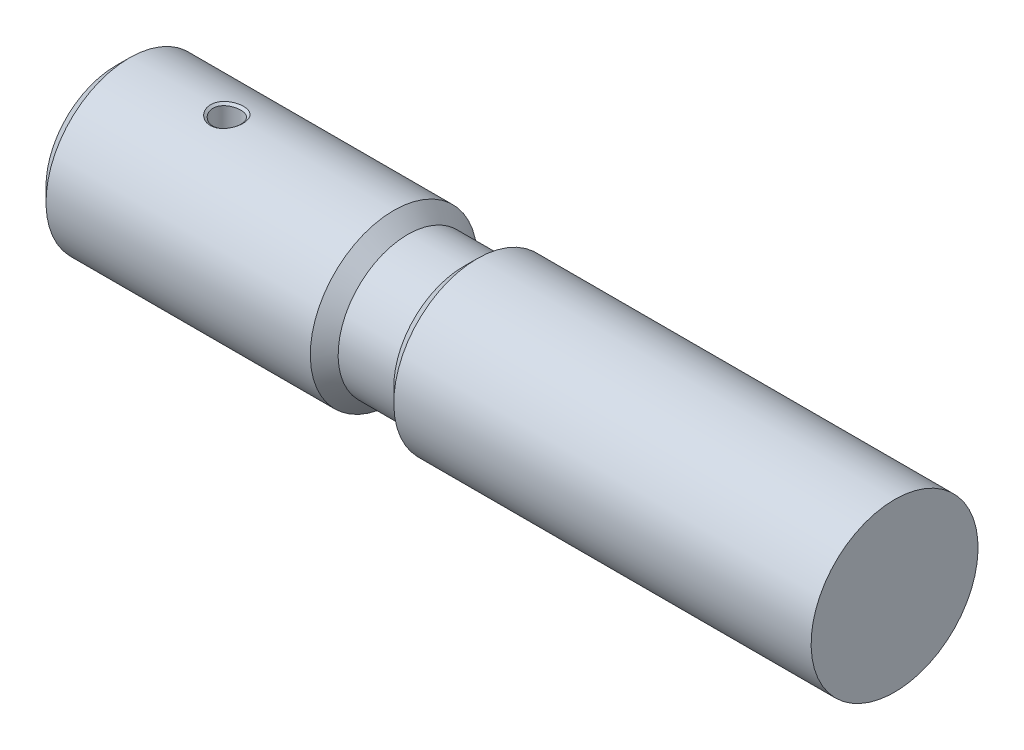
ISO-10303-21;
HEADER;
FILE_DESCRIPTION(('STEP AP214'),'2;1');
FILE_NAME('part.step','',(''),(''),'','','');
FILE_SCHEMA(('AUTOMOTIVE_DESIGN { 1 0 10303 214 1 1 1 1 }'));
ENDSEC;
DATA;
#1=APPLICATION_CONTEXT('core data for automotive mechanical design processes');
#2=APPLICATION_PROTOCOL_DEFINITION('international standard','automotive_design',2000,#1);
#3=PRODUCT_CONTEXT('',#1,'mechanical');
#4=PRODUCT('Part','Part','',(#3));
#5=PRODUCT_RELATED_PRODUCT_CATEGORY('part','',(#4));
#6=PRODUCT_DEFINITION_FORMATION('','',#4);
#7=PRODUCT_DEFINITION_CONTEXT('part definition',#1,'design');
#8=PRODUCT_DEFINITION('design','',#6,#7);
#9=PRODUCT_DEFINITION_SHAPE('','',#8);
#10=(LENGTH_UNIT() NAMED_UNIT(*) SI_UNIT(.MILLI.,.METRE.));
#11=(NAMED_UNIT(*) PLANE_ANGLE_UNIT() SI_UNIT($,.RADIAN.));
#12=(NAMED_UNIT(*) SI_UNIT($,.STERADIAN.) SOLID_ANGLE_UNIT());
#13=UNCERTAINTY_MEASURE_WITH_UNIT(LENGTH_MEASURE(1.E-05),#10,'distance_accuracy_value','');
#14=(GEOMETRIC_REPRESENTATION_CONTEXT(3) GLOBAL_UNCERTAINTY_ASSIGNED_CONTEXT((#13)) GLOBAL_UNIT_ASSIGNED_CONTEXT((#10,
#11,#12)) REPRESENTATION_CONTEXT('',''));
#15=CARTESIAN_POINT('',(0.,0.,0.));
#16=DIRECTION('',(0.,0.,1.));
#17=DIRECTION('',(1.,0.,0.));
#18=AXIS2_PLACEMENT_3D('',#15,#16,#17);
#19=CARTESIAN_POINT('',(0.,0.,0.));
#20=DIRECTION('',(-1.,0.,0.));
#21=DIRECTION('',(0.,-1.,0.));
#22=AXIS2_PLACEMENT_3D('',#19,#20,#21);
#23=PLANE('',#22);
#24=CARTESIAN_POINT('',(0.,0.,0.));
#25=DIRECTION('',(-1.,0.,0.));
#26=DIRECTION('',(0.,-1.,0.));
#27=AXIS2_PLACEMENT_3D('',#24,#25,#26);
#28=CIRCLE('',#27,1.5);
#29=CARTESIAN_POINT('',(0.,-1.5,0.));
#30=VERTEX_POINT('',#29);
#31=EDGE_CURVE('E189',#30,#30,#28,.T.);
#32=ORIENTED_EDGE('',*,*,#31,.F.);
#33=EDGE_LOOP('',(#32));
#34=FACE_BOUND('',#33,.T.);
#35=CARTESIAN_POINT('',(0.,0.,0.));
#36=DIRECTION('',(1.,0.,0.));
#37=DIRECTION('',(0.,1.,0.));
#38=AXIS2_PLACEMENT_3D('',#35,#36,#37);
#39=CIRCLE('',#38,2.49999999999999);
#40=CARTESIAN_POINT('',(0.,2.49999999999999,0.));
#41=VERTEX_POINT('',#40);
#42=EDGE_CURVE('E57',#41,#41,#39,.T.);
#43=ORIENTED_EDGE('',*,*,#42,.F.);
#44=EDGE_LOOP('',(#43));
#45=FACE_BOUND('',#44,.T.);
#46=ADVANCED_FACE('F30',(#34,#45),#23,.T.);
#47=CARTESIAN_POINT('',(0.499999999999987,0.,0.));
#48=DIRECTION('',(1.,0.,0.));
#49=DIRECTION('',(0.,1.,0.));
#50=AXIS2_PLACEMENT_3D('',#47,#48,#49);
#51=CONICAL_SURFACE('',#50,2.99999999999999,0.785398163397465);
#52=ORIENTED_EDGE('',*,*,#42,.T.);
#53=EDGE_LOOP('',(#52));
#54=FACE_BOUND('',#53,.T.);
#55=CARTESIAN_POINT('',(0.499999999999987,0.,0.));
#56=DIRECTION('',(1.,0.,0.));
#57=DIRECTION('',(0.,1.,0.));
#58=AXIS2_PLACEMENT_3D('',#55,#56,#57);
#59=CIRCLE('',#58,2.99999999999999);
#60=CARTESIAN_POINT('',(0.499999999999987,2.99999999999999,0.));
#61=VERTEX_POINT('',#60);
#62=EDGE_CURVE('E62',#61,#61,#59,.T.);
#63=ORIENTED_EDGE('',*,*,#62,.F.);
#64=EDGE_LOOP('',(#63));
#65=FACE_BOUND('',#64,.T.);
#66=ADVANCED_FACE('F119',(#54,#65),#51,.T.);
#67=CARTESIAN_POINT('',(28.,0.,0.));
#68=DIRECTION('',(1.,0.,0.));
#69=DIRECTION('',(0.,1.,0.));
#70=AXIS2_PLACEMENT_3D('',#67,#68,#69);
#71=CYLINDRICAL_SURFACE('',#70,3.00000000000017);
#72=CARTESIAN_POINT('',(3.41721610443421,3.00000000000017,0.));
#73=CARTESIAN_POINT('',(3.41721607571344,3.00000000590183,0.0197631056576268));
#74=CARTESIAN_POINT('',(3.41817401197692,2.99980445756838,0.0393822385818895));
#75=CARTESIAN_POINT('',(3.42193284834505,2.9990424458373,0.0782435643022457));
#76=CARTESIAN_POINT('',(3.42473401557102,2.99847593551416,0.0975039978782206));
#77=CARTESIAN_POINT('',(3.43216259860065,2.99699094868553,0.135684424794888));
#78=CARTESIAN_POINT('',(3.43679528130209,2.99607143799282,0.15461510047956));
#79=CARTESIAN_POINT('',(3.4479019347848,2.99390308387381,0.192091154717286));
#80=CARTESIAN_POINT('',(3.45443805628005,2.99264270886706,0.210760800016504));
#81=CARTESIAN_POINT('',(3.46908505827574,2.98987950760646,0.2468721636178));
#82=CARTESIAN_POINT('',(3.4772346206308,2.98836893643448,0.264474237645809));
#83=CARTESIAN_POINT('',(3.4951282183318,2.98514146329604,0.298707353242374));
#84=CARTESIAN_POINT('',(3.50487649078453,2.98342362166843,0.315354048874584));
#85=CARTESIAN_POINT('',(3.52598372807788,2.97982703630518,0.347700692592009));
#86=CARTESIAN_POINT('',(3.53735752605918,2.97794580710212,0.3634194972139));
#87=CARTESIAN_POINT('',(3.56172369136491,2.97407882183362,0.393814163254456));
#88=CARTESIAN_POINT('',(3.57451894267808,2.9721245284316,0.408250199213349));
#89=CARTESIAN_POINT('',(3.60135384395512,2.96822117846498,0.435724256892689));
#90=CARTESIAN_POINT('',(3.61538395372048,2.96627354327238,0.448750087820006));
#91=CARTESIAN_POINT('',(3.64466897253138,2.96244141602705,0.473388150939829));
#92=CARTESIAN_POINT('',(3.6599254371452,2.96055679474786,0.485000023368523));
#93=CARTESIAN_POINT('',(3.68375105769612,2.95781934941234,0.501333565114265));
#94=CARTESIAN_POINT('',(3.69187240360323,2.95691974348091,0.506608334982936));
#95=CARTESIAN_POINT('',(3.70832092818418,2.9551701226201,0.516716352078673));
#96=CARTESIAN_POINT('',(3.71663688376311,2.95432103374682,0.521545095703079));
#97=CARTESIAN_POINT('',(3.74183730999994,2.95186151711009,0.535350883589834));
#98=CARTESIAN_POINT('',(3.75902108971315,2.95033305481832,0.543684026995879));
#99=CARTESIAN_POINT('',(3.79409036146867,2.94754703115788,0.558591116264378));
#100=CARTESIAN_POINT('',(3.81199636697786,2.94628779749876,0.565174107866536));
#101=CARTESIAN_POINT('',(3.8393751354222,2.9446329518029,0.573711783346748));
#102=CARTESIAN_POINT('',(3.84860531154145,2.94411969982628,0.576337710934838));
#103=CARTESIAN_POINT('',(3.86723883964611,2.94317663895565,0.58113445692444));
#104=CARTESIAN_POINT('',(3.87666263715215,2.94274632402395,0.583307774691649));
#105=CARTESIAN_POINT('',(3.9049135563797,2.94159983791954,0.589071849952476));
#106=CARTESIAN_POINT('',(3.92379677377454,2.94102230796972,0.591938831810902));
#107=CARTESIAN_POINT('',(3.96168495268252,2.940248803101,0.595769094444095));
#108=CARTESIAN_POINT('',(3.98068559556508,2.94005276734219,0.596732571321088));
#109=CARTESIAN_POINT('',(4.00927172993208,2.94005014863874,0.596745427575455));
#110=CARTESIAN_POINT('',(4.01881465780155,2.94009784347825,0.596510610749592));
#111=CARTESIAN_POINT('',(4.03792930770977,2.94029123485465,0.595556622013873));
#112=CARTESIAN_POINT('',(4.04749498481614,2.94043682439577,0.594838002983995));
#113=CARTESIAN_POINT('',(4.06667987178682,2.94082728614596,0.592904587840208));
#114=CARTESIAN_POINT('',(4.07625240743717,2.94107155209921,0.591692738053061));
#115=CARTESIAN_POINT('',(4.09521487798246,2.94165111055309,0.588804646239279));
#116=CARTESIAN_POINT('',(4.10463483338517,2.94198699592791,0.587125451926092));
#117=CARTESIAN_POINT('',(4.13268026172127,2.94312615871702,0.581397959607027));
#118=CARTESIAN_POINT('',(4.15111556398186,2.9440614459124,0.576658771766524));
#119=CARTESIAN_POINT('',(4.187457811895,2.94625163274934,0.565362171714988));
#120=CARTESIAN_POINT('',(4.20538169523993,2.94750819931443,0.558795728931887));
#121=CARTESIAN_POINT('',(4.24063917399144,2.95030302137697,0.543847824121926));
#122=CARTESIAN_POINT('',(4.25812224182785,2.95185701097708,0.535376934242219));
#123=CARTESIAN_POINT('',(4.29180216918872,2.95514522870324,0.51691795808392));
#124=CARTESIAN_POINT('',(4.30810182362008,2.95688537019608,0.506900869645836));
#125=CARTESIAN_POINT('',(4.33961051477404,2.96050144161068,0.48533565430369));
#126=CARTESIAN_POINT('',(4.35482633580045,2.96237781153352,0.47378611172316));
#127=CARTESIAN_POINT('',(4.38417980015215,2.96621409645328,0.44914291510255));
#128=CARTESIAN_POINT('',(4.39831631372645,2.96817392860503,0.436050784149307));
#129=CARTESIAN_POINT('',(4.42548251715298,2.97212402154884,0.408259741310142));
#130=CARTESIAN_POINT('',(4.43828744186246,2.97408114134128,0.393790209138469));
#131=CARTESIAN_POINT('',(4.46238820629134,2.97790490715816,0.363746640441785));
#132=CARTESIAN_POINT('',(4.47368529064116,2.97977187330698,0.348170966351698));
#133=CARTESIAN_POINT('',(4.49478223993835,2.98336427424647,0.315912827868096));
#134=CARTESIAN_POINT('',(4.50458309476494,2.98509005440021,0.299225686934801));
#135=CARTESIAN_POINT('',(4.5181319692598,2.98753288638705,0.273355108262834));
#136=CARTESIAN_POINT('',(4.52246345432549,2.98832430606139,0.264570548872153));
#137=CARTESIAN_POINT('',(4.53070110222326,2.9898458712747,0.246781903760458));
#138=CARTESIAN_POINT('',(4.53458768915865,2.99057232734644,0.237823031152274));
#139=CARTESIAN_POINT('',(4.54556028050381,2.99264250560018,0.210753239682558));
#140=CARTESIAN_POINT('',(4.55198599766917,2.99388151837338,0.192408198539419));
#141=CARTESIAN_POINT('',(4.56305134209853,2.99604118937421,0.155192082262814));
#142=CARTESIAN_POINT('',(4.56769739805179,2.99696309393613,0.136305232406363));
#143=CARTESIAN_POINT('',(4.57331612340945,2.99808609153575,0.107572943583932));
#144=CARTESIAN_POINT('',(4.574964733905,2.99841734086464,0.0979165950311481));
#145=CARTESIAN_POINT('',(4.57780140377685,2.99898900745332,0.078483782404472));
#146=CARTESIAN_POINT('',(4.57899262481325,2.99923006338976,0.0686716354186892));
#147=CARTESIAN_POINT('',(4.5818432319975,2.99980795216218,0.0392114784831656));
#148=CARTESIAN_POINT('',(4.58278372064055,2.99999996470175,0.0196129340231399));
#149=CARTESIAN_POINT('',(4.5827840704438,3.00000003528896,-0.019602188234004));
#150=CARTESIAN_POINT('',(4.58184162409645,2.99980763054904,-0.0392018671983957));
#151=CARTESIAN_POINT('',(4.57900181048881,2.99923192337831,-0.0685897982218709));
#152=CARTESIAN_POINT('',(4.57781184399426,2.99899111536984,-0.0784062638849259));
#153=CARTESIAN_POINT('',(4.57496851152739,2.99841809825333,-0.0978966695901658));
#154=CARTESIAN_POINT('',(4.57331765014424,2.99808639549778,-0.107567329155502));
#155=CARTESIAN_POINT('',(4.56769168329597,2.99696195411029,-0.136330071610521));
#156=CARTESIAN_POINT('',(4.56304081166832,2.99603911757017,-0.155231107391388));
#157=CARTESIAN_POINT('',(4.55197806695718,2.99387998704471,-0.192431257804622));
#158=CARTESIAN_POINT('',(4.54556177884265,2.99264279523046,-0.210747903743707));
#159=CARTESIAN_POINT('',(4.53461139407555,2.99057679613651,-0.237765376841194));
#160=CARTESIAN_POINT('',(4.53073261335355,2.98985177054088,-0.246708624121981));
#161=CARTESIAN_POINT('',(4.52253364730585,2.98833719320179,-0.264424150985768));
#162=CARTESIAN_POINT('',(4.51819017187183,2.98754346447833,-0.273239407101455));
#163=CARTESIAN_POINT('',(4.50913557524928,2.98591077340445,-0.29053755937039));
#164=CARTESIAN_POINT('',(4.50441729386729,2.98507041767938,-0.299040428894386));
#165=CARTESIAN_POINT('',(4.49460719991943,2.98334875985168,-0.315754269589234));
#166=CARTESIAN_POINT('',(4.48951514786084,2.98246740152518,-0.323966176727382));
#167=CARTESIAN_POINT('',(4.47368436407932,2.97977169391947,-0.348172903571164));
#168=CARTESIAN_POINT('',(4.46239221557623,2.97790564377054,-0.363739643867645));
#169=CARTESIAN_POINT('',(4.43833150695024,2.97408803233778,-0.393737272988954));
#170=CARTESIAN_POINT('',(4.42556979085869,2.97213742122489,-0.408160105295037));
#171=CARTESIAN_POINT('',(4.40526628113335,2.9691841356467,-0.428946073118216));
#172=CARTESIAN_POINT('',(4.39829831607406,2.96819463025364,-0.435734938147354));
#173=CARTESIAN_POINT('',(4.38412760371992,2.96623578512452,-0.448875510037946));
#174=CARTESIAN_POINT('',(4.37690043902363,2.96526281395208,-0.455253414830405));
#175=CARTESIAN_POINT('',(4.35484841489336,2.96238054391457,-0.473769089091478));
#176=CARTESIAN_POINT('',(4.33960873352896,2.9605012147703,-0.485337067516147));
#177=CARTESIAN_POINT('',(4.30809522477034,2.95688463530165,-0.506905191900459));
#178=CARTESIAN_POINT('',(4.29180418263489,2.95514552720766,-0.51691598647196));
#179=CARTESIAN_POINT('',(4.26659961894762,2.95268461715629,-0.530731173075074));
#180=CARTESIAN_POINT('',(4.25805726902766,2.95188805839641,-0.535140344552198));
#181=CARTESIAN_POINT('',(4.24069204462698,2.95034949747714,-0.543558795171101));
#182=CARTESIAN_POINT('',(4.23189441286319,2.94961004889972,-0.547553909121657));
#183=CARTESIAN_POINT('',(4.20536991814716,2.94750683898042,-0.558803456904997));
#184=CARTESIAN_POINT('',(4.18742795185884,2.94624951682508,-0.565373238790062));
#185=CARTESIAN_POINT('',(4.15104715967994,2.94405764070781,-0.576678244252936));
#186=CARTESIAN_POINT('',(4.13260622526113,2.94312263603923,-0.581415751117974));
#187=CARTESIAN_POINT('',(4.09521811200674,2.9416050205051,-0.589045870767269));
#188=CARTESIAN_POINT('',(4.07626616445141,2.94102224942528,-0.591939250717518));
#189=CARTESIAN_POINT('',(4.0378545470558,2.94024075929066,-0.595808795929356));
#190=CARTESIAN_POINT('',(4.01872636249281,2.94004872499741,-0.596752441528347));
#191=CARTESIAN_POINT('',(3.98059512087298,2.94005333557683,-0.596729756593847));
#192=CARTESIAN_POINT('',(3.96159630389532,2.94025009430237,-0.595762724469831));
#193=CARTESIAN_POINT('',(3.9237313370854,2.94102416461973,-0.591929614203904));
#194=CARTESIAN_POINT('',(3.90486133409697,2.9416019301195,-0.589061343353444));
#195=CARTESIAN_POINT('',(3.87666946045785,2.94274606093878,-0.583309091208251));
#196=CARTESIAN_POINT('',(3.86726910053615,2.94317516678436,-0.581141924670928));
#197=CARTESIAN_POINT('',(3.84858953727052,2.9441204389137,-0.57633397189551));
#198=CARTESIAN_POINT('',(3.83935390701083,2.94463410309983,-0.573705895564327));
#199=CARTESIAN_POINT('',(3.81195437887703,2.94629059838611,-0.565159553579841));
#200=CARTESIAN_POINT('',(3.79404671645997,2.94755031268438,-0.55857373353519));
#201=CARTESIAN_POINT('',(3.75900453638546,2.95033455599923,-0.543675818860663));
#202=CARTESIAN_POINT('',(3.74185477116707,2.95185996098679,-0.535359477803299));
#203=CARTESIAN_POINT('',(3.7167022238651,2.9543145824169,-0.521581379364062));
#204=CARTESIAN_POINT('',(3.7084061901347,2.95516139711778,-0.516766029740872));
#205=CARTESIAN_POINT('',(3.69201989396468,2.95690371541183,-0.506701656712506));
#206=CARTESIAN_POINT('',(3.68389809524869,2.9578028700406,-0.501430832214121));
#207=CARTESIAN_POINT('',(3.66795530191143,2.9596337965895,-0.490508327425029));
#208=CARTESIAN_POINT('',(3.66015429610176,2.96056294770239,-0.484872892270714));
#209=CARTESIAN_POINT('',(3.64486466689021,2.96244392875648,-0.473244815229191));
#210=CARTESIAN_POINT('',(3.63737962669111,2.96339533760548,-0.4672547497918));
#211=CARTESIAN_POINT('',(3.61539699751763,2.96627170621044,-0.448762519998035));
#212=CARTESIAN_POINT('',(3.60137088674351,2.96821885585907,-0.435739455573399));
#213=CARTESIAN_POINT('',(3.57456910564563,2.97211707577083,-0.408303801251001));
#214=CARTESIAN_POINT('',(3.56179632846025,2.97406788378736,-0.393893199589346));
#215=CARTESIAN_POINT('',(3.54358879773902,2.97695659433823,-0.37119818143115));
#216=CARTESIAN_POINT('',(3.53766803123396,2.97791511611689,-0.363434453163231));
#217=CARTESIAN_POINT('',(3.52625957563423,2.97979453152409,-0.347688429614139));
#218=CARTESIAN_POINT('',(3.52075992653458,2.98071718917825,-0.339693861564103));
#219=CARTESIAN_POINT('',(3.50489914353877,2.98341968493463,-0.315391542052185));
#220=CARTESIAN_POINT('',(3.49513171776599,2.98514083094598,-0.298714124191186));
#221=CARTESIAN_POINT('',(3.47722994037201,2.98836978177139,-0.264465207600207));
#222=CARTESIAN_POINT('',(3.46908536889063,2.98987945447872,-0.24687355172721));
#223=CARTESIAN_POINT('',(3.45811405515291,2.99194921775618,-0.219823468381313));
#224=CARTESIAN_POINT('',(3.45466075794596,2.99260749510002,-0.210680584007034));
#225=CARTESIAN_POINT('',(3.44817466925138,2.9938538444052,-0.192160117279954));
#226=CARTESIAN_POINT('',(3.44514492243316,2.99444135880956,-0.182784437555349));
#227=CARTESIAN_POINT('',(3.43679027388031,2.99607237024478,-0.154606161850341));
#228=CARTESIAN_POINT('',(3.43215641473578,2.99699217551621,-0.135659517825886));
#229=CARTESIAN_POINT('',(3.42472443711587,2.99847785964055,-0.097447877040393));
#230=CARTESIAN_POINT('',(3.42192522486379,2.99904398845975,-0.0781833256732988));
#231=CARTESIAN_POINT('',(3.41817118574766,2.99980503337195,-0.0393343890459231));
#232=CARTESIAN_POINT('',(3.41721613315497,2.9999999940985,-0.0197631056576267));
#233=CARTESIAN_POINT('',(3.41721610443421,3.00000000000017,0.));
#234=B_SPLINE_CURVE_WITH_KNOTS('',3,(#72,#73,#74,#75,#76,#77,#78,#79,#80,#81,#82,#83,#84,#85,
#86,#87,#88,#89,#90,#91,#92,#93,#94,#95,#96,#97,#98,#99,#100,#101,#102,#103,#104,#105,#106,#107,
#108,#109,#110,#111,#112,#113,#114,#115,#116,#117,#118,#119,#120,#121,#122,#123,#124,#125,#126,
#127,#128,#129,#130,#131,#132,#133,#134,#135,#136,#137,#138,#139,#140,#141,#142,#143,#144,#145,
#146,#147,#148,#149,#150,#151,#152,#153,#154,#155,#156,#157,#158,#159,#160,#161,#162,#163,#164,
#165,#166,#167,#168,#169,#170,#171,#172,#173,#174,#175,#176,#177,#178,#179,#180,#181,#182,#183,
#184,#185,#186,#187,#188,#189,#190,#191,#192,#193,#194,#195,#196,#197,#198,#199,#200,#201,#202,
#203,#204,#205,#206,#207,#208,#209,#210,#211,#212,#213,#214,#215,#216,#217,#218,#219,#220,#221,
#222,#223,#224,#225,#226,#227,#228,#229,#230,#231,#232,#233),.UNSPECIFIED.,.T.,.F.,(4,2,2,2,2,2,
2,2,2,2,2,2,2,2,2,2,2,2,2,2,2,2,2,2,2,2,2,2,2,2,2,2,2,2,2,2,2,2,2,2,2,2,2,2,2,2,2,2,2,2,2,2,2,2,
2,2,2,2,2,2,2,2,2,2,2,2,2,2,2,2,2,2,2,2,2,2,2,2,2,2,4),(-0.00365073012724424,
-0.00359364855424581,-0.00353656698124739,-0.00347948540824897,-0.00342240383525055,
-0.00336532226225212,-0.0033082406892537,-0.00325115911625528,-0.00319407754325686,
-0.00313699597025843,-0.00307991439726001,-0.0030513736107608,-0.00302283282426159,
-0.00296575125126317,-0.00290866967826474,-0.00288012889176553,-0.00285158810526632,
-0.0027945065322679,-0.00273742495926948,-0.00270888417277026,-0.00268034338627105,
-0.00265180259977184,-0.00262326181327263,-0.00256618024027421,-0.00250909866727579,
-0.00245201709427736,-0.00239493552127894,-0.00233785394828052,-0.00228077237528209,
-0.00222369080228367,-0.00216660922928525,-0.00210952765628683,-0.00208098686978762,
-0.0020524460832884,-0.00199536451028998,-0.00193828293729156,-0.00190974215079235,
-0.00188120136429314,-0.00182411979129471,-0.00176703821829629,-0.00173849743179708,
-0.00170995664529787,-0.00165287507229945,-0.00159579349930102,-0.00156725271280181,
-0.0015387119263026,-0.00151017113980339,-0.00148163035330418,-0.00142454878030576,
-0.00136746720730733,-0.00133892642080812,-0.00131038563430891,-0.00125330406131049,
-0.00119622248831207,-0.00116768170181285,-0.00113914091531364,-0.00108205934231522,
-0.0010249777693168,-0.000967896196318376,-0.000910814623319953,-0.000853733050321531,
-0.000796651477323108,-0.000768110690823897,-0.000739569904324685,-0.000682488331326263,
-0.00062540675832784,-0.000596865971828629,-0.000568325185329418,-0.000539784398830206,
-0.000511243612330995,-0.000454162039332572,-0.00039708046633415,-0.000368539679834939,
-0.000339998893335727,-0.000282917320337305,-0.000225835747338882,-0.000197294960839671,
-0.00016875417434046,-0.000111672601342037,-5.45910283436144E-05,2.49054465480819E-06),.UNSPECIFIED.);
#235=CARTESIAN_POINT('',(3.41721610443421,3.00000000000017,0.));
#236=VERTEX_POINT('',#235);
#237=EDGE_CURVE('E42',#236,#236,#234,.F.);
#238=ORIENTED_EDGE('',*,*,#237,.T.);
#239=EDGE_LOOP('',(#238));
#240=FACE_BOUND('',#239,.T.);
#241=CARTESIAN_POINT('',(4.,-2.94005100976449,0.596741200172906));
#242=CARTESIAN_POINT('',(3.98069730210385,-2.94005101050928,0.596741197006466));
#243=CARTESIAN_POINT('',(3.96157194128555,-2.9402501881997,0.595762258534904));
#244=CARTESIAN_POINT('',(3.92363531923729,-2.94102653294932,0.591917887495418));
#245=CARTESIAN_POINT('',(3.90482879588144,-2.9416037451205,0.589052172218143));
#246=CARTESIAN_POINT('',(3.86753629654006,-2.94311622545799,0.581448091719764));
#247=CARTESIAN_POINT('',(3.84904606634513,-2.94405205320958,0.576706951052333));
#248=CARTESIAN_POINT('',(3.8215683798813,-2.94570749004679,0.568168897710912));
#249=CARTESIAN_POINT('',(3.81243276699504,-2.94630293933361,0.565075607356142));
#250=CARTESIAN_POINT('',(3.79431326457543,-2.94757054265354,0.558425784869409));
#251=CARTESIAN_POINT('',(3.78537901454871,-2.9482389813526,0.554888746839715));
#252=CARTESIAN_POINT('',(3.7589441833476,-2.95033938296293,0.543650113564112));
#253=CARTESIAN_POINT('',(3.7417636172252,-2.95186859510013,0.535311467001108));
#254=CARTESIAN_POINT('',(3.70833518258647,-2.95513137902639,0.516996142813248));
#255=CARTESIAN_POINT('',(3.69207345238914,-2.956865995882,0.507014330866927));
#256=CARTESIAN_POINT('',(3.66837173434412,-2.95958499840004,0.490802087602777));
#257=CARTESIAN_POINT('',(3.66058087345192,-2.9605115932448,0.485186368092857));
#258=CARTESIAN_POINT('',(3.64524264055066,-2.96239636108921,0.473542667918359));
#259=CARTESIAN_POINT('',(3.63766944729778,-2.96335793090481,0.467492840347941));
#260=CARTESIAN_POINT('',(3.62284540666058,-2.96529660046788,0.455033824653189));
#261=CARTESIAN_POINT('',(3.61562002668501,-2.96627011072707,0.448648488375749));
#262=CARTESIAN_POINT('',(3.60151172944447,-2.96822146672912,0.43555155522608));
#263=CARTESIAN_POINT('',(3.594632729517,-2.96919879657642,0.428843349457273));
#264=CARTESIAN_POINT('',(3.57451406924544,-2.97212528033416,0.408244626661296));
#265=CARTESIAN_POINT('',(3.56179162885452,-2.97406898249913,0.393881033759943));
#266=CARTESIAN_POINT('',(3.53772064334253,-2.97788725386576,0.363890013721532));
#267=CARTESIAN_POINT('',(3.52637504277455,-2.97976149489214,0.348265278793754));
#268=CARTESIAN_POINT('',(3.51040462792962,-2.98248110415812,0.323842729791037));
#269=CARTESIAN_POINT('',(3.50524785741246,-2.9833739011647,0.315518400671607));
#270=CARTESIAN_POINT('',(3.49538783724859,-2.9851049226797,0.298696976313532));
#271=CARTESIAN_POINT('',(3.49067273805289,-2.98594506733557,0.29018463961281));
#272=CARTESIAN_POINT('',(3.47719357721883,-2.98837640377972,0.264393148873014));
#273=CARTESIAN_POINT('',(3.46905600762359,-2.98988498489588,0.246803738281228));
#274=CARTESIAN_POINT('',(3.45449344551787,-2.99263226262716,0.210894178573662));
#275=CARTESIAN_POINT('',(3.4480602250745,-2.99387253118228,0.192552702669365));
#276=CARTESIAN_POINT('',(3.43971572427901,-2.99550111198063,0.164504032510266));
#277=CARTESIAN_POINT('',(3.43714965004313,-2.99600583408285,0.155049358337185));
#278=CARTESIAN_POINT('',(3.43245858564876,-2.99693355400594,0.135944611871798));
#279=CARTESIAN_POINT('',(3.43033802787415,-2.99735568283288,0.126303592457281));
#280=CARTESIAN_POINT('',(3.4247136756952,-2.99848000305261,0.0974056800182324));
#281=CARTESIAN_POINT('',(3.42191222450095,-2.99904662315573,0.0780745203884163));
#282=CARTESIAN_POINT('',(3.41816906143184,-2.99980546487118,0.0392865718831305));
#283=CARTESIAN_POINT('',(3.41722600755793,-2.99999798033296,0.0198292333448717));
#284=CARTESIAN_POINT('',(3.41720635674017,-3.00000198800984,-0.0192128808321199));
#285=CARTESIAN_POINT('',(3.41812824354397,-2.9998137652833,-0.0387841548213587));
#286=CARTESIAN_POINT('',(3.42190830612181,-2.99904739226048,-0.0781124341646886));
#287=CARTESIAN_POINT('',(3.42473738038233,-2.99847524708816,-0.0975349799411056));
#288=CARTESIAN_POINT('',(3.43219011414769,-2.9969854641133,-0.135812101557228));
#289=CARTESIAN_POINT('',(3.43681588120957,-2.99606738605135,-0.154685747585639));
#290=CARTESIAN_POINT('',(3.44784738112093,-2.99391376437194,-0.191905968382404));
#291=CARTESIAN_POINT('',(3.45426005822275,-2.99267691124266,-0.210264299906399));
#292=CARTESIAN_POINT('',(3.46887187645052,-2.98991911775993,-0.246402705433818));
#293=CARTESIAN_POINT('',(3.47714856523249,-2.98838448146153,-0.264310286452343));
#294=CARTESIAN_POINT('',(3.49515791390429,-2.98513608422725,-0.298763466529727));
#295=CARTESIAN_POINT('',(3.50493902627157,-2.98341282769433,-0.315454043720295));
#296=CARTESIAN_POINT('',(3.52599610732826,-2.97982506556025,-0.34771548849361));
#297=CARTESIAN_POINT('',(3.53727681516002,-2.97795952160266,-0.363299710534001));
#298=CARTESIAN_POINT('',(3.56135174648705,-2.97413696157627,-0.393368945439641));
#299=CARTESIAN_POINT('',(3.57415958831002,-2.97217782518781,-0.407868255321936));
#300=CARTESIAN_POINT('',(3.60129805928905,-2.96822828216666,-0.435680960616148));
#301=CARTESIAN_POINT('',(3.61540855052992,-2.96627009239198,-0.448773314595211));
#302=CARTESIAN_POINT('',(3.64473666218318,-2.96243279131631,-0.473442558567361));
#303=CARTESIAN_POINT('',(3.65994493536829,-2.96055495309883,-0.485009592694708));
#304=CARTESIAN_POINT('',(3.691450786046,-2.95693429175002,-0.506615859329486));
#305=CARTESIAN_POINT('',(3.7077503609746,-2.95519136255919,-0.516654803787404));
#306=CARTESIAN_POINT('',(3.73303553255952,-2.95271910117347,-0.530539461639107));
#307=CARTESIAN_POINT('',(3.74162718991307,-2.95191697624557,-0.534980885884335));
#308=CARTESIAN_POINT('',(3.75897894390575,-2.95037772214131,-0.543405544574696));
#309=CARTESIAN_POINT('',(3.76772317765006,-2.94964170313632,-0.547383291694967));
#310=CARTESIAN_POINT('',(3.79414120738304,-2.9475430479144,-0.558612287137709));
#311=CARTESIAN_POINT('',(3.81204985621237,-2.94628452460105,-0.565190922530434));
#312=CARTESIAN_POINT('',(3.84839069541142,-2.94408806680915,-0.576523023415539));
#313=CARTESIAN_POINT('',(3.86684091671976,-2.94314883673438,-0.581283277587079));
#314=CARTESIAN_POINT('',(3.89491028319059,-2.94200391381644,-0.587040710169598));
#315=CARTESIAN_POINT('',(3.90434708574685,-2.94166598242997,-0.588730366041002));
#316=CARTESIAN_POINT('',(3.92334096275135,-2.94108255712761,-0.591638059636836));
#317=CARTESIAN_POINT('',(3.93293134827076,-2.94083653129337,-0.592858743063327));
#318=CARTESIAN_POINT('',(3.96167627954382,-2.94024758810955,-0.595775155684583));
#319=CARTESIAN_POINT('',(3.980817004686,-2.94005124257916,-0.596740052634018));
#320=CARTESIAN_POINT('',(4.01911488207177,-2.94005077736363,-0.596742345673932));
#321=CARTESIAN_POINT('',(4.03825660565,-2.94024680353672,-0.595779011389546));
#322=CARTESIAN_POINT('',(4.06698163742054,-2.94083445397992,-0.592869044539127));
#323=CARTESIAN_POINT('',(4.07657376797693,-2.94108020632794,-0.591649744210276));
#324=CARTESIAN_POINT('',(4.09558289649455,-2.94166356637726,-0.588742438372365));
#325=CARTESIAN_POINT('',(4.10502018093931,-2.94200096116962,-0.587055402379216));
#326=CARTESIAN_POINT('',(4.15182486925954,-2.9439106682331,-0.577452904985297));
#327=CARTESIAN_POINT('',(4.18815994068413,-2.94613914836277,-0.566121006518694));
#328=CARTESIAN_POINT('',(4.23217114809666,-2.94963278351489,-0.547431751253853));
#329=CARTESIAN_POINT('',(4.24090647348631,-2.95036798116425,-0.543458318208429));
#330=CARTESIAN_POINT('',(4.25822579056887,-2.95190351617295,-0.535055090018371));
#331=CARTESIAN_POINT('',(4.26682974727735,-2.95270631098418,-0.530610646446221));
#332=CARTESIAN_POINT('',(4.29215727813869,-2.95518158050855,-0.516711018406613));
#333=CARTESIAN_POINT('',(4.30846094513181,-2.95692461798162,-0.506672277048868));
#334=CARTESIAN_POINT('',(4.33997337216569,-2.9605450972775,-0.48506971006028));
#335=CARTESIAN_POINT('',(4.35517699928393,-2.96242198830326,-0.473509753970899));
#336=CARTESIAN_POINT('',(4.37715668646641,-2.96529708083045,-0.455029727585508));
#337=CARTESIAN_POINT('',(4.38434539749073,-2.9662654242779,-0.448679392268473));
#338=CARTESIAN_POINT('',(4.3984445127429,-2.96821531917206,-0.435593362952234));
#339=CARTESIAN_POINT('',(4.40535377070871,-2.96919672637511,-0.428858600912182));
#340=CARTESIAN_POINT('',(4.41889394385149,-2.97116650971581,-0.414992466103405));
#341=CARTESIAN_POINT('',(4.42552441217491,-2.97215504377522,-0.407857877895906));
#342=CARTESIAN_POINT('',(4.43834731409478,-2.97410830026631,-0.393361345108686));
#343=CARTESIAN_POINT('',(4.44457221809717,-2.97507771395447,-0.38596671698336));
#344=CARTESIAN_POINT('',(4.46265116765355,-2.97794777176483,-0.363396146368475));
#345=CARTESIAN_POINT('',(4.47394643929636,-2.97981546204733,-0.3477979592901));
#346=CARTESIAN_POINT('',(4.49501579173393,-2.98340494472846,-0.315528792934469));
#347=CARTESIAN_POINT('',(4.50479778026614,-2.98512821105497,-0.298842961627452));
#348=CARTESIAN_POINT('',(4.51830166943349,-2.98756376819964,-0.273016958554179));
#349=CARTESIAN_POINT('',(4.52261129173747,-2.98835141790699,-0.264264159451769));
#350=CARTESIAN_POINT('',(4.53084211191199,-2.98987211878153,-0.246464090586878));
#351=CARTESIAN_POINT('',(4.53473752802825,-2.99060041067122,-0.237470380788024));
#352=CARTESIAN_POINT('',(4.54571656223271,-2.992672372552,-0.210332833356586));
#353=CARTESIAN_POINT('',(4.55213304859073,-2.99390996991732,-0.191966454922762));
#354=CARTESIAN_POINT('',(4.56317573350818,-2.99606572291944,-0.154719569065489));
#355=CARTESIAN_POINT('',(4.56780533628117,-2.9969845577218,-0.135833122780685));
#356=CARTESIAN_POINT('',(4.57526275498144,-2.99847527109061,-0.0975366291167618));
#357=CARTESIAN_POINT('',(4.57809370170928,-2.99904779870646,-0.0780963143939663));
#358=CARTESIAN_POINT('',(4.58187219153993,-2.99981385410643,-0.0387748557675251));
#359=CARTESIAN_POINT('',(4.58279339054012,-3.00000193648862,-0.0192150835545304));
#360=CARTESIAN_POINT('',(4.58277425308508,-2.99999803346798,0.0198155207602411));
#361=CARTESIAN_POINT('',(4.58183200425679,-2.99980568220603,0.0392682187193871));
#362=CARTESIAN_POINT('',(4.57809093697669,-2.99904726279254,0.0780490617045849));
#363=CARTESIAN_POINT('',(4.57529073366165,-2.99848089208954,0.0973778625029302));
#364=CARTESIAN_POINT('',(4.5696683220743,-2.99735694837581,0.126273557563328));
#365=CARTESIAN_POINT('',(4.56754828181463,-2.99693491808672,0.135914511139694));
#366=CARTESIAN_POINT('',(4.56285846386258,-2.99600743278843,0.155018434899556));
#367=CARTESIAN_POINT('',(4.56029338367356,-2.99550289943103,0.16447136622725));
#368=CARTESIAN_POINT('',(4.55195328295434,-2.99387514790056,0.19251136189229));
#369=CARTESIAN_POINT('',(4.54552478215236,-2.99263576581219,0.21084331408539));
#370=CARTESIAN_POINT('',(4.53097784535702,-2.98989130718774,0.246726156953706));
#371=CARTESIAN_POINT('',(4.52285357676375,-2.98838506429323,0.264294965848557));
#372=CARTESIAN_POINT('',(4.5093934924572,-2.98595693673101,0.2900618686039));
#373=CARTESIAN_POINT('',(4.50468635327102,-2.98511809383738,0.298564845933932));
#374=CARTESIAN_POINT('',(4.49485008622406,-2.98339095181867,0.315356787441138));
#375=CARTESIAN_POINT('',(4.48969407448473,-2.98249809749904,0.323685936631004));
#376=CARTESIAN_POINT('',(4.47903984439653,-2.98068341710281,0.339990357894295));
#377=CARTESIAN_POINT('',(4.47353786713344,-2.97976081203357,0.347976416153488));
#378=CARTESIAN_POINT('',(4.46218826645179,-2.97789180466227,0.363624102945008));
#379=CARTESIAN_POINT('',(4.45634100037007,-2.97694544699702,0.371285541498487));
#380=CARTESIAN_POINT('',(4.43828734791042,-2.97408117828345,0.393789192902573));
#381=CARTESIAN_POINT('',(4.4255702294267,-2.972137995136,0.408151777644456));
#382=CARTESIAN_POINT('',(4.39877157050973,-2.96823892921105,0.435602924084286));
#383=CARTESIAN_POINT('',(4.38469743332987,-2.96628398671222,0.448684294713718));
#384=CARTESIAN_POINT('',(4.36250868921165,-2.96338076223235,0.467348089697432));
#385=CARTESIAN_POINT('',(4.35492566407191,-2.96241745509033,0.473410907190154));
#386=CARTESIAN_POINT('',(4.33956570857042,-2.96052920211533,0.485078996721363));
#387=CARTESIAN_POINT('',(4.33176226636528,-2.95960068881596,0.490707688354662));
#388=CARTESIAN_POINT('',(4.30803980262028,-2.95687836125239,0.506942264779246));
#389=CARTESIAN_POINT('',(4.29175989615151,-2.95514116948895,0.51694032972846));
#390=CARTESIAN_POINT('',(4.25831427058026,-2.95187568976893,0.535272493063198));
#391=CARTESIAN_POINT('',(4.24113024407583,-2.95034576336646,0.543615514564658));
#392=CARTESIAN_POINT('',(4.21470007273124,-2.94824503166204,0.554856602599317));
#393=CARTESIAN_POINT('',(4.20576824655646,-2.94757653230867,0.558394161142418));
#394=CARTESIAN_POINT('',(4.18765968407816,-2.94630912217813,0.565043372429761));
#395=CARTESIAN_POINT('',(4.17851672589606,-2.94571288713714,0.568140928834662));
#396=CARTESIAN_POINT('',(4.15102514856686,-2.94405581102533,0.576687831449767));
#397=CARTESIAN_POINT('',(4.13252801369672,-2.94311920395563,0.581433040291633));
#398=CARTESIAN_POINT('',(4.09521830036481,-2.94160528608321,0.589044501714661));
#399=CARTESIAN_POINT('',(4.07640275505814,-2.94102750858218,0.591913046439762));
#400=CARTESIAN_POINT('',(4.03844763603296,-2.94025039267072,0.595761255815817));
#401=CARTESIAN_POINT('',(4.01930269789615,-2.9400510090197,0.596741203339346));
#402=CARTESIAN_POINT('',(4.,-2.94005100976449,0.596741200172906));
#403=B_SPLINE_CURVE_WITH_KNOTS('',3,(#241,#242,#243,#244,#245,#246,#247,#248,#249,#250,#251,
#252,#253,#254,#255,#256,#257,#258,#259,#260,#261,#262,#263,#264,#265,#266,#267,#268,#269,#270,
#271,#272,#273,#274,#275,#276,#277,#278,#279,#280,#281,#282,#283,#284,#285,#286,#287,#288,#289,
#290,#291,#292,#293,#294,#295,#296,#297,#298,#299,#300,#301,#302,#303,#304,#305,#306,#307,#308,
#309,#310,#311,#312,#313,#314,#315,#316,#317,#318,#319,#320,#321,#322,#323,#324,#325,#326,#327,
#328,#329,#330,#331,#332,#333,#334,#335,#336,#337,#338,#339,#340,#341,#342,#343,#344,#345,#346,
#347,#348,#349,#350,#351,#352,#353,#354,#355,#356,#357,#358,#359,#360,#361,#362,#363,#364,#365,
#366,#367,#368,#369,#370,#371,#372,#373,#374,#375,#376,#377,#378,#379,#380,#381,#382,#383,#384,
#385,#386,#387,#388,#389,#390,#391,#392,#393,#394,#395,#396,#397,#398,#399,#400,#401,#402),
.UNSPECIFIED.,.T.,.F.,(4,2,2,2,2,2,2,2,2,2,2,2,2,2,2,2,2,2,2,2,2,2,2,2,2,2,2,2,2,2,2,2,2,2,2,2,
2,2,2,2,2,2,2,2,2,2,2,2,2,2,2,2,2,2,2,2,2,2,2,2,2,2,2,2,2,2,2,2,2,2,2,2,2,2,2,2,2,2,2,2,4),
(-9.24523769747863E-07,5.61578567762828E-05,0.000113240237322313,0.000170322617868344,
0.000198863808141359,0.000227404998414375,0.000284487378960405,0.000341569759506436,
0.000370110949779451,0.000398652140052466,0.000427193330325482,0.000455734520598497,
0.000512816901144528,0.000569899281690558,0.000598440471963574,0.000626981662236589,
0.00068406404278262,0.00074114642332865,0.000769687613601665,0.000798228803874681,
0.000855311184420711,0.000912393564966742,0.000969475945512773,0.0010265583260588,
0.00108364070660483,0.00114072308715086,0.0011978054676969,0.00125488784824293,
0.00131197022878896,0.00136905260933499,0.00142613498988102,0.00148321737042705,
0.00154029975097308,0.00156884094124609,0.00159738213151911,0.00165446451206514,
0.00171154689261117,0.00174008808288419,0.0017686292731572,0.00182571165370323,
0.00188279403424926,0.00191133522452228,0.00193987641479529,0.00205404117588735,
0.00208258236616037,0.00211112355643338,0.00216820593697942,0.00222528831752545,
0.00225382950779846,0.00228237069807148,0.00231091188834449,0.00233945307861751,
0.00239653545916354,0.00245361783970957,0.00248215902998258,0.0025107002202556,
0.00256778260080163,0.00262486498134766,0.00268194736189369,0.00273902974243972,
0.00279611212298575,0.00285319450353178,0.0028817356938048,0.00291027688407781,
0.00296735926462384,0.00302444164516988,0.00305298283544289,0.00308152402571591,
0.00311006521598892,0.00313860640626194,0.00319568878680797,0.003252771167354,
0.00328131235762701,0.00330985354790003,0.00336693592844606,0.00342401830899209,
0.0034525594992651,0.00348110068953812,0.00353818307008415,0.00359526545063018,
0.00365234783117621),.UNSPECIFIED.);
#404=CARTESIAN_POINT('',(4.,-2.94005100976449,0.596741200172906));
#405=VERTEX_POINT('',#404);
#406=EDGE_CURVE('E47',#405,#405,#403,.F.);
#407=ORIENTED_EDGE('',*,*,#406,.T.);
#408=EDGE_LOOP('',(#407));
#409=FACE_BOUND('',#408,.T.);
#410=ORIENTED_EDGE('',*,*,#62,.T.);
#411=EDGE_LOOP('',(#410));
#412=FACE_BOUND('',#411,.T.);
#413=CARTESIAN_POINT('',(10.,0.,0.));
#414=DIRECTION('',(1.,0.,0.));
#415=DIRECTION('',(0.,1.,0.));
#416=AXIS2_PLACEMENT_3D('',#413,#414,#415);
#417=CIRCLE('',#416,3.00000000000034);
#418=CARTESIAN_POINT('',(10.,3.00000000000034,0.));
#419=VERTEX_POINT('',#418);
#420=EDGE_CURVE('E67',#419,#419,#417,.T.);
#421=ORIENTED_EDGE('',*,*,#420,.F.);
#422=EDGE_LOOP('',(#421));
#423=FACE_BOUND('',#422,.T.);
#424=ADVANCED_FACE('F108',(#240,#409,#412,#423),#71,.T.);
#425=CARTESIAN_POINT('',(10.5,0.,0.));
#426=DIRECTION('',(-1.,0.,0.));
#427=DIRECTION('',(0.,-1.,0.));
#428=AXIS2_PLACEMENT_3D('',#425,#426,#427);
#429=CONICAL_SURFACE('',#428,2.49999999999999,0.785398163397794);
#430=ORIENTED_EDGE('',*,*,#420,.T.);
#431=EDGE_LOOP('',(#430));
#432=FACE_BOUND('',#431,.T.);
#433=CARTESIAN_POINT('',(10.5,0.,0.));
#434=DIRECTION('',(1.,0.,0.));
#435=DIRECTION('',(0.,1.,0.));
#436=AXIS2_PLACEMENT_3D('',#433,#434,#435);
#437=CIRCLE('',#436,2.49999999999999);
#438=CARTESIAN_POINT('',(10.5,2.49999999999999,0.));
#439=VERTEX_POINT('',#438);
#440=EDGE_CURVE('E206',#439,#439,#437,.T.);
#441=ORIENTED_EDGE('',*,*,#440,.F.);
#442=EDGE_LOOP('',(#441));
#443=FACE_BOUND('',#442,.T.);
#444=ADVANCED_FACE('F118',(#432,#443),#429,.T.);
#445=CARTESIAN_POINT('',(28.,0.,0.));
#446=DIRECTION('',(1.,0.,0.));
#447=DIRECTION('',(0.,1.,0.));
#448=AXIS2_PLACEMENT_3D('',#445,#446,#447);
#449=CYLINDRICAL_SURFACE('',#448,2.49999999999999);
#450=ORIENTED_EDGE('',*,*,#440,.T.);
#451=EDGE_LOOP('',(#450));
#452=FACE_BOUND('',#451,.T.);
#453=CARTESIAN_POINT('',(12.5,0.,0.));
#454=DIRECTION('',(1.,0.,0.));
#455=DIRECTION('',(0.,1.,0.));
#456=AXIS2_PLACEMENT_3D('',#453,#454,#455);
#457=CIRCLE('',#456,2.49999999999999);
#458=CARTESIAN_POINT('',(12.5,2.49999999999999,0.));
#459=VERTEX_POINT('',#458);
#460=EDGE_CURVE('E203',#459,#459,#457,.T.);
#461=ORIENTED_EDGE('',*,*,#460,.F.);
#462=EDGE_LOOP('',(#461));
#463=FACE_BOUND('',#462,.T.);
#464=ADVANCED_FACE('F214',(#452,#463),#449,.T.);
#465=CARTESIAN_POINT('',(13.,0.,0.));
#466=DIRECTION('',(1.,0.,0.));
#467=DIRECTION('',(0.,1.,0.));
#468=AXIS2_PLACEMENT_3D('',#465,#466,#467);
#469=CONICAL_SURFACE('',#468,3.,0.78539816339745);
#470=ORIENTED_EDGE('',*,*,#460,.T.);
#471=EDGE_LOOP('',(#470));
#472=FACE_BOUND('',#471,.T.);
#473=CARTESIAN_POINT('',(13.,0.,0.));
#474=DIRECTION('',(1.,0.,0.));
#475=DIRECTION('',(0.,1.,0.));
#476=AXIS2_PLACEMENT_3D('',#473,#474,#475);
#477=CIRCLE('',#476,3.);
#478=CARTESIAN_POINT('',(13.,3.,0.));
#479=VERTEX_POINT('',#478);
#480=EDGE_CURVE('E200',#479,#479,#477,.T.);
#481=ORIENTED_EDGE('',*,*,#480,.F.);
#482=EDGE_LOOP('',(#481));
#483=FACE_BOUND('',#482,.T.);
#484=ADVANCED_FACE('F219',(#472,#483),#469,.T.);
#485=CARTESIAN_POINT('',(28.,0.,0.));
#486=DIRECTION('',(1.,0.,0.));
#487=DIRECTION('',(0.,1.,0.));
#488=AXIS2_PLACEMENT_3D('',#485,#486,#487);
#489=CYLINDRICAL_SURFACE('',#488,3.);
#490=ORIENTED_EDGE('',*,*,#480,.T.);
#491=EDGE_LOOP('',(#490));
#492=FACE_BOUND('',#491,.T.);
#493=CARTESIAN_POINT('',(28.,0.,0.));
#494=DIRECTION('',(1.,0.,0.));
#495=DIRECTION('',(0.,1.,0.));
#496=AXIS2_PLACEMENT_3D('',#493,#494,#495);
#497=CIRCLE('',#496,3.);
#498=CARTESIAN_POINT('',(28.,3.,0.));
#499=VERTEX_POINT('',#498);
#500=EDGE_CURVE('E194',#499,#499,#497,.T.);
#501=ORIENTED_EDGE('',*,*,#500,.F.);
#502=EDGE_LOOP('',(#501));
#503=FACE_BOUND('',#502,.T.);
#504=ADVANCED_FACE('F224',(#492,#503),#489,.T.);
#505=CARTESIAN_POINT('',(28.,3.,0.));
#506=DIRECTION('',(1.,0.,0.));
#507=DIRECTION('',(0.,1.,0.));
#508=AXIS2_PLACEMENT_3D('',#505,#506,#507);
#509=PLANE('',#508);
#510=ORIENTED_EDGE('',*,*,#500,.T.);
#511=EDGE_LOOP('',(#510));
#512=FACE_BOUND('',#511,.T.);
#513=ADVANCED_FACE('F230',(#512),#509,.T.);
#514=CARTESIAN_POINT('',(8.,0.,0.));
#515=DIRECTION('',(-1.,0.,0.));
#516=DIRECTION('',(0.,-1.,0.));
#517=AXIS2_PLACEMENT_3D('',#514,#515,#516);
#518=CYLINDRICAL_SURFACE('',#517,1.5);
#519=CARTESIAN_POINT('',(4.5,-1.5,0.));
#520=CARTESIAN_POINT('',(4.50000012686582,-1.50000007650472,0.0272816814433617));
#521=CARTESIAN_POINT('',(4.49775986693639,-1.49924884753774,0.0545625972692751));
#522=CARTESIAN_POINT('',(4.48888544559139,-1.49632605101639,0.108320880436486));
#523=CARTESIAN_POINT('',(4.48225082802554,-1.49415433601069,0.134798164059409));
#524=CARTESIAN_POINT('',(4.46484037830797,-1.48862653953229,0.186166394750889));
#525=CARTESIAN_POINT('',(4.45407146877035,-1.48527243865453,0.211059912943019));
#526=CARTESIAN_POINT('',(4.42872941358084,-1.47772222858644,0.258687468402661));
#527=CARTESIAN_POINT('',(4.41415551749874,-1.47352595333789,0.281421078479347));
#528=CARTESIAN_POINT('',(4.38108709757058,-1.46457047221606,0.32487083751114));
#529=CARTESIAN_POINT('',(4.36248438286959,-1.45979778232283,0.34550185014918));
#530=CARTESIAN_POINT('',(4.32211642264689,-1.4503015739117,0.383416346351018));
#531=CARTESIAN_POINT('',(4.30035048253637,-1.44557806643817,0.40069909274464));
#532=CARTESIAN_POINT('',(4.25350744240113,-1.43656666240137,0.431912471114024));
#533=CARTESIAN_POINT('',(4.22835313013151,-1.43229519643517,0.445732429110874));
#534=CARTESIAN_POINT('',(4.17591195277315,-1.42487652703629,0.468909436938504));
#535=CARTESIAN_POINT('',(4.1486257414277,-1.4217289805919,0.478267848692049));
#536=CARTESIAN_POINT('',(4.09366338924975,-1.41705651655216,0.491936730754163));
#537=CARTESIAN_POINT('',(4.06603139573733,-1.41548047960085,0.496406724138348));
#538=CARTESIAN_POINT('',(4.0103681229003,-1.41397828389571,0.500670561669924));
#539=CARTESIAN_POINT('',(3.98233696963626,-1.41405161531,0.500465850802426));
#540=CARTESIAN_POINT('',(3.92803168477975,-1.41579507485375,0.495509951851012));
#541=CARTESIAN_POINT('',(3.90173579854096,-1.41739207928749,0.490966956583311));
#542=CARTESIAN_POINT('',(3.85030329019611,-1.42188328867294,0.477803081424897));
#543=CARTESIAN_POINT('',(3.82516680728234,-1.42477764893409,0.469181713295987));
#544=CARTESIAN_POINT('',(3.77629362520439,-1.43158955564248,0.447969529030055));
#545=CARTESIAN_POINT('',(3.75258598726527,-1.43552282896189,0.435317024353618));
#546=CARTESIAN_POINT('',(3.7075645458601,-1.44396279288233,0.406444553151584));
#547=CARTESIAN_POINT('',(3.6862514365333,-1.44846964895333,0.390223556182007));
#548=CARTESIAN_POINT('',(3.64545420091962,-1.45783664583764,0.353674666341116));
#549=CARTESIAN_POINT('',(3.62612365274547,-1.46270294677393,0.333176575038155));
#550=CARTESIAN_POINT('',(3.5911343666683,-1.47203469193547,0.289169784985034));
#551=CARTESIAN_POINT('',(3.57547598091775,-1.47650009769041,0.265660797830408));
#552=CARTESIAN_POINT('',(3.54815184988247,-1.48458553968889,0.215973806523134));
#553=CARTESIAN_POINT('',(3.53652725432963,-1.48819675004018,0.189771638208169));
#554=CARTESIAN_POINT('',(3.51789841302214,-1.49410283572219,0.135634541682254));
#555=CARTESIAN_POINT('',(3.51089256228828,-1.4963981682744,0.107700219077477));
#556=CARTESIAN_POINT('',(3.50197216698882,-1.4993381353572,0.0521919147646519));
#557=CARTESIAN_POINT('',(3.49985009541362,-1.50005000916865,0.0246547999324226));
#558=CARTESIAN_POINT('',(3.50016633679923,-1.49994451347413,-0.0303875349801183));
#559=CARTESIAN_POINT('',(3.50260387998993,-1.49912740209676,-0.0578927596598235));
#560=CARTESIAN_POINT('',(3.51180595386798,-1.49610012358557,-0.11125993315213));
#561=CARTESIAN_POINT('',(3.51844310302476,-1.49393099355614,-0.137146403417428));
#562=CARTESIAN_POINT('',(3.53569672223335,-1.48845923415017,-0.187427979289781));
#563=CARTESIAN_POINT('',(3.54631369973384,-1.48515646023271,-0.21182289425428));
#564=CARTESIAN_POINT('',(3.57153521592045,-1.47764465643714,-0.259144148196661));
#565=CARTESIAN_POINT('',(3.5862372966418,-1.47341407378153,-0.282014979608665));
#566=CARTESIAN_POINT('',(3.61909707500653,-1.46452626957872,-0.325032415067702));
#567=CARTESIAN_POINT('',(3.63725582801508,-1.45986891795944,-0.345178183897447));
#568=CARTESIAN_POINT('',(3.67748937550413,-1.45038423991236,-0.383126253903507));
#569=CARTESIAN_POINT('',(3.69970461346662,-1.44555880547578,-0.400780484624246));
#570=CARTESIAN_POINT('',(3.74688578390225,-1.43649986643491,-0.432128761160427));
#571=CARTESIAN_POINT('',(3.7718517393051,-1.4322663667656,-0.445822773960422));
#572=CARTESIAN_POINT('',(3.8238365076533,-1.42491195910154,-0.468798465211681));
#573=CARTESIAN_POINT('',(3.85085103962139,-1.42178880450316,-0.478089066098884));
#574=CARTESIAN_POINT('',(3.90618932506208,-1.41705416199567,-0.491947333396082));
#575=CARTESIAN_POINT('',(3.93451248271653,-1.41544199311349,-0.496517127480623));
#576=CARTESIAN_POINT('',(3.99009854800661,-1.41398929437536,-0.50063814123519));
#577=CARTESIAN_POINT('',(4.01734117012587,-1.4140620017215,-0.500435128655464));
#578=CARTESIAN_POINT('',(4.07138253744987,-1.4157563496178,-0.49562114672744));
#579=CARTESIAN_POINT('',(4.09818130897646,-1.41737789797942,-0.491010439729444));
#580=CARTESIAN_POINT('',(4.15006783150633,-1.42192262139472,-0.477685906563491));
#581=CARTESIAN_POINT('',(4.17517841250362,-1.42482049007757,-0.46905167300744));
#582=CARTESIAN_POINT('',(4.22361370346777,-1.43158199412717,-0.447989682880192));
#583=CARTESIAN_POINT('',(4.24693801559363,-1.43544584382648,-0.43556108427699));
#584=CARTESIAN_POINT('',(4.29224183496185,-1.4439141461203,-0.406630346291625));
#585=CARTESIAN_POINT('',(4.3141182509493,-1.44854355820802,-0.389974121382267));
#586=CARTESIAN_POINT('',(4.354844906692,-1.45791678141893,-0.35332144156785));
#587=CARTESIAN_POINT('',(4.37369428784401,-1.46266062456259,-0.333324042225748));
#588=CARTESIAN_POINT('',(4.40857220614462,-1.47195015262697,-0.289620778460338));
#589=CARTESIAN_POINT('',(4.42446217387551,-1.47648090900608,-0.265800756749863));
#590=CARTESIAN_POINT('',(4.45199521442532,-1.48462995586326,-0.215678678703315));
#591=CARTESIAN_POINT('',(4.46363937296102,-1.4882484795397,-0.189377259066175));
#592=CARTESIAN_POINT('',(4.48186081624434,-1.49402757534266,-0.136246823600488));
#593=CARTESIAN_POINT('',(4.48864123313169,-1.4962460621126,-0.109493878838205));
#594=CARTESIAN_POINT('',(4.49771014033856,-1.49923203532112,-0.0551602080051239));
#595=CARTESIAN_POINT('',(4.49999987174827,-1.49999992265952,-0.0275797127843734));
#596=CARTESIAN_POINT('',(4.5,-1.5,0.));
#597=B_SPLINE_CURVE_WITH_KNOTS('',3,(#519,#520,#521,#522,#523,#524,#525,#526,#527,#528,#529,
#530,#531,#532,#533,#534,#535,#536,#537,#538,#539,#540,#541,#542,#543,#544,#545,#546,#547,#548,
#549,#550,#551,#552,#553,#554,#555,#556,#557,#558,#559,#560,#561,#562,#563,#564,#565,#566,#567,
#568,#569,#570,#571,#572,#573,#574,#575,#576,#577,#578,#579,#580,#581,#582,#583,#584,#585,#586,
#587,#588,#589,#590,#591,#592,#593,#594,#595,#596),.UNSPECIFIED.,.T.,.F.,(4,2,2,2,2,2,2,2,2,2,2,
2,2,2,2,2,2,2,2,2,2,2,2,2,2,2,2,2,2,2,2,2,2,2,2,2,2,2,4),(0.,0.0817435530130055,
0.163495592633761,0.245111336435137,0.32674318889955,0.41092342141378,0.495122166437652,
0.581741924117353,0.668335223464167,0.752009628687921,0.83565816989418,0.915484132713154,
0.995319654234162,1.07644085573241,1.15758551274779,1.24296652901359,1.32835572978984,
1.41459202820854,1.50079834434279,1.5832679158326,1.66572356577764,1.74579078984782,
1.82586822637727,1.90805199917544,1.99026090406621,2.07620511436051,2.16215004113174,
2.24792006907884,2.33365142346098,2.41497833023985,2.49630039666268,2.57607793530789,
2.65587319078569,2.73915033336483,2.8224510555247,2.90899830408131,2.99552340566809,
3.07818279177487,3.16081933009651),.UNSPECIFIED.);
#598=CARTESIAN_POINT('',(4.5,-1.5,0.));
#599=VERTEX_POINT('',#598);
#600=EDGE_CURVE('E78',#599,#599,#597,.T.);
#601=ORIENTED_EDGE('',*,*,#600,.T.);
#602=EDGE_LOOP('',(#601));
#603=FACE_BOUND('',#602,.T.);
#604=CARTESIAN_POINT('',(4.,1.4142135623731,0.500000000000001));
#605=CARTESIAN_POINT('',(4.02723408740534,1.41421347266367,0.500000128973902));
#606=CARTESIAN_POINT('',(4.05446739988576,1.41500884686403,0.497767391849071));
#607=CARTESIAN_POINT('',(4.10812721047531,1.4180878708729,0.488925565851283));
#608=CARTESIAN_POINT('',(4.13455357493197,1.4203717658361,0.482315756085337));
#609=CARTESIAN_POINT('',(4.18581344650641,1.42614101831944,0.464977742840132));
#610=CARTESIAN_POINT('',(4.21064996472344,1.4296240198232,0.454257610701));
#611=CARTESIAN_POINT('',(4.2581800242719,1.43739561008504,0.429030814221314));
#612=CARTESIAN_POINT('',(4.28087309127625,1.44168437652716,0.414523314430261));
#613=CARTESIAN_POINT('',(4.32435998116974,1.45077244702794,0.381525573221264));
#614=CARTESIAN_POINT('',(4.34505771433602,1.45558447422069,0.362912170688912));
#615=CARTESIAN_POINT('',(4.38310340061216,1.46506932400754,0.322493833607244));
#616=CARTESIAN_POINT('',(4.40045081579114,1.46974212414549,0.3006883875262));
#617=CARTESIAN_POINT('',(4.43173944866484,1.47856933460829,0.253802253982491));
#618=CARTESIAN_POINT('',(4.44557998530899,1.48270703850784,0.228650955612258));
#619=CARTESIAN_POINT('',(4.46879579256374,1.4898479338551,0.176215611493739));
#620=CARTESIAN_POINT('',(4.47817226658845,1.49285143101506,0.148932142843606));
#621=CARTESIAN_POINT('',(4.4918679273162,1.49729537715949,0.0940144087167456));
#622=CARTESIAN_POINT('',(4.49635172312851,1.49878657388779,0.0664253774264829));
#623=CARTESIAN_POINT('',(4.50065814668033,1.50021804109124,0.0108489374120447));
#624=CARTESIAN_POINT('',(4.50048197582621,1.50015871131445,-0.0171383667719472));
#625=CARTESIAN_POINT('',(4.49557787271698,1.49853019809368,-0.0715517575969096));
#626=CARTESIAN_POINT('',(4.49102873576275,1.49702032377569,-0.0979960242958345));
#627=CARTESIAN_POINT('',(4.47780350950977,1.49273483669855,-0.149721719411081));
#628=CARTESIAN_POINT('',(4.46912714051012,1.48995913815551,-0.175003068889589));
#629=CARTESIAN_POINT('',(4.44778934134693,1.48337835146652,-0.224076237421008));
#630=CARTESIAN_POINT('',(4.43507703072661,1.47956021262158,-0.2478441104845));
#631=CARTESIAN_POINT('',(4.40607014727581,1.47129196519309,-0.292962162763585));
#632=CARTESIAN_POINT('',(4.38977457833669,1.4668416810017,-0.314311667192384));
#633=CARTESIAN_POINT('',(4.35316280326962,1.45753095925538,-0.355050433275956));
#634=CARTESIAN_POINT('',(4.33269342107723,1.45266107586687,-0.374300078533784));
#635=CARTESIAN_POINT('',(4.28877563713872,1.44323667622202,-0.40913862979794));
#636=CARTESIAN_POINT('',(4.26532677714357,1.43868220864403,-0.424726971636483));
#637=CARTESIAN_POINT('',(4.2156731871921,1.43035262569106,-0.451993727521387));
#638=CARTESIAN_POINT('',(4.18943393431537,1.42658954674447,-0.463613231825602));
#639=CARTESIAN_POINT('',(4.13521430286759,1.42040825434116,-0.482221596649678));
#640=CARTESIAN_POINT('',(4.1072346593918,1.41798947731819,-0.489212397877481));
#641=CARTESIAN_POINT('',(4.05168082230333,1.41489818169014,-0.498080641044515));
#642=CARTESIAN_POINT('',(4.02414528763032,1.41415180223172,-0.500174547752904));
#643=CARTESIAN_POINT('',(3.9691119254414,1.41428336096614,-0.499802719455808));
#644=CARTESIAN_POINT('',(3.94161409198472,1.41516100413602,-0.497337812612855));
#645=CARTESIAN_POINT('',(3.88842151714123,1.41836809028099,-0.488112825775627));
#646=CARTESIAN_POINT('',(3.86269728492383,1.42064662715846,-0.481503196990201));
#647=CARTESIAN_POINT('',(3.81272819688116,1.42634276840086,-0.464356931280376));
#648=CARTESIAN_POINT('',(3.78848360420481,1.42976057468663,-0.45381959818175));
#649=CARTESIAN_POINT('',(3.74130978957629,1.4374843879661,-0.428737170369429));
#650=CARTESIAN_POINT('',(3.71844667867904,1.4418151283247,-0.414075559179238));
#651=CARTESIAN_POINT('',(3.6754269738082,1.45082884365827,-0.38129281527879));
#652=CARTESIAN_POINT('',(3.65527118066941,1.45551192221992,-0.363170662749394));
#653=CARTESIAN_POINT('',(3.61723600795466,1.46497519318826,-0.32294585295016));
#654=CARTESIAN_POINT('',(3.59951280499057,1.46974921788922,-0.300693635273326));
#655=CARTESIAN_POINT('',(3.56804192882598,1.47863425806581,-0.253413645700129));
#656=CARTESIAN_POINT('',(3.55429411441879,1.48274529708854,-0.228385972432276));
#657=CARTESIAN_POINT('',(3.53128994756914,1.48982202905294,-0.176389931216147));
#658=CARTESIAN_POINT('',(3.52200436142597,1.49279515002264,-0.149435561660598));
#659=CARTESIAN_POINT('',(3.50813612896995,1.49729305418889,-0.0942292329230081));
#660=CARTESIAN_POINT('',(3.50355178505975,1.4988183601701,-0.0659777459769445));
#661=CARTESIAN_POINT('',(3.49936896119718,1.50020931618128,-0.01040766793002));
#662=CARTESIAN_POINT('',(3.49954627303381,1.50014960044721,0.0168923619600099));
#663=CARTESIAN_POINT('',(3.5043286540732,1.49856098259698,0.0710555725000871));
#664=CARTESIAN_POINT('',(3.50893336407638,1.49703219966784,0.097918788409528));
#665=CARTESIAN_POINT('',(3.52229111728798,1.4927045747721,0.150021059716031));
#666=CARTESIAN_POINT('',(3.53097710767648,1.4899262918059,0.175279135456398));
#667=CARTESIAN_POINT('',(3.55218876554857,1.48338580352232,0.223989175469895));
#668=CARTESIAN_POINT('',(3.56471512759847,1.4796234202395,0.247440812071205));
#669=CARTESIAN_POINT('',(3.59378475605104,1.47132934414,0.292817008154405));
#670=CARTESIAN_POINT('',(3.61045934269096,1.46677436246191,0.314653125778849));
#671=CARTESIAN_POINT('',(3.64712869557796,1.45746494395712,0.35529051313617));
#672=CARTESIAN_POINT('',(3.66712452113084,1.45271044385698,0.37409081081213));
#673=CARTESIAN_POINT('',(3.71080467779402,1.44331639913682,0.408870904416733));
#674=CARTESIAN_POINT('',(3.73460275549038,1.43868863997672,0.424711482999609));
#675=CARTESIAN_POINT('',(3.78466721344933,1.43030096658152,0.4521571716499));
#676=CARTESIAN_POINT('',(3.81093294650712,1.42654082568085,0.46376338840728));
#677=CARTESIAN_POINT('',(3.86398091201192,1.42050667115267,0.481921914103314));
#678=CARTESIAN_POINT('',(3.89068613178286,1.418173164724,0.488678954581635));
#679=CARTESIAN_POINT('',(3.94492802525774,1.4150269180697,0.497717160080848));
#680=CARTESIAN_POINT('',(3.97246440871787,1.41421365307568,0.499999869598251));
#681=CARTESIAN_POINT('',(4.,1.4142135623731,0.500000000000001));
#682=B_SPLINE_CURVE_WITH_KNOTS('',3,(#604,#605,#606,#607,#608,#609,#610,#611,#612,#613,#614,
#615,#616,#617,#618,#619,#620,#621,#622,#623,#624,#625,#626,#627,#628,#629,#630,#631,#632,#633,
#634,#635,#636,#637,#638,#639,#640,#641,#642,#643,#644,#645,#646,#647,#648,#649,#650,#651,#652,
#653,#654,#655,#656,#657,#658,#659,#660,#661,#662,#663,#664,#665,#666,#667,#668,#669,#670,#671,
#672,#673,#674,#675,#676,#677,#678,#679,#680,#681),.UNSPECIFIED.,.T.,.F.,(4,2,2,2,2,2,2,2,2,2,2,
2,2,2,2,2,2,2,2,2,2,2,2,2,2,2,2,2,2,2,2,2,2,2,2,2,2,2,4),(0.,0.0816002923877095,
0.163214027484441,0.244668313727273,0.32614058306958,0.4105066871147,0.4948863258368,
0.581467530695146,0.668025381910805,0.751571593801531,0.835096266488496,0.915345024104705,
0.995599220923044,1.07690827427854,1.15823995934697,1.24340087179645,1.32857489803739,
1.41496319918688,1.50131525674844,1.58377145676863,1.66621267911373,1.74582197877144,
1.82544539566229,1.90759428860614,1.9897674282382,2.07589404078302,2.16201759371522,
2.24756895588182,2.33308941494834,2.41459042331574,2.49608481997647,2.57628478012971,
2.65649925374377,2.73967759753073,2.82288252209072,2.90934451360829,2.9957838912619,
3.07831606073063,3.16081973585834),.UNSPECIFIED.);
#683=CARTESIAN_POINT('',(4.,1.4142135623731,0.500000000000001));
#684=VERTEX_POINT('',#683);
#685=EDGE_CURVE('E71',#684,#684,#682,.T.);
#686=ORIENTED_EDGE('',*,*,#685,.T.);
#687=EDGE_LOOP('',(#686));
#688=FACE_BOUND('',#687,.T.);
#689=CARTESIAN_POINT('',(8.,0.,0.));
#690=DIRECTION('',(-1.,0.,0.));
#691=DIRECTION('',(0.,-1.,0.));
#692=AXIS2_PLACEMENT_3D('',#689,#690,#691);
#693=CIRCLE('',#692,1.5);
#694=CARTESIAN_POINT('',(8.,-1.5,0.));
#695=VERTEX_POINT('',#694);
#696=EDGE_CURVE('E191',#695,#695,#693,.T.);
#697=ORIENTED_EDGE('',*,*,#696,.F.);
#698=EDGE_LOOP('',(#697));
#699=FACE_BOUND('',#698,.T.);
#700=ORIENTED_EDGE('',*,*,#31,.T.);
#701=EDGE_LOOP('',(#700));
#702=FACE_BOUND('',#701,.T.);
#703=ADVANCED_FACE('F81',(#603,#688,#699,#702),#518,.F.);
#704=CARTESIAN_POINT('',(8.,0.,0.));
#705=DIRECTION('',(-1.,0.,0.));
#706=DIRECTION('',(0.,-1.,0.));
#707=AXIS2_PLACEMENT_3D('',#704,#705,#706);
#708=PLANE('',#707);
#709=ORIENTED_EDGE('',*,*,#696,.T.);
#710=EDGE_LOOP('',(#709));
#711=FACE_BOUND('',#710,.T.);
#712=ADVANCED_FACE('F90',(#711),#708,.T.);
#713=CARTESIAN_POINT('',(4.,-7.5,0.));
#714=DIRECTION('',(0.,1.,0.));
#715=DIRECTION('',(0.,0.,1.));
#716=AXIS2_PLACEMENT_3D('',#713,#714,#715);
#717=CYLINDRICAL_SURFACE('',#716,0.500000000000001);
#718=CARTESIAN_POINT('',(3.50000000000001,2.92983237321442,0.));
#719=CARTESIAN_POINT('',(3.49999945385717,2.92983248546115,-0.00660060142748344));
#720=CARTESIAN_POINT('',(3.50013013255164,2.92980212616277,-0.0132011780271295));
#721=CARTESIAN_POINT('',(3.50065146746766,2.92968132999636,-0.0263556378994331));
#722=CARTESIAN_POINT('',(3.50104070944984,2.92959121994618,-0.0329095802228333));
#723=CARTESIAN_POINT('',(3.50207506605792,2.92935215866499,-0.0459750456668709));
#724=CARTESIAN_POINT('',(3.50271935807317,2.92920339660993,-0.0524866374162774));
#725=CARTESIAN_POINT('',(3.50426125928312,2.92884827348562,-0.0654672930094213));
#726=CARTESIAN_POINT('',(3.50515844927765,2.92864200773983,-0.0719364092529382));
#727=CARTESIAN_POINT('',(3.50720544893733,2.92817308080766,-0.0848318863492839));
#728=CARTESIAN_POINT('',(3.50835523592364,2.92791042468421,-0.0912582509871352));
#729=CARTESIAN_POINT('',(3.51090652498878,2.92732987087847,-0.104068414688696));
#730=CARTESIAN_POINT('',(3.51230840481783,2.92701189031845,-0.110452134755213));
#731=CARTESIAN_POINT('',(3.51536570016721,2.92632191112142,-0.123176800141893));
#732=CARTESIAN_POINT('',(3.51702189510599,2.92594974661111,-0.129517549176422));
#733=CARTESIAN_POINT('',(3.52058967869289,2.92515254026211,-0.14215773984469));
#734=CARTESIAN_POINT('',(3.52250250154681,2.92472724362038,-0.148456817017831));
#735=CARTESIAN_POINT('',(3.52658058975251,2.92382644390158,-0.160989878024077));
#736=CARTESIAN_POINT('',(3.52874658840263,2.92335079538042,-0.167223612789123));
#737=CARTESIAN_POINT('',(3.53331155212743,2.92235574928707,-0.179568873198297));
#738=CARTESIAN_POINT('',(3.53570940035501,2.92183656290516,-0.18568082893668));
#739=CARTESIAN_POINT('',(3.54073267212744,2.92075780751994,-0.197778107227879));
#740=CARTESIAN_POINT('',(3.54335715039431,2.92019840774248,-0.203763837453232));
#741=CARTESIAN_POINT('',(3.54883171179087,2.91904212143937,-0.215613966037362));
#742=CARTESIAN_POINT('',(3.55168136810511,2.91844530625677,-0.221478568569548));
#743=CARTESIAN_POINT('',(3.55760407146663,2.91721719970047,-0.233084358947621));
#744=CARTESIAN_POINT('',(3.56067694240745,2.91658593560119,-0.238825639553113));
#745=CARTESIAN_POINT('',(3.56704589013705,2.91529176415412,-0.250186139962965));
#746=CARTESIAN_POINT('',(3.57034216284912,2.91462882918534,-0.255805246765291));
#747=CARTESIAN_POINT('',(3.57715669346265,2.91327458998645,-0.266919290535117));
#748=CARTESIAN_POINT('',(3.58067538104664,2.91258323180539,-0.272413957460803));
#749=CARTESIAN_POINT('',(3.58793857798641,2.91117457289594,-0.283281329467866));
#750=CARTESIAN_POINT('',(3.59168394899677,2.91045717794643,-0.288653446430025));
#751=CARTESIAN_POINT('',(3.59940005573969,2.90900002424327,-0.299270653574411));
#752=CARTESIAN_POINT('',(3.60337179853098,2.90826017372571,-0.304514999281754));
#753=CARTESIAN_POINT('',(3.61151083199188,2.90676729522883,-0.314832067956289));
#754=CARTESIAN_POINT('',(3.6156777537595,2.90601429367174,-0.319905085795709));
#755=CARTESIAN_POINT('',(3.62418603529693,2.9045021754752,-0.329858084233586));
#756=CARTESIAN_POINT('',(3.62852643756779,2.90374310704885,-0.33473889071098));
#757=CARTESIAN_POINT('',(3.63738120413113,2.90222213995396,-0.344311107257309));
#758=CARTESIAN_POINT('',(3.64189498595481,2.9014602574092,-0.349003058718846));
#759=CARTESIAN_POINT('',(3.65109487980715,2.89993708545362,-0.358200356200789));
#760=CARTESIAN_POINT('',(3.65578071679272,2.89917579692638,-0.362705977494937));
#761=CARTESIAN_POINT('',(3.66532466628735,2.8976572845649,-0.371530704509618));
#762=CARTESIAN_POINT('',(3.67018276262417,2.89690006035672,-0.375849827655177));
#763=CARTESIAN_POINT('',(3.68007124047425,2.89539312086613,-0.384301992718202));
#764=CARTESIAN_POINT('',(3.6851018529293,2.89464341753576,-0.388434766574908));
#765=CARTESIAN_POINT('',(3.69533653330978,2.8931549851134,-0.396513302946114));
#766=CARTESIAN_POINT('',(3.70054105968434,2.89241629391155,-0.400458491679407));
#767=CARTESIAN_POINT('',(3.71112598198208,2.89095336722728,-0.408160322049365));
#768=CARTESIAN_POINT('',(3.71650706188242,2.89022921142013,-0.41191603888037));
#769=CARTESIAN_POINT('',(3.72743132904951,2.88880115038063,-0.419225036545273));
#770=CARTESIAN_POINT('',(3.73297495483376,2.88809731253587,-0.422777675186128));
#771=CARTESIAN_POINT('',(3.74417234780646,2.88672007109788,-0.429645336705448));
#772=CARTESIAN_POINT('',(3.74982541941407,2.88604653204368,-0.43296146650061));
#773=CARTESIAN_POINT('',(3.76123573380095,2.88473321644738,-0.439356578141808));
#774=CARTESIAN_POINT('',(3.76699242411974,2.88409330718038,-0.44243651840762));
#775=CARTESIAN_POINT('',(3.77860952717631,2.88284980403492,-0.448362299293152));
#776=CARTESIAN_POINT('',(3.78446962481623,2.88224611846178,-0.45120873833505));
#777=CARTESIAN_POINT('',(3.79629308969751,2.881077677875,-0.456668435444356));
#778=CARTESIAN_POINT('',(3.80225633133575,2.88051287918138,-0.459281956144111));
#779=CARTESIAN_POINT('',(3.81428648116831,2.87942486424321,-0.464276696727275));
#780=CARTESIAN_POINT('',(3.82035343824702,2.87890166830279,-0.466657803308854));
#781=CARTESIAN_POINT('',(3.83259036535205,2.8778994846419,-0.471186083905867));
#782=CARTESIAN_POINT('',(3.83876050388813,2.8774205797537,-0.473332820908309));
#783=CARTESIAN_POINT('',(3.85120232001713,2.87650966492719,-0.477390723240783));
#784=CARTESIAN_POINT('',(3.85747425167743,2.8760778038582,-0.479301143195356));
#785=CARTESIAN_POINT('',(3.87012784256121,2.87526346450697,-0.482884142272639));
#786=CARTESIAN_POINT('',(3.87650992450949,2.87488128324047,-0.484555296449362));
#787=CARTESIAN_POINT('',(3.88933602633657,2.87417161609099,-0.487644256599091));
#788=CARTESIAN_POINT('',(3.89578002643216,2.87384411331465,-0.489062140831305));
#789=CARTESIAN_POINT('',(3.9086861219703,2.8732477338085,-0.491634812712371));
#790=CARTESIAN_POINT('',(3.91514792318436,2.87297854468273,-0.492791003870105));
#791=CARTESIAN_POINT('',(3.92809093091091,2.87249887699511,-0.494845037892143));
#792=CARTESIAN_POINT('',(3.93457198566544,2.87228819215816,-0.495743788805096));
#793=CARTESIAN_POINT('',(3.94755222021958,2.87192629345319,-0.497284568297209));
#794=CARTESIAN_POINT('',(3.95405133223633,2.8717749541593,-0.497927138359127));
#795=CARTESIAN_POINT('',(3.96706770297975,2.87153209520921,-0.498957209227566));
#796=CARTESIAN_POINT('',(3.97358495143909,2.87144054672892,-0.499344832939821));
#797=CARTESIAN_POINT('',(3.98663774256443,2.87131769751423,-0.499864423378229));
#798=CARTESIAN_POINT('',(3.99317329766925,2.8712864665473,-0.499996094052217));
#799=CARTESIAN_POINT('',(4.0062624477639,2.87128465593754,-0.50000374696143));
#800=CARTESIAN_POINT('',(4.01281604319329,2.87131424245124,-0.499879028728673));
#801=CARTESIAN_POINT('',(4.02594212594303,2.87143449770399,-0.499370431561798));
#802=CARTESIAN_POINT('',(4.03251456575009,2.87152544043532,-0.498985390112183));
#803=CARTESIAN_POINT('',(4.04566862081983,2.87176862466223,-0.497954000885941));
#804=CARTESIAN_POINT('',(4.05225013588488,2.8719211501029,-0.497306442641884));
#805=CARTESIAN_POINT('',(4.06535443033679,2.87228572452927,-0.495754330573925));
#806=CARTESIAN_POINT('',(4.07187733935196,2.8724975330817,-0.494850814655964));
#807=CARTESIAN_POINT('',(4.08485252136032,2.8729784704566,-0.492791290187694));
#808=CARTESIAN_POINT('',(4.0913049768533,2.87324735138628,-0.491636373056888));
#809=CARTESIAN_POINT('',(4.10413973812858,2.87384037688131,-0.489078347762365));
#810=CARTESIAN_POINT('',(4.11052218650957,2.87416436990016,-0.487675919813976));
#811=CARTESIAN_POINT('',(4.12321771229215,2.874865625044,-0.484623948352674));
#812=CARTESIAN_POINT('',(4.12953085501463,2.87524283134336,-0.482974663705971));
#813=CARTESIAN_POINT('',(4.14208830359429,2.87604851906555,-0.47943047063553));
#814=CARTESIAN_POINT('',(4.14833256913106,2.87647702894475,-0.477535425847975));
#815=CARTESIAN_POINT('',(4.16075231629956,2.87738341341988,-0.473499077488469));
#816=CARTESIAN_POINT('',(4.16692762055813,2.87786139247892,-0.471357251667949));
#817=CARTESIAN_POINT('',(4.17920866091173,2.87886450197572,-0.466826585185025));
#818=CARTESIAN_POINT('',(4.18531406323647,2.87938979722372,-0.464436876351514));
#819=CARTESIAN_POINT('',(4.19745546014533,2.88048580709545,-0.459406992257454));
#820=CARTESIAN_POINT('',(4.20349090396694,2.88105675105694,-0.456765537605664));
#821=CARTESIAN_POINT('',(4.21544770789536,2.88223751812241,-0.45124905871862));
#822=CARTESIAN_POINT('',(4.22136910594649,2.88284732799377,-0.448374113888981));
#823=CARTESIAN_POINT('',(4.23305934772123,2.88409891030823,-0.442409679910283));
#824=CARTESIAN_POINT('',(4.23882883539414,2.88474049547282,-0.439321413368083));
#825=CARTESIAN_POINT('',(4.25022397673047,2.88605254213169,-0.43293188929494));
#826=CARTESIAN_POINT('',(4.25584998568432,2.8867229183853,-0.429631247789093));
#827=CARTESIAN_POINT('',(4.2669574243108,2.88808901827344,-0.422819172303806));
#828=CARTESIAN_POINT('',(4.27243906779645,2.88878470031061,-0.419308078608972));
#829=CARTESIAN_POINT('',(4.28325801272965,2.89019802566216,-0.412076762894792));
#830=CARTESIAN_POINT('',(4.28859534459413,2.89091566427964,-0.40835658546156));
#831=CARTESIAN_POINT('',(4.29912580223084,2.89236951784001,-0.400707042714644));
#832=CARTESIAN_POINT('',(4.30431873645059,2.89310575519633,-0.396777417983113));
#833=CARTESIAN_POINT('',(4.31455970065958,2.89459341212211,-0.388708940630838));
#834=CARTESIAN_POINT('',(4.31960731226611,2.89534486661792,-0.384569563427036));
#835=CARTESIAN_POINT('',(4.32955841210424,2.89685995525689,-0.37607756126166));
#836=CARTESIAN_POINT('',(4.33446113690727,2.89762362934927,-0.371724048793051));
#837=CARTESIAN_POINT('',(4.34410859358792,2.899157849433,-0.36281198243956));
#838=CARTESIAN_POINT('',(4.34885269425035,2.89992841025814,-0.358252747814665));
#839=CARTESIAN_POINT('',(4.35813684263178,2.90146552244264,-0.348971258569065));
#840=CARTESIAN_POINT('',(4.36267770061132,2.90223207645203,-0.344249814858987));
#841=CARTESIAN_POINT('',(4.37155065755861,2.90375650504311,-0.334653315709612));
#842=CARTESIAN_POINT('',(4.37588360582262,2.90451440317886,-0.329779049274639));
#843=CARTESIAN_POINT('',(4.38434550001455,2.9060185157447,-0.319876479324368));
#844=CARTESIAN_POINT('',(4.3884749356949,2.90676475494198,-0.31484859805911));
#845=CARTESIAN_POINT('',(4.39653111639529,2.90824224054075,-0.304640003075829));
#846=CARTESIAN_POINT('',(4.4004580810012,2.90897350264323,-0.299459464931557));
#847=CARTESIAN_POINT('',(4.40810918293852,2.91041774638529,-0.288945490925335));
#848=CARTESIAN_POINT('',(4.411833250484,2.91113072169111,-0.283612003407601));
#849=CARTESIAN_POINT('',(4.4190787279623,2.91253516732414,-0.272791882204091));
#850=CARTESIAN_POINT('',(4.42259975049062,2.91322659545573,-0.267304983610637));
#851=CARTESIAN_POINT('',(4.42943746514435,2.91458469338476,-0.256176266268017));
#852=CARTESIAN_POINT('',(4.43275342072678,2.91525127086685,-0.250533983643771));
#853=CARTESIAN_POINT('',(4.43917847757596,2.91655631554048,-0.239092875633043));
#854=CARTESIAN_POINT('',(4.44228648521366,2.9171946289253,-0.233293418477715));
#855=CARTESIAN_POINT('',(4.44827310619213,2.91843579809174,-0.221572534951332));
#856=CARTESIAN_POINT('',(4.45115168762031,2.91903864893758,-0.215651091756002));
#857=CARTESIAN_POINT('',(4.45665946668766,2.92020197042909,-0.203727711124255));
#858=CARTESIAN_POINT('',(4.45928990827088,2.92076264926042,-0.197726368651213));
#859=CARTESIAN_POINT('',(4.46430399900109,2.92183944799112,-0.185645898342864));
#860=CARTESIAN_POINT('',(4.46668859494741,2.92235573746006,-0.179567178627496));
#861=CARTESIAN_POINT('',(4.47121449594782,2.92334224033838,-0.167330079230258));
#862=CARTESIAN_POINT('',(4.47335627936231,2.92381254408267,-0.161171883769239));
#863=CARTESIAN_POINT('',(4.47739682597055,2.92470492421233,-0.148777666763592));
#864=CARTESIAN_POINT('',(4.47929576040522,2.92512703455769,-0.142541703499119));
#865=CARTESIAN_POINT('',(4.4828506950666,2.92592117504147,-0.129991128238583));
#866=CARTESIAN_POINT('',(4.48450645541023,2.92629315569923,-0.123676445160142));
#867=CARTESIAN_POINT('',(4.48757362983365,2.92698518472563,-0.110970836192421));
#868=CARTESIAN_POINT('',(4.48898451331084,2.92730512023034,-0.104579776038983));
#869=CARTESIAN_POINT('',(4.49155997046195,2.92789108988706,-0.0917172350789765));
#870=CARTESIAN_POINT('',(4.49272346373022,2.92815688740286,-0.0852455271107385));
#871=CARTESIAN_POINT('',(4.49479996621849,2.92863253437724,-0.0722265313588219));
#872=CARTESIAN_POINT('',(4.49571168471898,2.92884209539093,-0.0656790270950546));
#873=CARTESIAN_POINT('',(4.49727335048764,2.92920172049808,-0.0525619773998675));
#874=CARTESIAN_POINT('',(4.49792371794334,2.92935188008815,-0.045992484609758));
#875=CARTESIAN_POINT('',(4.49896270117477,2.92959200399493,-0.0328527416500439));
#876=CARTESIAN_POINT('',(4.49935214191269,2.92968215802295,-0.0262825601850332));
#877=CARTESIAN_POINT('',(4.49987060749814,2.9298023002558,-0.0131400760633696));
#878=CARTESIAN_POINT('',(4.49999997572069,2.92983236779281,-0.006567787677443));
#879=CARTESIAN_POINT('',(4.50000002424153,2.92983237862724,0.00657754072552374));
#880=CARTESIAN_POINT('',(4.49987067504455,2.92980231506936,0.0131505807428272));
#881=CARTESIAN_POINT('',(4.49935179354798,2.92968207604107,0.0262996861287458));
#882=CARTESIAN_POINT('',(4.49896171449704,2.92959177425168,0.0328757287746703));
#883=CARTESIAN_POINT('',(4.49792039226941,2.92935111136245,0.0460322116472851));
#884=CARTESIAN_POINT('',(4.49726812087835,2.92920051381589,0.052612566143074));
#885=CARTESIAN_POINT('',(4.49570472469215,2.92884049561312,0.0657291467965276));
#886=CARTESIAN_POINT('',(4.49479405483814,2.92863117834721,0.0722654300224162));
#887=CARTESIAN_POINT('',(4.49272031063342,2.92815616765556,0.0852626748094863));
#888=CARTESIAN_POINT('',(4.49155850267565,2.92789075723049,0.0917238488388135));
#889=CARTESIAN_POINT('',(4.48898656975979,2.92730558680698,0.104570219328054));
#890=CARTESIAN_POINT('',(4.48757733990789,2.92698602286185,0.110955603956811));
#891=CARTESIAN_POINT('',(4.48451272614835,2.92629456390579,0.123653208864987));
#892=CARTESIAN_POINT('',(4.48285774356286,2.92592275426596,0.129965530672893));
#893=CARTESIAN_POINT('',(4.479303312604,2.92512871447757,0.142516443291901));
#894=CARTESIAN_POINT('',(4.47740391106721,2.92470649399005,0.148755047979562));
#895=CARTESIAN_POINT('',(4.47336047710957,2.92381347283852,0.161159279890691));
#896=CARTESIAN_POINT('',(4.47121608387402,2.92334260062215,0.167324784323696));
#897=CARTESIAN_POINT('',(4.46668351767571,2.92235464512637,0.179579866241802));
#898=CARTESIAN_POINT('',(4.464294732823,2.92183744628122,0.185669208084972));
#899=CARTESIAN_POINT('',(4.45926959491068,2.92075829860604,0.197774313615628));
#900=CARTESIAN_POINT('',(4.45663214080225,2.92019615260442,0.203789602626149));
#901=CARTESIAN_POINT('',(4.45111201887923,2.91903030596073,0.215734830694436));
#902=CARTESIAN_POINT('',(4.44822832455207,2.91842643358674,0.221664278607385));
#903=CARTESIAN_POINT('',(4.4422424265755,2.91718555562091,0.23337688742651));
#904=CARTESIAN_POINT('',(4.43914118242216,2.91654869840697,0.239160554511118));
#905=CARTESIAN_POINT('',(4.43272878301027,2.9152462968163,0.250575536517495));
#906=CARTESIAN_POINT('',(4.42941854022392,2.91458088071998,0.256207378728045));
#907=CARTESIAN_POINT('',(4.4225897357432,2.91322459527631,0.267320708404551));
#908=CARTESIAN_POINT('',(4.41907171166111,2.91253379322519,0.272802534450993));
#909=CARTESIAN_POINT('',(4.41182974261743,2.91113005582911,0.283617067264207));
#910=CARTESIAN_POINT('',(4.40810601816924,2.91041714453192,0.288949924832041));
#911=CARTESIAN_POINT('',(4.40045242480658,2.90897243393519,0.299467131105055));
#912=CARTESIAN_POINT('',(4.39652245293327,2.90824062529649,0.304651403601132));
#913=CARTESIAN_POINT('',(4.388456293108,2.90676135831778,0.314871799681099));
#914=CARTESIAN_POINT('',(4.38431970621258,2.90601387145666,0.319907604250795));
#915=CARTESIAN_POINT('',(4.3758387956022,2.90450649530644,0.329830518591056));
#916=CARTESIAN_POINT('',(4.37149378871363,2.90374657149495,0.334717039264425));
#917=CARTESIAN_POINT('',(4.36259341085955,2.90221772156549,0.344339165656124));
#918=CARTESIAN_POINT('',(4.35803709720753,2.90144876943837,0.349073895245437));
#919=CARTESIAN_POINT('',(4.3487425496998,2.89991041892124,0.358359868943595));
#920=CARTESIAN_POINT('',(4.34400434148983,2.8991410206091,0.362911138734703));
#921=CARTESIAN_POINT('',(4.33437630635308,2.89761032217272,0.371800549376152));
#922=CARTESIAN_POINT('',(4.32948738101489,2.89684900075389,0.376139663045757));
#923=CARTESIAN_POINT('',(4.31955998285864,2.8953377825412,0.384608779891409));
#924=CARTESIAN_POINT('',(4.31452209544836,2.89458785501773,0.388739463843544));
#925=CARTESIAN_POINT('',(4.30429796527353,2.89310275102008,0.396793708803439));
#926=CARTESIAN_POINT('',(4.29911204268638,2.89236754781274,0.400717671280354));
#927=CARTESIAN_POINT('',(4.28859207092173,2.8909151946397,0.408359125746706));
#928=CARTESIAN_POINT('',(4.28325810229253,2.89019803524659,0.412076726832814));
#929=CARTESIAN_POINT('',(4.2724416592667,2.88878504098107,0.419306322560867));
#930=CARTESIAN_POINT('',(4.26695903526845,2.88808922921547,0.422818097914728));
#931=CARTESIAN_POINT('',(4.25584478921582,2.88672230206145,0.429634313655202));
#932=CARTESIAN_POINT('',(4.25021283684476,2.88605125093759,0.432938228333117));
#933=CARTESIAN_POINT('',(4.23879859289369,2.88473710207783,0.4393378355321));
#934=CARTESIAN_POINT('',(4.23301578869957,2.88409412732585,0.44243263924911));
#935=CARTESIAN_POINT('',(4.22130566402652,2.88284084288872,0.448404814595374));
#936=CARTESIAN_POINT('',(4.21537785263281,2.88223067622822,0.4512812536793));
#937=CARTESIAN_POINT('',(4.20342768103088,2.88105092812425,0.456792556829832));
#938=CARTESIAN_POINT('',(4.19740563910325,2.88048123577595,0.459428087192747));
#939=CARTESIAN_POINT('',(4.18529183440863,2.87938786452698,0.464445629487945));
#940=CARTESIAN_POINT('',(4.17920063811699,2.87886394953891,0.466828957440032));
#941=CARTESIAN_POINT('',(4.16694249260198,2.87786271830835,0.471351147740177));
#942=CARTESIAN_POINT('',(4.16077578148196,2.87738528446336,0.473490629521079));
#943=CARTESIAN_POINT('',(4.1483708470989,2.87647972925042,0.477523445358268));
#944=CARTESIAN_POINT('',(4.14213276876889,2.87605152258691,0.479417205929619));
#945=CARTESIAN_POINT('',(4.12958471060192,2.87524615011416,0.482960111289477));
#946=CARTESIAN_POINT('',(4.12327473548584,2.87486898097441,0.484609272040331));
#947=CARTESIAN_POINT('',(4.11058269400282,2.87416755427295,0.487662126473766));
#948=CARTESIAN_POINT('',(4.10420053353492,2.87384337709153,0.489065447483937));
#949=CARTESIAN_POINT('',(4.09136264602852,2.87324982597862,0.491625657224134));
#950=CARTESIAN_POINT('',(4.08490674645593,2.8729806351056,0.492781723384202));
#951=CARTESIAN_POINT('',(4.07192006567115,2.87249897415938,0.494844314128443));
#952=CARTESIAN_POINT('',(4.06538907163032,2.8722867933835,0.495749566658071));
#953=CARTESIAN_POINT('',(4.05227984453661,2.87192191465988,0.497303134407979));
#954=CARTESIAN_POINT('',(4.04570153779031,2.87176935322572,0.497950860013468));
#955=CARTESIAN_POINT('',(4.03255832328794,2.87152614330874,0.49898220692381));
#956=CARTESIAN_POINT('',(4.02599353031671,2.87143516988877,0.499367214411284));
#957=CARTESIAN_POINT('',(4.01287895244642,2.8713146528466,0.49987698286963));
#958=CARTESIAN_POINT('',(4.00632920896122,2.87128487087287,0.5000027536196));
#959=CARTESIAN_POINT('',(3.99324535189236,2.87128623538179,0.499997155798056));
#960=CARTESIAN_POINT('',(3.98671123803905,2.87131723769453,0.499866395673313));
#961=CARTESIAN_POINT('',(3.97365859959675,2.87143962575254,0.499348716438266));
#962=CARTESIAN_POINT('',(3.96714006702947,2.87153096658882,0.498961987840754));
#963=CARTESIAN_POINT('',(3.95411864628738,2.87177347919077,0.497933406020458));
#964=CARTESIAN_POINT('',(3.94761577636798,2.87192470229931,0.497291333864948));
#965=CARTESIAN_POINT('',(3.93462587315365,2.87228647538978,0.495751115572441));
#966=CARTESIAN_POINT('',(3.92813891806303,2.87249717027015,0.494852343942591));
#967=CARTESIAN_POINT('',(3.91517961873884,2.87297719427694,0.492796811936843));
#968=CARTESIAN_POINT('',(3.90870745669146,2.87324677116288,0.491638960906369));
#969=CARTESIAN_POINT('',(3.89578277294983,2.87384396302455,0.489062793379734));
#970=CARTESIAN_POINT('',(3.88933052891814,2.87417187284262,0.487643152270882));
#971=CARTESIAN_POINT('',(3.87650647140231,2.87488152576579,0.484554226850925));
#972=CARTESIAN_POINT('',(3.87013449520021,2.87526312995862,0.48288558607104));
#973=CARTESIAN_POINT('',(3.85749539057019,2.8760764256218,0.479307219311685));
#974=CARTESIAN_POINT('',(3.85122790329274,2.87650786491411,0.477398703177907));
#975=CARTESIAN_POINT('',(3.83879173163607,2.87741815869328,0.473343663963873));
#976=CARTESIAN_POINT('',(3.83262283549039,2.87789688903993,0.471197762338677));
#977=CARTESIAN_POINT('',(3.82038445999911,2.87889901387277,0.4666698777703));
#978=CARTESIAN_POINT('',(3.81431487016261,2.87942235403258,0.464288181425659));
#979=CARTESIAN_POINT('',(3.8022749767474,2.88051113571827,0.459289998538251));
#980=CARTESIAN_POINT('',(3.79630470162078,2.88107658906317,0.456673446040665));
#981=CARTESIAN_POINT('',(3.78446397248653,2.88224674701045,0.451205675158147));
#982=CARTESIAN_POINT('',(3.77859370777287,2.8828515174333,0.448354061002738));
#983=CARTESIAN_POINT('',(3.76695466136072,2.88409745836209,0.442416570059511));
#984=CARTESIAN_POINT('',(3.76118623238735,2.88473873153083,0.439330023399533));
#985=CARTESIAN_POINT('',(3.74974681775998,2.88605569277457,0.432916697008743));
#986=CARTESIAN_POINT('',(3.74407653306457,2.8867315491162,0.429588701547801));
#987=CARTESIAN_POINT('',(3.73286633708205,2.88811097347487,0.422708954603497));
#988=CARTESIAN_POINT('',(3.72732660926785,2.88881457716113,0.419156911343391));
#989=CARTESIAN_POINT('',(3.71642123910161,2.8902406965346,0.411856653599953));
#990=CARTESIAN_POINT('',(3.71105486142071,2.89096309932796,0.408109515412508));
#991=CARTESIAN_POINT('',(3.70049336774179,2.89242306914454,0.400422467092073));
#992=CARTESIAN_POINT('',(3.69529771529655,2.893160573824,0.396483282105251));
#993=CARTESIAN_POINT('',(3.68507612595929,2.8946472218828,0.38841390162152));
#994=CARTESIAN_POINT('',(3.6800498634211,2.89539633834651,0.384284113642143));
#995=CARTESIAN_POINT('',(3.67016557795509,2.89690272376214,0.375834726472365));
#996=CARTESIAN_POINT('',(3.66530746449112,2.89765998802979,0.371515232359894));
#997=CARTESIAN_POINT('',(3.65575951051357,2.89917921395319,0.362685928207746));
#998=CARTESIAN_POINT('',(3.65106983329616,2.89994117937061,0.358175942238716));
#999=CARTESIAN_POINT('',(3.64185910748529,2.90146625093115,0.348966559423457));
#1000=CARTESIAN_POINT('',(3.63733846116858,2.90222935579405,0.344266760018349));
#1001=CARTESIAN_POINT('',(3.62846642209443,2.90375346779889,0.334673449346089));
#1002=CARTESIAN_POINT('',(3.62411579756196,2.90451445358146,0.329779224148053));
#1003=CARTESIAN_POINT('',(3.61558895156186,2.90603020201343,0.319799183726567));
#1004=CARTESIAN_POINT('',(3.61141366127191,2.906784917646,0.314712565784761));
#1005=CARTESIAN_POINT('',(3.603279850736,2.908277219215,0.304394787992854));
#1006=CARTESIAN_POINT('',(3.59932064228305,2.90901485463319,0.299164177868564));
#1007=CARTESIAN_POINT('',(3.59162729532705,2.91046795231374,0.288573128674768));
#1008=CARTESIAN_POINT('',(3.5878922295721,2.91118349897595,0.283213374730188));
#1009=CARTESIAN_POINT('',(3.58064555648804,2.91258907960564,0.272367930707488));
#1010=CARTESIAN_POINT('',(3.57713324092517,2.9132791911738,0.266882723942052));
#1011=CARTESIAN_POINT('',(3.57032983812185,2.91463125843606,0.255785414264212));
#1012=CARTESIAN_POINT('',(3.56703841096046,2.91529325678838,0.250173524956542));
#1013=CARTESIAN_POINT('',(3.56067562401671,2.91658620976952,0.238823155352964));
#1014=CARTESIAN_POINT('',(3.55760425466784,2.91721716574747,0.233084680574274));
#1015=CARTESIAN_POINT('',(3.55168222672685,2.91844513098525,0.221479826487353));
#1016=CARTESIAN_POINT('',(3.54883192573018,2.91904208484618,0.215613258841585));
#1017=CARTESIAN_POINT('',(3.54335374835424,2.92019913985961,0.203755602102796));
#1018=CARTESIAN_POINT('',(3.54072644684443,2.92075914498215,0.197764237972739));
#1019=CARTESIAN_POINT('',(3.53569609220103,2.92183942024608,0.185647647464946));
#1020=CARTESIAN_POINT('',(3.53329428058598,2.92235946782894,0.179521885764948));
#1021=CARTESIAN_POINT('',(3.52872688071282,2.92335508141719,0.167164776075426));
#1022=CARTESIAN_POINT('',(3.52656179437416,2.92383055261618,0.160933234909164));
#1023=CARTESIAN_POINT('',(3.52249019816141,2.92472996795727,0.148416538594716));
#1024=CARTESIAN_POINT('',(3.52058247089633,2.92515415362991,0.142131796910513));
#1025=CARTESIAN_POINT('',(3.51702195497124,2.92594975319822,0.129515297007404));
#1026=CARTESIAN_POINT('',(3.51536814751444,2.92632137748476,0.123183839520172));
#1027=CARTESIAN_POINT('',(3.51231381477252,2.9270106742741,0.110474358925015));
#1028=CARTESIAN_POINT('',(3.51091265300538,2.92732848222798,0.104096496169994));
#1029=CARTESIAN_POINT('',(3.50836220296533,2.92790883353,0.0912959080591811));
#1030=CARTESIAN_POINT('',(3.50721262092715,2.9281714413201,0.0848732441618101));
#1031=CARTESIAN_POINT('',(3.50516516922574,2.9286404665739,0.071982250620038));
#1032=CARTESIAN_POINT('',(3.50426743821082,2.92884685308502,0.0655138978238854));
#1033=CARTESIAN_POINT('',(3.50272404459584,2.92920231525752,0.0525310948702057));
#1034=CARTESIAN_POINT('',(3.50207894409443,2.92935126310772,0.0460165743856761));
#1035=CARTESIAN_POINT('',(3.50104287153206,2.92959071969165,0.0329401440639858));
#1036=CARTESIAN_POINT('',(3.50065292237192,2.9296809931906,0.0263781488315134));
#1037=CARTESIAN_POINT('',(3.50013073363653,2.9298019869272,0.013210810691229));
#1038=CARTESIAN_POINT('',(3.49999977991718,2.92983241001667,0.00660541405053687));
#1039=CARTESIAN_POINT('',(3.50000000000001,2.92983237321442,0.));
#1040=B_SPLINE_CURVE_WITH_KNOTS('',3,(#718,#719,#720,#721,#722,#723,#724,#725,#726,#727,#728,
#729,#730,#731,#732,#733,#734,#735,#736,#737,#738,#739,#740,#741,#742,#743,#744,#745,#746,#747,
#748,#749,#750,#751,#752,#753,#754,#755,#756,#757,#758,#759,#760,#761,#762,#763,#764,#765,#766,
#767,#768,#769,#770,#771,#772,#773,#774,#775,#776,#777,#778,#779,#780,#781,#782,#783,#784,#785,
#786,#787,#788,#789,#790,#791,#792,#793,#794,#795,#796,#797,#798,#799,#800,#801,#802,#803,#804,
#805,#806,#807,#808,#809,#810,#811,#812,#813,#814,#815,#816,#817,#818,#819,#820,#821,#822,#823,
#824,#825,#826,#827,#828,#829,#830,#831,#832,#833,#834,#835,#836,#837,#838,#839,#840,#841,#842,
#843,#844,#845,#846,#847,#848,#849,#850,#851,#852,#853,#854,#855,#856,#857,#858,#859,#860,#861,
#862,#863,#864,#865,#866,#867,#868,#869,#870,#871,#872,#873,#874,#875,#876,#877,#878,#879,#880,
#881,#882,#883,#884,#885,#886,#887,#888,#889,#890,#891,#892,#893,#894,#895,#896,#897,#898,#899,
#900,#901,#902,#903,#904,#905,#906,#907,#908,#909,#910,#911,#912,#913,#914,#915,#916,#917,#918,
#919,#920,#921,#922,#923,#924,#925,#926,#927,#928,#929,#930,#931,#932,#933,#934,#935,#936,#937,
#938,#939,#940,#941,#942,#943,#944,#945,#946,#947,#948,#949,#950,#951,#952,#953,#954,#955,#956,
#957,#958,#959,#960,#961,#962,#963,#964,#965,#966,#967,#968,#969,#970,#971,#972,#973,#974,#975,
#976,#977,#978,#979,#980,#981,#982,#983,#984,#985,#986,#987,#988,#989,#990,#991,#992,#993,#994,
#995,#996,#997,#998,#999,#1000,#1001,#1002,#1003,#1004,#1005,#1006,#1007,#1008,#1009,#1010,
#1011,#1012,#1013,#1014,#1015,#1016,#1017,#1018,#1019,#1020,#1021,#1022,#1023,#1024,#1025,#1026,
#1027,#1028,#1029,#1030,#1031,#1032,#1033,#1034,#1035,#1036,#1037,#1038,#1039),.UNSPECIFIED.,
.F.,.F.,(4,2,2,2,2,2,2,2,2,2,2,2,2,2,2,2,2,2,2,2,2,2,2,2,2,2,2,2,2,2,2,2,2,2,2,2,2,2,2,2,2,2,2,
2,2,2,2,2,2,2,2,2,2,2,2,2,2,2,2,2,2,2,2,2,2,2,2,2,2,2,2,2,2,2,2,2,2,2,2,2,2,2,2,2,2,2,2,2,2,2,2,
2,2,2,2,2,2,2,2,2,2,2,2,2,2,2,2,2,2,2,2,2,2,2,2,2,2,2,2,2,2,2,2,2,2,2,2,2,2,2,2,2,2,2,2,2,2,2,2,
2,2,2,2,2,2,2,2,2,2,2,2,2,2,2,2,2,2,2,2,2,4),(0.,0.0198003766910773,0.0394933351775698,
0.059123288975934,0.0787208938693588,0.0983167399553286,0.117942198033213,0.137629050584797,
0.157414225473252,0.177258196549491,0.197010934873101,0.216684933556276,0.236322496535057,
0.255944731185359,0.275584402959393,0.295263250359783,0.315022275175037,0.334877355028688,
0.354696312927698,0.374417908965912,0.394078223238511,0.413708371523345,0.433336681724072,
0.452992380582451,0.472704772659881,0.492505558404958,0.512365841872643,0.532126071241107,
0.551801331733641,0.571424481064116,0.591025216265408,0.610635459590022,0.630281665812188,
0.649988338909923,0.669807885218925,0.689621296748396,0.709325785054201,0.728959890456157,
0.748552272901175,0.768135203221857,0.78774077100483,0.807399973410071,0.827147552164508,
0.846987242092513,0.866747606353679,0.88642383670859,0.906046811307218,0.925649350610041,
0.945262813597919,0.964918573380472,0.984645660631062,1.00447897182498,1.02430556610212,
1.04402669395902,1.06369299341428,1.083328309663,1.10295945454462,1.12261550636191,
1.14232340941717,1.16212131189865,1.18199037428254,1.20177148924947,1.22146337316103,
1.24110528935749,1.26072543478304,1.28035228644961,1.30001542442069,1.31974551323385,
1.33957231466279,1.35940186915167,1.37912604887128,1.39877118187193,1.41837691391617,
1.43796874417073,1.45757977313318,1.47723277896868,1.4969699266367,1.51680645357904,
1.53661095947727,1.55635255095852,1.57606806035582,1.59578581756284,1.615545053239,
1.63538254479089,1.65518532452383,1.67489048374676,1.69452577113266,1.7141293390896,
1.73372915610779,1.75335822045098,1.7730376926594,1.79280880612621,1.81266679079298,
1.83244211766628,1.85213639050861,1.87178176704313,1.89140647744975,1.91104107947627,
1.93071518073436,1.9504588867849,1.97030125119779,1.99014082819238,2.00987871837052,
2.02954730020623,2.04917615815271,2.06879453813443,2.08843345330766,2.10812019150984,
2.12788593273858,2.1477318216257,2.16752104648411,2.18720130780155,2.20683040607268,
2.2264249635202,2.24601824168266,2.26564096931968,2.28532799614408,2.30511311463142,
2.3249432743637,2.34466797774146,2.36431570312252,2.38391688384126,2.40350349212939,
2.42310693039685,2.44275854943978,2.46249450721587,2.48233321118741,2.50212150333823,
2.52181371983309,2.54145555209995,2.56107379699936,2.58069756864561,2.60035508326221,
2.62007091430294,2.63989401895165,2.65974349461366,2.67949315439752,2.69917328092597,
2.7188131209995,2.73844221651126,2.7580898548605,2.77778160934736,2.79755393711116,
2.81742060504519,2.83721978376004,2.85693042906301,2.87657488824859,2.89618838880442,
2.91580103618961,2.93544477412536,2.95513770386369,2.97493338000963,2.99477024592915,
3.01450971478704,3.03416778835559,3.05377562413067,3.07336044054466,3.09295601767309,
3.11259495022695,3.13231214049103,3.15212697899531),.UNSPECIFIED.);
#1041=CARTESIAN_POINT('',(3.50000000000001,2.92983237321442,0.));
#1042=VERTEX_POINT('',#1041);
#1043=EDGE_CURVE('E52',#1042,#1042,#1040,.F.);
#1044=ORIENTED_EDGE('',*,*,#1043,.T.);
#1045=EDGE_LOOP('',(#1044));
#1046=FACE_BOUND('',#1045,.T.);
#1047=ORIENTED_EDGE('',*,*,#685,.F.);
#1048=EDGE_LOOP('',(#1047));
#1049=FACE_BOUND('',#1048,.T.);
#1050=ADVANCED_FACE('F89',(#1046,#1049),#717,.F.);
#1051=CARTESIAN_POINT('',(4.,-2.87128554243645,0.499999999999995));
#1052=CARTESIAN_POINT('',(4.00660431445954,-2.871285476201,0.500000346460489));
#1053=CARTESIAN_POINT('',(4.01320860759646,-2.87131650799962,0.499869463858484));
#1054=CARTESIAN_POINT('',(4.02637274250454,-2.87143991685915,0.499347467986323));
#1055=CARTESIAN_POINT('',(4.03293263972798,-2.8715319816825,0.498957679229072));
#1056=CARTESIAN_POINT('',(4.04600710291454,-2.87177617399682,0.497921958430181));
#1057=CARTESIAN_POINT('',(4.05252174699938,-2.87192808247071,0.497276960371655));
#1058=CARTESIAN_POINT('',(4.06550639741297,-2.87229058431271,0.495733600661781));
#1059=CARTESIAN_POINT('',(4.07197646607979,-2.87250106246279,0.494835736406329));
#1060=CARTESIAN_POINT('',(4.08487226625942,-2.87297933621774,0.49278759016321));
#1061=CARTESIAN_POINT('',(4.09129801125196,-2.87324711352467,0.491637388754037));
#1062=CARTESIAN_POINT('',(4.10410564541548,-2.87383871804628,0.489085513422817));
#1063=CARTESIAN_POINT('',(4.11048746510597,-2.87416261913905,0.487683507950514));
#1064=CARTESIAN_POINT('',(4.12320661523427,-2.87486502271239,0.484626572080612));
#1065=CARTESIAN_POINT('',(4.12954376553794,-2.87524367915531,0.482970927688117));
#1066=CARTESIAN_POINT('',(4.14217433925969,-2.87605422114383,0.479405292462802));
#1067=CARTESIAN_POINT('',(4.1484674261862,-2.87648634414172,0.477494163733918));
#1068=CARTESIAN_POINT('',(4.1609959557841,-2.87740165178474,0.473417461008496));
#1069=CARTESIAN_POINT('',(4.16723104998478,-2.87788504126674,0.471250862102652));
#1070=CARTESIAN_POINT('',(4.17958118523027,-2.87889591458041,0.466683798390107));
#1071=CARTESIAN_POINT('',(4.18569662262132,-2.87942320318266,0.464284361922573));
#1072=CARTESIAN_POINT('',(4.19779962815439,-2.88051807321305,0.459258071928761));
#1073=CARTESIAN_POINT('',(4.20378762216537,-2.88108547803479,0.456632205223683));
#1074=CARTESIAN_POINT('',(4.21564095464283,-2.88225745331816,0.451155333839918));
#1075=CARTESIAN_POINT('',(4.22150652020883,-2.88286194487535,0.448304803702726));
#1076=CARTESIAN_POINT('',(4.23311281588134,-2.88410488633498,0.442380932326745));
#1077=CARTESIAN_POINT('',(4.23885366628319,-2.88474330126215,0.439307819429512));
#1078=CARTESIAN_POINT('',(4.25021196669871,-2.88605105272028,0.432939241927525));
#1079=CARTESIAN_POINT('',(4.25582933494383,-2.88672040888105,0.429643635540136));
#1080=CARTESIAN_POINT('',(4.26693911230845,-2.88808669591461,0.422830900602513));
#1081=CARTESIAN_POINT('',(4.27243127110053,-2.88878367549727,0.419313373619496));
#1082=CARTESIAN_POINT('',(4.2832926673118,-2.8902025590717,0.412053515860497));
#1083=CARTESIAN_POINT('',(4.28866134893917,-2.89092454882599,0.408310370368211));
#1084=CARTESIAN_POINT('',(4.2992720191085,-2.89238993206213,0.40059880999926));
#1085=CARTESIAN_POINT('',(4.30451326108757,-2.89313341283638,0.396629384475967));
#1086=CARTESIAN_POINT('',(4.31483153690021,-2.89463346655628,0.388489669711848));
#1087=CARTESIAN_POINT('',(4.31990864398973,-2.89539003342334,0.3843194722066));
#1088=CARTESIAN_POINT('',(4.32986801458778,-2.89690789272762,0.37580554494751));
#1089=CARTESIAN_POINT('',(4.33475115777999,-2.89766913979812,0.371462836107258));
#1090=CARTESIAN_POINT('',(4.34432652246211,-2.89919307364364,0.362604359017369));
#1091=CARTESIAN_POINT('',(4.3490193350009,-2.89995574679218,0.358089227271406));
#1092=CARTESIAN_POINT('',(4.35821780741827,-2.90147918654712,0.348887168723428));
#1093=CARTESIAN_POINT('',(4.36272376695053,-2.9022399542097,0.34420054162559));
#1094=CARTESIAN_POINT('',(4.37154820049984,-2.90375608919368,0.334655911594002));
#1095=CARTESIAN_POINT('',(4.3758667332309,-2.90451145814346,0.329797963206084));
#1096=CARTESIAN_POINT('',(4.38431689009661,-2.90601338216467,0.319910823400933));
#1097=CARTESIAN_POINT('',(4.38844828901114,-2.90675992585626,0.314881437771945));
#1098=CARTESIAN_POINT('',(4.39652339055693,-2.90824081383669,0.304650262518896));
#1099=CARTESIAN_POINT('',(4.40046656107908,-2.90897512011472,0.299448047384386));
#1100=CARTESIAN_POINT('',(4.40816361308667,-2.91042811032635,0.288869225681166));
#1101=CARTESIAN_POINT('',(4.41191662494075,-2.911146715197,0.283491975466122));
#1102=CARTESIAN_POINT('',(4.41922400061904,-2.91256349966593,0.272570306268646));
#1103=CARTESIAN_POINT('',(4.42277751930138,-2.91326158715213,0.267025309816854));
#1104=CARTESIAN_POINT('',(4.42964883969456,-2.9146270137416,0.255821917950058));
#1105=CARTESIAN_POINT('',(4.432967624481,-2.9152944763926,0.250164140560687));
#1106=CARTESIAN_POINT('',(4.43936659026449,-2.91659484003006,0.238745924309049));
#1107=CARTESIAN_POINT('',(4.44244780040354,-2.91722788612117,0.232986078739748));
#1108=CARTESIAN_POINT('',(4.44837548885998,-2.9184571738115,0.221363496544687));
#1109=CARTESIAN_POINT('',(4.45122260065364,-2.91905351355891,0.215501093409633));
#1110=CARTESIAN_POINT('',(4.45668295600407,-2.92020693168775,0.20367418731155));
#1111=CARTESIAN_POINT('',(4.45929650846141,-2.92076406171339,0.197709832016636));
#1112=CARTESIAN_POINT('',(4.46429051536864,-2.92183655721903,0.185679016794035));
#1113=CARTESIAN_POINT('',(4.46667091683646,-2.92235191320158,0.179612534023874));
#1114=CARTESIAN_POINT('',(4.47119733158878,-2.92333847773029,0.167378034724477));
#1115=CARTESIAN_POINT('',(4.47334296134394,-2.92380961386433,0.161209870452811));
#1116=CARTESIAN_POINT('',(4.47739829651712,-2.92470524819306,0.148773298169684));
#1117=CARTESIAN_POINT('',(4.47930730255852,-2.92512960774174,0.142504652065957));
#1118=CARTESIAN_POINT('',(4.48288739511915,-2.9259294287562,0.129859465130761));
#1119=CARTESIAN_POINT('',(4.48455712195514,-2.92630460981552,0.123482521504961));
#1120=CARTESIAN_POINT('',(4.48764596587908,-2.92700161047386,0.110656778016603));
#1121=CARTESIAN_POINT('',(4.48906476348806,-2.92732336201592,0.104207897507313));
#1122=CARTESIAN_POINT('',(4.49163896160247,-2.92790907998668,0.0912919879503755));
#1123=CARTESIAN_POINT('',(4.49279576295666,-2.92817335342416,0.0848252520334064));
#1124=CARTESIAN_POINT('',(4.49485017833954,-2.92864399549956,0.0718745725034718));
#1125=CARTESIAN_POINT('',(4.49574878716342,-2.92885058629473,0.0653907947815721));
#1126=CARTESIAN_POINT('',(4.49728895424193,-2.92920531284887,0.0524064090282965));
#1127=CARTESIAN_POINT('',(4.4979311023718,-2.92935358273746,0.0459058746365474));
#1128=CARTESIAN_POINT('',(4.49896012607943,-2.92959141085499,0.032888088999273));
#1129=CARTESIAN_POINT('',(4.49934717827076,-2.92968100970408,0.0263708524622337));
#1130=CARTESIAN_POINT('',(4.49986552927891,-2.92980112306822,0.0133196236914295));
#1131=CARTESIAN_POINT('',(4.49999659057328,-2.9298315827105,0.00678562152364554));
#1132=CARTESIAN_POINT('',(4.50000329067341,-2.92983313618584,-0.00629775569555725));
#1133=CARTESIAN_POINT('',(4.49987833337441,-2.92980409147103,-0.0128471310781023));
#1134=CARTESIAN_POINT('',(4.49936942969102,-2.92968616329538,-0.0259639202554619));
#1135=CARTESIAN_POINT('',(4.49898435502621,-2.92959701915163,-0.0325312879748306));
#1136=CARTESIAN_POINT('',(4.49795302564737,-2.92935864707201,-0.0456791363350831));
#1137=CARTESIAN_POINT('',(4.49730540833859,-2.92920910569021,-0.0522595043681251));
#1138=CARTESIAN_POINT('',(4.49575246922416,-2.92885142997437,-0.0653676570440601));
#1139=CARTESIAN_POINT('',(4.49484794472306,-2.92864347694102,-0.0718955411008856));
#1140=CARTESIAN_POINT('',(4.49278632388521,-2.92817120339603,-0.0848804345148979));
#1141=CARTESIAN_POINT('',(4.49163032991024,-2.9279071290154,-0.0913376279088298));
#1142=CARTESIAN_POINT('',(4.4890700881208,-2.92732456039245,-0.104178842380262));
#1143=CARTESIAN_POINT('',(4.48766663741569,-2.92700624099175,-0.110563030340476));
#1144=CARTESIAN_POINT('',(4.48461287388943,-2.9263170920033,-0.123260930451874));
#1145=CARTESIAN_POINT('',(4.48296286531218,-2.92594632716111,-0.129574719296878));
#1146=CARTESIAN_POINT('',(4.47941750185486,-2.92515414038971,-0.14213202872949));
#1147=CARTESIAN_POINT('',(4.47752206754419,-2.92473270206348,-0.148375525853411));
#1148=CARTESIAN_POINT('',(4.47348536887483,-2.92384094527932,-0.160792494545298));
#1149=CARTESIAN_POINT('',(4.47134363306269,-2.92337053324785,-0.166965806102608));
#1150=CARTESIAN_POINT('',(4.46681404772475,-2.92238296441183,-0.179241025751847));
#1151=CARTESIAN_POINT('',(4.46442540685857,-2.92186565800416,-0.18534262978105));
#1152=CARTESIAN_POINT('',(4.45939817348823,-2.92078576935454,-0.197475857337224));
#1153=CARTESIAN_POINT('',(4.45675832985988,-2.92022296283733,-0.20350694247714));
#1154=CARTESIAN_POINT('',(4.45124123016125,-2.91905744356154,-0.21546432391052));
#1155=CARTESIAN_POINT('',(4.44836369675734,-2.9184546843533,-0.221390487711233));
#1156=CARTESIAN_POINT('',(4.44239402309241,-2.91721679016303,-0.233089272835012));
#1157=CARTESIAN_POINT('',(4.4393031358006,-2.91658184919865,-0.238862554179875));
#1158=CARTESIAN_POINT('',(4.43290893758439,-2.9152826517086,-0.250263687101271));
#1159=CARTESIAN_POINT('',(4.42960629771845,-2.91461848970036,-0.25589192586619));
#1160=CARTESIAN_POINT('',(4.42279083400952,-2.91326424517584,-0.267002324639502));
#1161=CARTESIAN_POINT('',(4.41927840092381,-2.91257421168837,-0.272484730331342));
#1162=CARTESIAN_POINT('',(4.41204533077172,-2.91117150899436,-0.283303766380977));
#1163=CARTESIAN_POINT('',(4.40832478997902,-2.91045885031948,-0.288640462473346));
#1164=CARTESIAN_POINT('',(4.40067532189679,-2.90901415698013,-0.29916850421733));
#1165=CARTESIAN_POINT('',(4.39674617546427,-2.90828210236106,-0.30435968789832));
#1166=CARTESIAN_POINT('',(4.38867927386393,-2.90680186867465,-0.31459642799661));
#1167=CARTESIAN_POINT('',(4.38454101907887,-2.90605365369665,-0.319641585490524));
#1168=CARTESIAN_POINT('',(4.37605295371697,-2.90454417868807,-0.32958627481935));
#1169=CARTESIAN_POINT('',(4.37170231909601,-2.9037828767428,-0.334485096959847));
#1170=CARTESIAN_POINT('',(4.36279296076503,-2.90225164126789,-0.344128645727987));
#1171=CARTESIAN_POINT('',(4.35823341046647,-2.90148168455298,-0.348872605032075));
#1172=CARTESIAN_POINT('',(4.34894869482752,-2.89994413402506,-0.358158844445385));
#1173=CARTESIAN_POINT('',(4.34422423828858,-2.89917654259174,-0.362701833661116));
#1174=CARTESIAN_POINT('',(4.33462121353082,-2.89764879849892,-0.371579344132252));
#1175=CARTESIAN_POINT('',(4.32974341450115,-2.89688862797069,-0.375914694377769));
#1176=CARTESIAN_POINT('',(4.31983531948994,-2.89537910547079,-0.384379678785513));
#1177=CARTESIAN_POINT('',(4.31480550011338,-2.89462972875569,-0.388509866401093));
#1178=CARTESIAN_POINT('',(4.30459435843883,-2.89314512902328,-0.396566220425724));
#1179=CARTESIAN_POINT('',(4.299413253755,-2.89240988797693,-0.400492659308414));
#1180=CARTESIAN_POINT('',(4.28889940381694,-2.8909569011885,-0.408141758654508));
#1181=CARTESIAN_POINT('',(4.28356664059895,-2.89023915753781,-0.411864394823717));
#1182=CARTESIAN_POINT('',(4.27274987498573,-2.88882453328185,-0.419106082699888));
#1183=CARTESIAN_POINT('',(4.26726565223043,-2.8881276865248,-0.422624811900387));
#1184=CARTESIAN_POINT('',(4.25614340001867,-2.88675815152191,-0.429457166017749));
#1185=CARTESIAN_POINT('',(4.25050493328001,-2.88608554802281,-0.432770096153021));
#1186=CARTESIAN_POINT('',(4.23907077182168,-2.88476764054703,-0.439190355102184));
#1187=CARTESIAN_POINT('',(4.23327442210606,-2.88412249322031,-0.442296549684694));
#1188=CARTESIAN_POINT('',(4.22155419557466,-2.88286669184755,-0.448282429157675));
#1189=CARTESIAN_POINT('',(4.21563018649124,-2.88225607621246,-0.451161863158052));
#1190=CARTESIAN_POINT('',(4.20370067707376,-2.88107692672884,-0.456671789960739));
#1191=CARTESIAN_POINT('',(4.19769575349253,-2.88050819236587,-0.45930348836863));
#1192=CARTESIAN_POINT('',(4.18560859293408,-2.87941572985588,-0.464318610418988));
#1193=CARTESIAN_POINT('',(4.179526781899,-2.87889182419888,-0.466703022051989));
#1194=CARTESIAN_POINT('',(4.16728615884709,-2.87789042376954,-0.471228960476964));
#1195=CARTESIAN_POINT('',(4.16112756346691,-2.87741282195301,-0.473371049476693));
#1196=CARTESIAN_POINT('',(4.14873329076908,-2.87650617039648,-0.477411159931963));
#1197=CARTESIAN_POINT('',(4.14249768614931,-2.8760770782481,-0.47930939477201));
#1198=CARTESIAN_POINT('',(4.12994984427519,-2.87526949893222,-0.482861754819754));
#1199=CARTESIAN_POINT('',(4.1236375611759,-2.87489104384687,-0.484515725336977));
#1200=CARTESIAN_POINT('',(4.11093692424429,-2.8741865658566,-0.487580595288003));
#1201=CARTESIAN_POINT('',(4.104548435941,-2.87386065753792,-0.488990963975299));
#1202=CARTESIAN_POINT('',(4.0916928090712,-2.8732639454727,-0.491564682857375));
#1203=CARTESIAN_POINT('',(4.08522545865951,-2.87299336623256,-0.492727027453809));
#1204=CARTESIAN_POINT('',(4.07221473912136,-2.8725089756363,-0.494801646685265));
#1205=CARTESIAN_POINT('',(4.06567115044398,-2.87229546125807,-0.49571261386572));
#1206=CARTESIAN_POINT('',(4.05255363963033,-2.87192871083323,-0.497274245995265));
#1207=CARTESIAN_POINT('',(4.04597972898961,-2.87177545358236,-0.49792500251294));
#1208=CARTESIAN_POINT('',(4.03283339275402,-2.87153046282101,-0.498964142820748));
#1209=CARTESIAN_POINT('',(4.02626104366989,-2.87143851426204,-0.499353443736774));
#1210=CARTESIAN_POINT('',(4.01311604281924,-2.87131606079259,-0.49987134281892));
#1211=CARTESIAN_POINT('',(4.00654340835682,-2.87128545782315,-0.500000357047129));
#1212=CARTESIAN_POINT('',(3.99339799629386,-2.87128562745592,-0.499999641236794));
#1213=CARTESIAN_POINT('',(3.98682521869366,-2.87131640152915,-0.499869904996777));
#1214=CARTESIAN_POINT('',(3.97367852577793,-2.87143922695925,-0.499350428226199));
#1215=CARTESIAN_POINT('',(3.96710463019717,-2.87153138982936,-0.498960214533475));
#1216=CARTESIAN_POINT('',(3.95395374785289,-2.87177687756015,-0.497918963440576));
#1217=CARTESIAN_POINT('',(3.94737684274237,-2.87193043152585,-0.497266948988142));
#1218=CARTESIAN_POINT('',(3.93425940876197,-2.87229764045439,-0.49570330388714));
#1219=CARTESIAN_POINT('',(3.9277188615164,-2.87251126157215,-0.49479181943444));
#1220=CARTESIAN_POINT('',(3.91471372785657,-2.87299588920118,-0.49271627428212));
#1221=CARTESIAN_POINT('',(3.90824892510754,-2.8732666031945,-0.491553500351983));
#1222=CARTESIAN_POINT('',(3.89539711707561,-2.87386323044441,-0.488979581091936));
#1223=CARTESIAN_POINT('',(3.88900990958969,-2.87418893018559,-0.487569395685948));
#1224=CARTESIAN_POINT('',(3.87630963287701,-2.87489329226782,-0.484503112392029));
#1225=CARTESIAN_POINT('',(3.8699964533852,-2.87527186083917,-0.482847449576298));
#1226=CARTESIAN_POINT('',(3.85744545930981,-2.87607988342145,-0.479291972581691));
#1227=CARTESIAN_POINT('',(3.85120761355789,-2.87650931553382,-0.477392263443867));
#1228=CARTESIAN_POINT('',(3.83880634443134,-2.87741701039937,-0.473348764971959));
#1229=CARTESIAN_POINT('',(3.83264302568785,-2.87789533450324,-0.47120466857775));
#1230=CARTESIAN_POINT('',(3.8203937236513,-2.87889824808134,-0.466673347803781));
#1231=CARTESIAN_POINT('',(3.81430795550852,-2.87942294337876,-0.464285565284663));
#1232=CARTESIAN_POINT('',(3.80221103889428,-2.88051695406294,-0.459263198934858));
#1233=CARTESIAN_POINT('',(3.79620034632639,-2.88108645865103,-0.456627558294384));
#1234=CARTESIAN_POINT('',(3.78426134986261,-2.88226707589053,-0.451110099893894));
#1235=CARTESIAN_POINT('',(3.7783335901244,-2.88287837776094,-0.448227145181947));
#1236=CARTESIAN_POINT('',(3.7666180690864,-2.88413432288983,-0.442239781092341));
#1237=CARTESIAN_POINT('',(3.76082992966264,-2.88477885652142,-0.43913608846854));
#1238=CARTESIAN_POINT('',(3.74940835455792,-2.88609582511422,-0.432719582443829));
#1239=CARTESIAN_POINT('',(3.74377434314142,-2.88676812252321,-0.429407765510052));
#1240=CARTESIAN_POINT('',(3.73265812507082,-2.88813730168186,-0.422576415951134));
#1241=CARTESIAN_POINT('',(3.72717554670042,-2.88883411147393,-0.419057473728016));
#1242=CARTESIAN_POINT('',(3.71636046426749,-2.89024886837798,-0.411814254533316));
#1243=CARTESIAN_POINT('',(3.71102778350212,-2.89096678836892,-0.408090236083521));
#1244=CARTESIAN_POINT('',(3.70051203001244,-2.89242039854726,-0.400436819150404));
#1245=CARTESIAN_POINT('',(3.69532900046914,-2.89315609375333,-0.396507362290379));
#1246=CARTESIAN_POINT('',(3.68511238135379,-2.89464185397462,-0.388443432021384));
#1247=CARTESIAN_POINT('',(3.68007906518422,-2.89539194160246,-0.384308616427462));
#1248=CARTESIAN_POINT('',(3.67016278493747,-2.89690308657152,-0.375833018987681));
#1249=CARTESIAN_POINT('',(3.66528034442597,-2.89766417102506,-0.371491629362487));
#1250=CARTESIAN_POINT('',(3.65566474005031,-2.89919438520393,-0.362597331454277));
#1251=CARTESIAN_POINT('',(3.65093250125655,-2.8999635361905,-0.358043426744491));
#1252=CARTESIAN_POINT('',(3.64164688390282,-2.90150178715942,-0.348749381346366));
#1253=CARTESIAN_POINT('',(3.63709365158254,-2.90227088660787,-0.34400909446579));
#1254=CARTESIAN_POINT('',(3.62819829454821,-2.90380013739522,-0.334374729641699));
#1255=CARTESIAN_POINT('',(3.62385527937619,-2.90456031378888,-0.329481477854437));
#1256=CARTESIAN_POINT('',(3.61538053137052,-2.9060677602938,-0.319547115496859));
#1257=CARTESIAN_POINT('',(3.61124803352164,-2.90681506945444,-0.31450666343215));
#1258=CARTESIAN_POINT('',(3.60319142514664,-2.90829365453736,-0.304278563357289));
#1259=CARTESIAN_POINT('',(3.59926685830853,-2.90902496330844,-0.299091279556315));
#1260=CARTESIAN_POINT('',(3.59162503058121,-2.91046840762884,-0.288569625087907));
#1261=CARTESIAN_POINT('',(3.58790761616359,-2.91118055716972,-0.283235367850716));
#1262=CARTESIAN_POINT('',(3.58067902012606,-2.9125825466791,-0.272419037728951));
#1263=CARTESIAN_POINT('',(3.57716802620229,-2.91327236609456,-0.266936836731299));
#1264=CARTESIAN_POINT('',(3.57035416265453,-2.91462641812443,-0.25582503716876));
#1265=CARTESIAN_POINT('',(3.56705175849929,-2.91529059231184,-0.250195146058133));
#1266=CARTESIAN_POINT('',(3.56065613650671,-2.91659018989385,-0.23878725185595));
#1267=CARTESIAN_POINT('',(3.55756372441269,-2.91722549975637,-0.233008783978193));
#1268=CARTESIAN_POINT('',(3.55159393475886,-2.91846352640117,-0.221303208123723));
#1269=CARTESIAN_POINT('',(3.54871765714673,-2.91906607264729,-0.215375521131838));
#1270=CARTESIAN_POINT('',(3.54320458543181,-2.92023084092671,-0.203421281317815));
#1271=CARTESIAN_POINT('',(3.54056729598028,-2.92079314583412,-0.197394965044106));
#1272=CARTESIAN_POINT('',(3.5355464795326,-2.92187173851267,-0.185272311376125));
#1273=CARTESIAN_POINT('',(3.53316164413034,-2.92238826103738,-0.179176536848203));
#1274=CARTESIAN_POINT('',(3.52863773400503,-2.92337463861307,-0.166911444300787));
#1275=CARTESIAN_POINT('',(3.52649795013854,-2.92384462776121,-0.160742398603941));
#1276=CARTESIAN_POINT('',(3.52246507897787,-2.92473555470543,-0.148333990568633));
#1277=CARTESIAN_POINT('',(3.52057152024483,-2.92515658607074,-0.14209478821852));
#1278=CARTESIAN_POINT('',(3.51702945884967,-2.92594805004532,-0.129545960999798));
#1279=CARTESIAN_POINT('',(3.51538088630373,-2.92631849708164,-0.12323635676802));
#1280=CARTESIAN_POINT('',(3.51232957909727,-2.92700709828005,-0.110546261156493));
#1281=CARTESIAN_POINT('',(3.51092717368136,-2.92732518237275,-0.104165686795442));
#1282=CARTESIAN_POINT('',(3.5083686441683,-2.92790736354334,-0.0913319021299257));
#1283=CARTESIAN_POINT('',(3.5072133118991,-2.92817128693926,-0.0848785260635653));
#1284=CARTESIAN_POINT('',(3.50515266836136,-2.92864333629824,-0.0719002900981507));
#1285=CARTESIAN_POINT('',(3.50424849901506,-2.92885120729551,-0.0653752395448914));
#1286=CARTESIAN_POINT('',(3.50269558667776,-2.92920887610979,-0.0522691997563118));
#1287=CARTESIAN_POINT('',(3.50204778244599,-2.92935846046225,-0.0456880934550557));
#1288=CARTESIAN_POINT('',(3.5010160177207,-2.9295969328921,-0.0325370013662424));
#1289=CARTESIAN_POINT('',(3.50063076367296,-2.92968611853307,-0.025967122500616));
#1290=CARTESIAN_POINT('',(3.50012163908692,-2.92980409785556,-0.0128453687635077));
#1291=CARTESIAN_POINT('',(3.4999966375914,-2.92983315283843,-0.00629354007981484));
#1292=CARTESIAN_POINT('',(3.50000348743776,-2.92983156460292,0.00679407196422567));
#1293=CARTESIAN_POINT('',(3.50013471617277,-2.92980106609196,0.0133298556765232));
#1294=CARTESIAN_POINT('',(3.50065351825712,-2.929680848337,0.0263843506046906));
#1295=CARTESIAN_POINT('',(3.5010408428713,-2.92959118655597,0.0329030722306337));
#1296=CARTESIAN_POINT('',(3.50207050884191,-2.92935321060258,0.0459235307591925));
#1297=CARTESIAN_POINT('',(3.50271301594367,-2.92920485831,0.0524252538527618));
#1298=CARTESIAN_POINT('',(3.50425395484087,-2.92884995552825,0.0654117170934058));
#1299=CARTESIAN_POINT('',(3.50515296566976,-2.92864327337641,0.0718963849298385));
#1300=CARTESIAN_POINT('',(3.50720823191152,-2.92817243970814,0.0848485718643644));
#1301=CARTESIAN_POINT('',(3.50836547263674,-2.92790806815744,0.0913159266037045));
#1302=CARTESIAN_POINT('',(3.51094052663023,-2.92732216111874,0.104232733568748));
#1303=CARTESIAN_POINT('',(3.51235972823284,-2.92700032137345,0.110681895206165));
#1304=CARTESIAN_POINT('',(3.51544951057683,-2.92630311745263,0.123508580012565));
#1305=CARTESIAN_POINT('',(3.51711978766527,-2.92592781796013,0.129886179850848));
#1306=CARTESIAN_POINT('',(3.52070138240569,-2.92512767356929,0.1425339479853));
#1307=CARTESIAN_POINT('',(3.52261139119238,-2.92470309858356,0.148804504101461));
#1308=CARTESIAN_POINT('',(3.52666926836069,-2.92380692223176,0.161245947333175));
#1309=CARTESIAN_POINT('',(3.52881648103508,-2.9233354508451,0.167417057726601));
#1310=CARTESIAN_POINT('',(3.53334669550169,-2.92234808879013,0.179658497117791));
#1311=CARTESIAN_POINT('',(3.53572935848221,-2.92183226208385,0.185728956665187));
#1312=CARTESIAN_POINT('',(3.54072892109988,-2.92075862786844,0.197769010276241));
#1313=CARTESIAN_POINT('',(3.54334582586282,-2.92020081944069,0.20373860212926));
#1314=CARTESIAN_POINT('',(3.5488136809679,-2.91904590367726,0.215576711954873));
#1315=CARTESIAN_POINT('',(3.55166497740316,-2.91844873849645,0.221445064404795));
#1316=CARTESIAN_POINT('',(3.55760141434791,-2.91721774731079,0.233079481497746));
#1317=CARTESIAN_POINT('',(3.56068719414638,-2.91658382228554,0.238845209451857));
#1318=CARTESIAN_POINT('',(3.56709740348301,-2.91528133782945,0.250277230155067));
#1319=CARTESIAN_POINT('',(3.57042296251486,-2.91461261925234,0.255942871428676));
#1320=CARTESIAN_POINT('',(3.57730232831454,-2.9132458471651,0.26715164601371));
#1321=CARTESIAN_POINT('',(3.58085673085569,-2.91254771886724,0.272694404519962));
#1322=CARTESIAN_POINT('',(3.58816270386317,-2.91113146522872,0.283607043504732));
#1323=CARTESIAN_POINT('',(3.59191325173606,-2.91041345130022,0.288977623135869));
#1324=CARTESIAN_POINT('',(3.59960599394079,-2.90896152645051,0.299544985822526));
#1325=CARTESIAN_POINT('',(3.60354738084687,-2.90822768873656,0.304742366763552));
#1326=CARTESIAN_POINT('',(3.61162048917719,-2.9067474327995,0.31496633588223));
#1327=CARTESIAN_POINT('',(3.61575176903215,-2.90600104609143,0.319993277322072));
#1328=CARTESIAN_POINT('',(3.62420329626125,-2.90449914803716,0.329877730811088));
#1329=CARTESIAN_POINT('',(3.62852340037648,-2.90374364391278,0.334735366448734));
#1330=CARTESIAN_POINT('',(3.63735276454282,-2.90222694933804,0.344281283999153));
#1331=CARTESIAN_POINT('',(3.64186215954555,-2.90146575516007,0.348969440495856));
#1332=CARTESIAN_POINT('',(3.65107034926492,-2.89994108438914,0.358176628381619));
#1333=CARTESIAN_POINT('',(3.6557695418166,-2.89917760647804,0.362695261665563));
#1334=CARTESIAN_POINT('',(3.66535880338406,-2.89765189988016,0.371561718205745));
#1335=CARTESIAN_POINT('',(3.67024950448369,-2.89688968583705,0.375908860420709));
#1336=CARTESIAN_POINT('',(3.68022353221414,-2.89537015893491,0.38442975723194));
#1337=CARTESIAN_POINT('',(3.68530770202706,-2.8946128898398,0.388602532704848));
#1338=CARTESIAN_POINT('',(3.69562771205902,-2.89311329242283,0.396737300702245));
#1339=CARTESIAN_POINT('',(3.70086323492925,-2.89237093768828,0.400699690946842));
#1340=CARTESIAN_POINT('',(3.71146147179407,-2.89090790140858,0.40839706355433));
#1341=CARTESIAN_POINT('',(3.71682342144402,-2.8901871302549,0.412133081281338));
#1342=CARTESIAN_POINT('',(3.72767287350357,-2.88877033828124,0.419380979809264));
#1343=CARTESIAN_POINT('',(3.73315987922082,-2.8880742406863,0.422893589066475));
#1344=CARTESIAN_POINT('',(3.74425978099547,-2.8867096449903,0.429696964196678));
#1345=CARTESIAN_POINT('',(3.74987244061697,-2.88604110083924,0.432988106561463));
#1346=CARTESIAN_POINT('',(3.76122290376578,-2.88473469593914,0.439349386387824));
#1347=CARTESIAN_POINT('',(3.76696066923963,-2.88409682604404,0.442419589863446));
#1348=CARTESIAN_POINT('',(3.77856239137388,-2.8828547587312,0.448338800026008));
#1349=CARTESIAN_POINT('',(3.78442650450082,-2.88225060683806,0.451187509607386));
#1350=CARTESIAN_POINT('',(3.7962785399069,-2.88107912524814,0.456661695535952));
#1351=CARTESIAN_POINT('',(3.8022667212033,-2.88051188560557,0.459286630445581));
#1352=CARTESIAN_POINT('',(3.81437175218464,-2.87941720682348,0.464311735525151));
#1353=CARTESIAN_POINT('',(3.8204890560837,-2.87888995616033,0.466710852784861));
#1354=CARTESIAN_POINT('',(3.83284172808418,-2.87787928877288,0.471276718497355));
#1355=CARTESIAN_POINT('',(3.83907747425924,-2.87739605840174,0.47344248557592));
#1356=CARTESIAN_POINT('',(3.85160351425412,-2.87648137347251,0.477516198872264));
#1357=CARTESIAN_POINT('',(3.85789340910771,-2.87604968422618,0.479425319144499));
#1358=CARTESIAN_POINT('',(3.87051800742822,-2.87523991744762,0.48298740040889));
#1359=CARTESIAN_POINT('',(3.87685238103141,-2.87486160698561,0.484641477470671));
#1360=CARTESIAN_POINT('',(3.88956595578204,-2.87415984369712,0.487695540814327));
#1361=CARTESIAN_POINT('',(3.89594497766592,-2.87383623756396,0.489096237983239));
#1362=CARTESIAN_POINT('',(3.90874680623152,-2.87324518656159,0.491645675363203));
#1363=CARTESIAN_POINT('',(3.91516954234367,-2.87297766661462,0.492794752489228));
#1364=CARTESIAN_POINT('',(3.92805923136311,-2.87249985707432,0.494840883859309));
#1365=CARTESIAN_POINT('',(3.9345261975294,-2.87228958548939,0.495737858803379));
#1366=CARTESIAN_POINT('',(3.94750429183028,-2.87192744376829,0.49727967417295));
#1367=CARTESIAN_POINT('',(3.95401548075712,-2.87177568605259,0.497924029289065));
#1368=CARTESIAN_POINT('',(3.96708225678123,-2.87153174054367,0.498958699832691));
#1369=CARTESIAN_POINT('',(3.97363791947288,-2.8714397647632,0.499348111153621));
#1370=CARTESIAN_POINT('',(3.98679567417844,-2.87131645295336,0.499869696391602));
#1371=CARTESIAN_POINT('',(3.99339782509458,-2.87128544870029,0.500000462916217));
#1372=CARTESIAN_POINT('',(4.,-2.87128554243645,0.499999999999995));
#1373=B_SPLINE_CURVE_WITH_KNOTS('',3,(#1051,#1052,#1053,#1054,#1055,#1056,#1057,#1058,#1059,
#1060,#1061,#1062,#1063,#1064,#1065,#1066,#1067,#1068,#1069,#1070,#1071,#1072,#1073,#1074,#1075,
#1076,#1077,#1078,#1079,#1080,#1081,#1082,#1083,#1084,#1085,#1086,#1087,#1088,#1089,#1090,#1091,
#1092,#1093,#1094,#1095,#1096,#1097,#1098,#1099,#1100,#1101,#1102,#1103,#1104,#1105,#1106,#1107,
#1108,#1109,#1110,#1111,#1112,#1113,#1114,#1115,#1116,#1117,#1118,#1119,#1120,#1121,#1122,#1123,
#1124,#1125,#1126,#1127,#1128,#1129,#1130,#1131,#1132,#1133,#1134,#1135,#1136,#1137,#1138,#1139,
#1140,#1141,#1142,#1143,#1144,#1145,#1146,#1147,#1148,#1149,#1150,#1151,#1152,#1153,#1154,#1155,
#1156,#1157,#1158,#1159,#1160,#1161,#1162,#1163,#1164,#1165,#1166,#1167,#1168,#1169,#1170,#1171,
#1172,#1173,#1174,#1175,#1176,#1177,#1178,#1179,#1180,#1181,#1182,#1183,#1184,#1185,#1186,#1187,
#1188,#1189,#1190,#1191,#1192,#1193,#1194,#1195,#1196,#1197,#1198,#1199,#1200,#1201,#1202,#1203,
#1204,#1205,#1206,#1207,#1208,#1209,#1210,#1211,#1212,#1213,#1214,#1215,#1216,#1217,#1218,#1219,
#1220,#1221,#1222,#1223,#1224,#1225,#1226,#1227,#1228,#1229,#1230,#1231,#1232,#1233,#1234,#1235,
#1236,#1237,#1238,#1239,#1240,#1241,#1242,#1243,#1244,#1245,#1246,#1247,#1248,#1249,#1250,#1251,
#1252,#1253,#1254,#1255,#1256,#1257,#1258,#1259,#1260,#1261,#1262,#1263,#1264,#1265,#1266,#1267,
#1268,#1269,#1270,#1271,#1272,#1273,#1274,#1275,#1276,#1277,#1278,#1279,#1280,#1281,#1282,#1283,
#1284,#1285,#1286,#1287,#1288,#1289,#1290,#1291,#1292,#1293,#1294,#1295,#1296,#1297,#1298,#1299,
#1300,#1301,#1302,#1303,#1304,#1305,#1306,#1307,#1308,#1309,#1310,#1311,#1312,#1313,#1314,#1315,
#1316,#1317,#1318,#1319,#1320,#1321,#1322,#1323,#1324,#1325,#1326,#1327,#1328,#1329,#1330,#1331,
#1332,#1333,#1334,#1335,#1336,#1337,#1338,#1339,#1340,#1341,#1342,#1343,#1344,#1345,#1346,#1347,
#1348,#1349,#1350,#1351,#1352,#1353,#1354,#1355,#1356,#1357,#1358,#1359,#1360,#1361,#1362,#1363,
#1364,#1365,#1366,#1367,#1368,#1369,#1370,#1371,#1372),.UNSPECIFIED.,.F.,.F.,(4,2,2,2,2,2,2,2,2,
2,2,2,2,2,2,2,2,2,2,2,2,2,2,2,2,2,2,2,2,2,2,2,2,2,2,2,2,2,2,2,2,2,2,2,2,2,2,2,2,2,2,2,2,2,2,2,2,
2,2,2,2,2,2,2,2,2,2,2,2,2,2,2,2,2,2,2,2,2,2,2,2,2,2,2,2,2,2,2,2,2,2,2,2,2,2,2,2,2,2,2,2,2,2,2,2,
2,2,2,2,2,2,2,2,2,2,2,2,2,2,2,2,2,2,2,2,2,2,2,2,2,2,2,2,2,2,2,2,2,2,2,2,2,2,2,2,2,2,2,2,2,2,2,2,
2,2,2,2,2,2,2,4),(0.,0.0198115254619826,0.0395224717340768,0.0591619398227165,0.078763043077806,
0.0983578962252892,0.117978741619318,0.137655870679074,0.157423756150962,0.177273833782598,
0.197039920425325,0.216723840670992,0.23636724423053,0.255990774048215,0.275626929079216,
0.295299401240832,0.315047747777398,0.334892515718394,0.354728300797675,0.37446041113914,
0.394125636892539,0.413757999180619,0.433384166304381,0.453033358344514,0.472735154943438,
0.492520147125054,0.512383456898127,0.532157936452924,0.551841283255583,0.571469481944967,
0.591071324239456,0.610677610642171,0.630315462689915,0.650010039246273,0.669812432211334,
0.689639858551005,0.70935862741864,0.72900037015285,0.748596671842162,0.768179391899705,
0.787780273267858,0.807426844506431,0.827159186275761,0.846995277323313,0.866770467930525,
0.886460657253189,0.906088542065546,0.925692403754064,0.945302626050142,0.964951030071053,
0.984664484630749,1.00448184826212,1.02432267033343,1.04405552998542,1.06372868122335,
1.08336626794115,1.102994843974,1.12264446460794,1.14234348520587,1.16212619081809,
1.18199538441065,1.20178772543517,1.22149301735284,1.24114189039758,1.26076377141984,
1.28038798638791,1.30004243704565,1.31975999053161,1.33957806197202,1.35941776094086,
1.37915529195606,1.39881065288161,1.4184194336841,1.43801093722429,1.45761479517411,
1.47726084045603,1.49698508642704,1.51681006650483,1.53662806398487,1.55637617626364,
1.57609269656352,1.59580968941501,1.61556259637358,1.63538991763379,1.65520608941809,
1.67492309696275,1.69456523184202,1.71417296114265,1.73377227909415,1.75339649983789,
1.77306672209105,1.79282498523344,1.81267952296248,1.83247230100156,1.85217663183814,
1.87182728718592,1.891453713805,1.91108574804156,1.93075167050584,1.95047954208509,
1.9703116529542,1.99015964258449,2.00991448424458,2.02959149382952,2.04922336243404,
2.06884048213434,2.08847517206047,2.10815223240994,2.12790096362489,2.14774420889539,
2.16754533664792,2.18723821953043,2.2068725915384,2.22646879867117,2.24605940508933,
2.2656760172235,2.28535458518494,2.30512121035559,2.32495956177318,2.34469945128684,
2.36435337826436,2.38395960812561,2.40354682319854,2.4231467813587,2.44279133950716,
2.46251217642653,2.48234069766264,2.50214542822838,2.52184638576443,2.54149418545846,
2.56111411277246,2.58073446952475,2.60038433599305,2.62008984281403,2.63989514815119,
2.65975428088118,2.67951857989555,2.69920553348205,2.71884881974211,2.73847745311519,
2.75812032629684,2.77780675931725,2.79756479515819,2.81742194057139,2.83724010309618,
2.85695945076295,2.87661080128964,2.89622785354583,2.91583901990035,2.93547605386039,
2.95515932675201,2.97493024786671,2.99478131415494,3.01453823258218,3.0342060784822,
3.0538178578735,3.07340321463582,3.09299472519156,3.11262369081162,3.13232189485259,
3.15212699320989),.UNSPECIFIED.);
#1374=CARTESIAN_POINT('',(4.,-2.87128554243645,0.499999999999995));
#1375=VERTEX_POINT('',#1374);
#1376=EDGE_CURVE('E10',#1375,#1375,#1373,.F.);
#1377=ORIENTED_EDGE('',*,*,#1376,.T.);
#1378=EDGE_LOOP('',(#1377));
#1379=FACE_BOUND('',#1378,.T.);
#1380=ORIENTED_EDGE('',*,*,#600,.F.);
#1381=EDGE_LOOP('',(#1380));
#1382=FACE_BOUND('',#1381,.T.);
#1383=ADVANCED_FACE('F85',(#1379,#1382),#717,.F.);
#1384=CARTESIAN_POINT('',(3.5,2.92983237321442,0.));
#1385=CARTESIAN_POINT('',(3.49999997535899,2.92983237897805,0.0165591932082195));
#1386=CARTESIAN_POINT('',(3.50082183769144,2.92964140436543,0.0329977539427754));
#1387=CARTESIAN_POINT('',(3.50404673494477,2.92889721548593,0.0655590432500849));
#1388=CARTESIAN_POINT('',(3.50644999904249,2.92834395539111,0.0816970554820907));
#1389=CARTESIAN_POINT('',(3.51282335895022,2.92689370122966,0.113687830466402));
#1390=CARTESIAN_POINT('',(3.51679797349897,2.92599569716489,0.129549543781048));
#1391=CARTESIAN_POINT('',(3.52632693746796,2.92387805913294,0.160950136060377));
#1392=CARTESIAN_POINT('',(3.53193460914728,2.92264716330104,0.176593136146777));
#1393=CARTESIAN_POINT('',(3.54450101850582,2.91994859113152,0.20685027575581));
#1394=CARTESIAN_POINT('',(3.55149294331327,2.91847335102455,0.221598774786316));
#1395=CARTESIAN_POINT('',(3.56684477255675,2.91532136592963,0.250282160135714));
#1396=CARTESIAN_POINT('',(3.57520831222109,2.91364370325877,0.264230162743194));
#1397=CARTESIAN_POINT('',(3.59331728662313,2.910131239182,0.291332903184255));
#1398=CARTESIAN_POINT('',(3.60307544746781,2.90829401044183,0.304503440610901));
#1399=CARTESIAN_POINT('',(3.62398042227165,2.90451747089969,0.329970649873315));
#1400=CARTESIAN_POINT('',(3.63495812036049,2.90260888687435,0.342066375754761));
#1401=CARTESIAN_POINT('',(3.65798114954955,2.89879683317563,0.365086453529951));
#1402=CARTESIAN_POINT('',(3.67001829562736,2.89689475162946,0.37600059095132));
#1403=CARTESIAN_POINT('',(3.69514340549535,2.89315225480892,0.396644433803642));
#1404=CARTESIAN_POINT('',(3.70823270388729,2.89131171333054,0.406373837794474));
#1405=CARTESIAN_POINT('',(3.72867391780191,2.88863829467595,0.420059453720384));
#1406=CARTESIAN_POINT('',(3.73564163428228,2.88775972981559,0.424479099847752));
#1407=CARTESIAN_POINT('',(3.74975366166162,2.88605103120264,0.432948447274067));
#1408=CARTESIAN_POINT('',(3.75688834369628,2.88522180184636,0.436994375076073));
#1409=CARTESIAN_POINT('',(3.77850907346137,2.88281981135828,0.448562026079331));
#1410=CARTESIAN_POINT('',(3.79325191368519,2.88132709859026,0.455544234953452));
#1411=CARTESIAN_POINT('',(3.82333962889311,2.87860623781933,0.468034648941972));
#1412=CARTESIAN_POINT('',(3.83870210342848,2.87737645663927,0.473550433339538));
#1413=CARTESIAN_POINT('',(3.86219174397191,2.87576031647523,0.480704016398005));
#1414=CARTESIAN_POINT('',(3.87011078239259,2.87525906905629,0.48290423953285));
#1415=CARTESIAN_POINT('',(3.88609743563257,2.87433806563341,0.486923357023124));
#1416=CARTESIAN_POINT('',(3.8941825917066,2.87391781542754,0.488744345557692));
#1417=CARTESIAN_POINT('',(3.91842049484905,2.87279814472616,0.493573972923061));
#1418=CARTESIAN_POINT('',(3.93462136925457,2.87223412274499,0.495976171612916));
#1419=CARTESIAN_POINT('',(3.96712756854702,2.87147870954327,0.499185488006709));
#1420=CARTESIAN_POINT('',(3.98342918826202,2.87128725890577,0.499992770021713));
#1421=CARTESIAN_POINT('',(4.00795468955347,2.87128470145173,0.50000354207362));
#1422=CARTESIAN_POINT('',(4.01614205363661,2.87133128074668,0.499806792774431));
#1423=CARTESIAN_POINT('',(4.03254148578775,2.87152014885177,0.499007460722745));
#1424=CARTESIAN_POINT('',(4.04074836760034,2.87166233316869,0.498405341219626));
#1425=CARTESIAN_POINT('',(4.05720805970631,2.87204366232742,0.496785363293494));
#1426=CARTESIAN_POINT('',(4.06542082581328,2.87228221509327,0.495769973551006));
#1427=CARTESIAN_POINT('',(4.08168969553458,2.87284821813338,0.493350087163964));
#1428=CARTESIAN_POINT('',(4.08977155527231,2.873176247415,0.491943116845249));
#1429=CARTESIAN_POINT('',(4.11383315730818,2.87428876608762,0.487144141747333));
#1430=CARTESIAN_POINT('',(4.12964974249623,2.87520217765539,0.483173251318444));
#1431=CARTESIAN_POINT('',(4.16082960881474,2.87734113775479,0.473708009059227));
#1432=CARTESIAN_POINT('',(4.17620742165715,2.87856831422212,0.468206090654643));
#1433=CARTESIAN_POINT('',(4.20645660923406,2.88129776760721,0.455681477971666));
#1434=CARTESIAN_POINT('',(4.22145622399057,2.88281541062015,0.448583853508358));
#1435=CARTESIAN_POINT('',(4.25035194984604,2.8860267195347,0.43311736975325));
#1436=CARTESIAN_POINT('',(4.26433625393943,2.88772616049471,0.424724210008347));
#1437=CARTESIAN_POINT('',(4.29136916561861,2.89125765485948,0.406655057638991));
#1438=CARTESIAN_POINT('',(4.30442359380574,2.89309013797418,0.396977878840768));
#1439=CARTESIAN_POINT('',(4.32960742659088,2.89683669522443,0.376329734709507));
#1440=CARTESIAN_POINT('',(4.3417358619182,2.89875068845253,0.365360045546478));
#1441=CARTESIAN_POINT('',(4.36504313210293,2.90260839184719,0.342074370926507));
#1442=CARTESIAN_POINT('',(4.37602912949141,2.9045197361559,0.32995057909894));
#1443=CARTESIAN_POINT('',(4.39670640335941,2.9082540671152,0.304777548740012));
#1444=CARTESIAN_POINT('',(4.40639874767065,2.91007736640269,0.291726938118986));
#1445=CARTESIAN_POINT('',(4.42449889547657,2.91358574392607,0.264698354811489));
#1446=CARTESIAN_POINT('',(4.43290754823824,2.91527115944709,0.250716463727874));
#1447=CARTESIAN_POINT('',(4.44453181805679,2.9176568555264,0.229039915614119));
#1448=CARTESIAN_POINT('',(4.44824801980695,2.91842976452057,0.221679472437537));
#1449=CARTESIAN_POINT('',(4.45531551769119,2.9199157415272,0.206774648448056));
#1450=CARTESIAN_POINT('',(4.45865001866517,2.92062520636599,0.199268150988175));
#1451=CARTESIAN_POINT('',(4.46806396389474,2.92264696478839,0.176586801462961));
#1452=CARTESIAN_POINT('',(4.47357691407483,2.92385699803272,0.161215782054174));
#1453=CARTESIAN_POINT('',(4.48307043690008,2.92596615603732,0.130032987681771));
#1454=CARTESIAN_POINT('',(4.48705652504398,2.92686649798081,0.114207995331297));
#1455=CARTESIAN_POINT('',(4.49187711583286,2.92796322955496,0.0901336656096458));
#1456=CARTESIAN_POINT('',(4.49329154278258,2.92828673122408,0.0820427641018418));
#1457=CARTESIAN_POINT('',(4.49572526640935,2.92884502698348,0.0657603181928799));
#1458=CARTESIAN_POINT('',(4.49674727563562,2.92908044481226,0.0575388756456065));
#1459=CARTESIAN_POINT('',(4.49919295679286,2.92964481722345,0.0328546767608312));
#1460=CARTESIAN_POINT('',(4.49999984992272,2.92983233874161,0.0164333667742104));
#1461=CARTESIAN_POINT('',(4.50000015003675,2.92983240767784,-0.0164243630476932));
#1462=CARTESIAN_POINT('',(4.4991915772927,2.9296445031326,-0.0328466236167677));
#1463=CARTESIAN_POINT('',(4.49675515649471,2.92908226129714,-0.05747030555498));
#1464=CARTESIAN_POINT('',(4.49573422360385,2.9288470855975,-0.0656953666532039));
#1465=CARTESIAN_POINT('',(4.49329478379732,2.92828747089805,-0.082026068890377));
#1466=CARTESIAN_POINT('',(4.49187842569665,2.92796352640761,-0.090128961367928));
#1467=CARTESIAN_POINT('',(4.48705162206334,2.92686538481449,-0.114228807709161));
#1468=CARTESIAN_POINT('',(4.48306140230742,2.92596413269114,-0.130065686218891));
#1469=CARTESIAN_POINT('',(4.4735701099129,2.92385550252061,-0.161235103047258));
#1470=CARTESIAN_POINT('',(4.46806524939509,2.92264724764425,-0.176582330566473));
#1471=CARTESIAN_POINT('',(4.45867035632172,2.92062957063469,-0.199219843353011));
#1472=CARTESIAN_POINT('',(4.45534255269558,2.91992150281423,-0.206713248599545));
#1473=CARTESIAN_POINT('',(4.44830824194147,2.91844235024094,-0.221556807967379));
#1474=CARTESIAN_POINT('',(4.44458175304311,2.91766718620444,-0.228942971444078));
#1475=CARTESIAN_POINT('',(4.43681335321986,2.91607268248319,-0.2434368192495));
#1476=CARTESIAN_POINT('',(4.4327652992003,2.91525198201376,-0.250561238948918));
#1477=CARTESIAN_POINT('',(4.42434871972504,2.91357059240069,-0.264565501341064));
#1478=CARTESIAN_POINT('',(4.41997998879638,2.91270984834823,-0.271446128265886));
#1479=CARTESIAN_POINT('',(4.40639795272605,2.91007719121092,-0.29172856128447));
#1480=CARTESIAN_POINT('',(4.39670984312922,2.9082547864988,-0.304771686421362));
#1481=CARTESIAN_POINT('',(4.37606693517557,2.90452646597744,-0.329906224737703));
#1482=CARTESIAN_POINT('',(4.36511800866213,2.90262147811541,-0.341990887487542));
#1483=CARTESIAN_POINT('',(4.34769859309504,2.89973726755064,-0.359407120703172));
#1484=CARTESIAN_POINT('',(4.34172042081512,2.89877090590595,-0.365095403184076));
#1485=CARTESIAN_POINT('',(4.32956264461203,2.89685787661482,-0.376105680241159));
#1486=CARTESIAN_POINT('',(4.32336209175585,2.8959076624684,-0.381449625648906));
#1487=CARTESIAN_POINT('',(4.30444253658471,2.89309280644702,-0.396963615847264));
#1488=CARTESIAN_POINT('',(4.29136763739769,2.89125743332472,-0.40665624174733));
#1489=CARTESIAN_POINT('',(4.26433059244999,2.88772544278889,-0.424727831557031));
#1490=CARTESIAN_POINT('',(4.25035367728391,2.88602701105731,-0.433115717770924));
#1491=CARTESIAN_POINT('',(4.22872939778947,2.88362365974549,-0.444691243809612));
#1492=CARTESIAN_POINT('',(4.22140048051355,2.8828457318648,-0.448385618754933));
#1493=CARTESIAN_POINT('',(4.20650196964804,2.88134315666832,-0.45543930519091));
#1494=CARTESIAN_POINT('',(4.19895403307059,2.88062100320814,-0.458786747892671));
#1495=CARTESIAN_POINT('',(4.1761973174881,2.87856698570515,-0.468212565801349));
#1496=CARTESIAN_POINT('',(4.16080399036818,2.87733907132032,-0.473717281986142));
#1497=CARTESIAN_POINT('',(4.12959105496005,2.87519846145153,-0.48318956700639));
#1498=CARTESIAN_POINT('',(4.11376963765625,2.87428532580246,-0.487159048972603));
#1499=CARTESIAN_POINT('',(4.08169247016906,2.87280320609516,-0.493552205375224));
#1500=CARTESIAN_POINT('',(4.06543262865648,2.87223406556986,-0.495976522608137));
#1501=CARTESIAN_POINT('',(4.03247734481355,2.87147085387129,-0.499218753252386));
#1502=CARTESIAN_POINT('',(4.01606630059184,2.87128331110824,-0.500009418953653));
#1503=CARTESIAN_POINT('',(3.98335156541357,2.87128781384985,-0.499990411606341));
#1504=CARTESIAN_POINT('',(3.96705151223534,2.87147997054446,-0.499180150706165));
#1505=CARTESIAN_POINT('',(3.9345652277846,2.87223593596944,-0.495968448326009));
#1506=CARTESIAN_POINT('',(3.91837569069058,2.87280018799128,-0.493565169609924));
#1507=CARTESIAN_POINT('',(3.89418844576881,2.8739175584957,-0.48874544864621));
#1508=CARTESIAN_POINT('',(3.88612339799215,2.87433662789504,-0.486929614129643));
#1509=CARTESIAN_POINT('',(3.87009724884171,2.87525979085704,-0.482901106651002));
#1510=CARTESIAN_POINT('',(3.86217353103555,2.87576144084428,-0.480699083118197));
#1511=CARTESIAN_POINT('',(3.83866607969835,2.87737919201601,-0.47353823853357));
#1512=CARTESIAN_POINT('',(3.8233021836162,2.87860944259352,-0.468020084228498));
#1513=CARTESIAN_POINT('',(3.79323771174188,2.88132856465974,-0.455537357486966));
#1514=CARTESIAN_POINT('',(3.77852405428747,2.88281829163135,-0.448569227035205));
#1515=CARTESIAN_POINT('',(3.75694440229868,2.885215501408,-0.437024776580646));
#1516=CARTESIAN_POINT('',(3.74982681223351,2.88604250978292,-0.43299007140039));
#1517=CARTESIAN_POINT('',(3.73576817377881,2.88774407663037,-0.424557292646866));
#1518=CARTESIAN_POINT('',(3.72880006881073,2.88862220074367,-0.420140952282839));
#1519=CARTESIAN_POINT('',(3.71512193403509,2.89041030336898,-0.41098915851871));
#1520=CARTESIAN_POINT('',(3.70842905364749,2.89131772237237,-0.40626731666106));
#1521=CARTESIAN_POINT('',(3.69531130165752,2.89315470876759,-0.39652433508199));
#1522=CARTESIAN_POINT('',(3.68888950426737,2.89408386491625,-0.391505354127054));
#1523=CARTESIAN_POINT('',(3.67002948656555,2.89689295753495,-0.376011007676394));
#1524=CARTESIAN_POINT('',(3.65799577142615,2.89879456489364,-0.365099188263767));
#1525=CARTESIAN_POINT('',(3.63500115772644,2.90260160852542,-0.342111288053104));
#1526=CARTESIAN_POINT('',(3.62404274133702,2.90450678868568,-0.3300368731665));
#1527=CARTESIAN_POINT('',(3.60842157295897,2.90732793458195,-0.311021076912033));
#1528=CARTESIAN_POINT('',(3.6033418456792,2.90826403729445,-0.304515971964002));
#1529=CARTESIAN_POINT('',(3.5935539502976,2.91009949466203,-0.291322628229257));
#1530=CARTESIAN_POINT('',(3.5888355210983,2.91100057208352,-0.284624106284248));
#1531=CARTESIAN_POINT('',(3.57522774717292,2.91363985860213,-0.264261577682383));
#1532=CARTESIAN_POINT('',(3.56684777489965,2.91532074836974,-0.250287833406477));
#1533=CARTESIAN_POINT('',(3.55148892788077,2.9184741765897,-0.221591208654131));
#1534=CARTESIAN_POINT('',(3.54450128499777,2.91994853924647,-0.206851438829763));
#1535=CARTESIAN_POINT('',(3.53508843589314,2.92196989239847,-0.184186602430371));
#1536=CARTESIAN_POINT('',(3.53212567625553,2.92261277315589,-0.176525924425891));
#1537=CARTESIAN_POINT('',(3.52656093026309,2.92382997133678,-0.161007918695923));
#1538=CARTESIAN_POINT('',(3.52396155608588,2.92440374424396,-0.153152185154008));
#1539=CARTESIAN_POINT('',(3.51679367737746,2.92599660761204,-0.129542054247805));
#1540=CARTESIAN_POINT('',(3.51281805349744,2.92689489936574,-0.113666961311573));
#1541=CARTESIAN_POINT('',(3.50644178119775,2.92834583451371,-0.0816500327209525));
#1542=CARTESIAN_POINT('',(3.50404019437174,2.92889872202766,-0.0655085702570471));
#1543=CARTESIAN_POINT('',(3.50081941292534,2.92964196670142,-0.032957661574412));
#1544=CARTESIAN_POINT('',(3.50000002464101,2.92983236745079,-0.0165591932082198));
#1545=CARTESIAN_POINT('',(3.5,2.92983237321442,0.));
#1546=CARTESIAN_POINT('',(3.41721610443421,3.00000000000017,0.));
#1547=CARTESIAN_POINT('',(3.41721607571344,3.00000000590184,0.0197631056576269));
#1548=CARTESIAN_POINT('',(3.41817401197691,2.99980445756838,0.0393822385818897));
#1549=CARTESIAN_POINT('',(3.42193284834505,2.9990424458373,0.0782435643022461));
#1550=CARTESIAN_POINT('',(3.42473401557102,2.99847593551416,0.0975039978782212));
#1551=CARTESIAN_POINT('',(3.43216259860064,2.99699094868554,0.135684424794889));
#1552=CARTESIAN_POINT('',(3.43679528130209,2.99607143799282,0.154615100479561));
#1553=CARTESIAN_POINT('',(3.4479019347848,2.99390308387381,0.192091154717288));
#1554=CARTESIAN_POINT('',(3.45443805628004,2.99264270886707,0.210760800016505));
#1555=CARTESIAN_POINT('',(3.46908505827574,2.98987950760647,0.246872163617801));
#1556=CARTESIAN_POINT('',(3.47723462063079,2.98836893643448,0.264474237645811));
#1557=CARTESIAN_POINT('',(3.4951282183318,2.98514146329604,0.298707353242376));
#1558=CARTESIAN_POINT('',(3.50487649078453,2.98342362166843,0.315354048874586));
#1559=CARTESIAN_POINT('',(3.52598372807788,2.97982703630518,0.347700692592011));
#1560=CARTESIAN_POINT('',(3.53735752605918,2.97794580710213,0.363419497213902));
#1561=CARTESIAN_POINT('',(3.5617236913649,2.97407882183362,0.393814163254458));
#1562=CARTESIAN_POINT('',(3.57451894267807,2.9721245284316,0.408250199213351));
#1563=CARTESIAN_POINT('',(3.60135384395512,2.96822117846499,0.435724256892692));
#1564=CARTESIAN_POINT('',(3.61538395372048,2.96627354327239,0.448750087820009));
#1565=CARTESIAN_POINT('',(3.64466897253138,2.96244141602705,0.473388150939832));
#1566=CARTESIAN_POINT('',(3.6599254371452,2.96055679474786,0.485000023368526));
#1567=CARTESIAN_POINT('',(3.68375105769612,2.95781934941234,0.501333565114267));
#1568=CARTESIAN_POINT('',(3.69187240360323,2.95691974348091,0.506608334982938));
#1569=CARTESIAN_POINT('',(3.70832092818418,2.9551701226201,0.516716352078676));
#1570=CARTESIAN_POINT('',(3.71663688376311,2.95432103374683,0.521545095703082));
#1571=CARTESIAN_POINT('',(3.74183730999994,2.95186151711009,0.535350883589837));
#1572=CARTESIAN_POINT('',(3.75902108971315,2.95033305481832,0.543684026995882));
#1573=CARTESIAN_POINT('',(3.79409036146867,2.94754703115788,0.558591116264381));
#1574=CARTESIAN_POINT('',(3.81199636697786,2.94628779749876,0.565174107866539));
#1575=CARTESIAN_POINT('',(3.8393751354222,2.9446329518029,0.573711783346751));
#1576=CARTESIAN_POINT('',(3.84860531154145,2.94411969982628,0.576337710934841));
#1577=CARTESIAN_POINT('',(3.86723883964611,2.94317663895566,0.581134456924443));
#1578=CARTESIAN_POINT('',(3.87666263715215,2.94274632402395,0.583307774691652));
#1579=CARTESIAN_POINT('',(3.9049135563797,2.94159983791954,0.589071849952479));
#1580=CARTESIAN_POINT('',(3.92379677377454,2.94102230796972,0.591938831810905));
#1581=CARTESIAN_POINT('',(3.96168495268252,2.94024880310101,0.595769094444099));
#1582=CARTESIAN_POINT('',(3.98068559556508,2.94005276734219,0.596732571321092));
#1583=CARTESIAN_POINT('',(4.00927172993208,2.94005014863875,0.596745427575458));
#1584=CARTESIAN_POINT('',(4.01881465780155,2.94009784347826,0.596510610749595));
#1585=CARTESIAN_POINT('',(4.03792930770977,2.94029123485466,0.595556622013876));
#1586=CARTESIAN_POINT('',(4.04749498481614,2.94043682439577,0.594838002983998));
#1587=CARTESIAN_POINT('',(4.06667987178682,2.94082728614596,0.592904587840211));
#1588=CARTESIAN_POINT('',(4.07625240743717,2.94107155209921,0.591692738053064));
#1589=CARTESIAN_POINT('',(4.09521487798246,2.94165111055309,0.588804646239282));
#1590=CARTESIAN_POINT('',(4.10463483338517,2.94198699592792,0.587125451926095));
#1591=CARTESIAN_POINT('',(4.13268026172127,2.94312615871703,0.58139795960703));
#1592=CARTESIAN_POINT('',(4.15111556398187,2.9440614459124,0.576658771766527));
#1593=CARTESIAN_POINT('',(4.187457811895,2.94625163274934,0.565362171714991));
#1594=CARTESIAN_POINT('',(4.20538169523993,2.94750819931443,0.55879572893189));
#1595=CARTESIAN_POINT('',(4.24063917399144,2.95030302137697,0.543847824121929));
#1596=CARTESIAN_POINT('',(4.25812224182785,2.95185701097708,0.535376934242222));
#1597=CARTESIAN_POINT('',(4.29180216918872,2.95514522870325,0.516917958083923));
#1598=CARTESIAN_POINT('',(4.30810182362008,2.95688537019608,0.506900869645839));
#1599=CARTESIAN_POINT('',(4.33961051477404,2.96050144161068,0.485335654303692));
#1600=CARTESIAN_POINT('',(4.35482633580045,2.96237781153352,0.473786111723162));
#1601=CARTESIAN_POINT('',(4.38417980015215,2.96621409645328,0.449142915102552));
#1602=CARTESIAN_POINT('',(4.39831631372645,2.96817392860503,0.43605078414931));
#1603=CARTESIAN_POINT('',(4.42548251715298,2.97212402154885,0.408259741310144));
#1604=CARTESIAN_POINT('',(4.43828744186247,2.97408114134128,0.393790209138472));
#1605=CARTESIAN_POINT('',(4.46238820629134,2.97790490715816,0.363746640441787));
#1606=CARTESIAN_POINT('',(4.47368529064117,2.97977187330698,0.3481709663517));
#1607=CARTESIAN_POINT('',(4.49478223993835,2.98336427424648,0.315912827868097));
#1608=CARTESIAN_POINT('',(4.50458309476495,2.98509005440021,0.299225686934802));
#1609=CARTESIAN_POINT('',(4.51813196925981,2.98753288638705,0.273355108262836));
#1610=CARTESIAN_POINT('',(4.52246345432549,2.98832430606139,0.264570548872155));
#1611=CARTESIAN_POINT('',(4.53070110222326,2.9898458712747,0.24678190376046));
#1612=CARTESIAN_POINT('',(4.53458768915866,2.99057232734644,0.237823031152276));
#1613=CARTESIAN_POINT('',(4.54556028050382,2.99264250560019,0.210753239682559));
#1614=CARTESIAN_POINT('',(4.55198599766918,2.99388151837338,0.19240819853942));
#1615=CARTESIAN_POINT('',(4.56305134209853,2.99604118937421,0.155192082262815));
#1616=CARTESIAN_POINT('',(4.56769739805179,2.99696309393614,0.136305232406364));
#1617=CARTESIAN_POINT('',(4.57331612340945,2.99808609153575,0.107572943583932));
#1618=CARTESIAN_POINT('',(4.574964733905,2.99841734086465,0.0979165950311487));
#1619=CARTESIAN_POINT('',(4.57780140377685,2.99898900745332,0.0784837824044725));
#1620=CARTESIAN_POINT('',(4.57899262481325,2.99923006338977,0.0686716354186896));
#1621=CARTESIAN_POINT('',(4.5818432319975,2.99980795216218,0.0392114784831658));
#1622=CARTESIAN_POINT('',(4.58278372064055,2.99999996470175,0.01961293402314));
#1623=CARTESIAN_POINT('',(4.5827840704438,3.00000003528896,-0.0196021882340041));
#1624=CARTESIAN_POINT('',(4.58184162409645,2.99980763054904,-0.0392018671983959));
#1625=CARTESIAN_POINT('',(4.57900181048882,2.99923192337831,-0.0685897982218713));
#1626=CARTESIAN_POINT('',(4.57781184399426,2.99899111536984,-0.0784062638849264));
#1627=CARTESIAN_POINT('',(4.57496851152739,2.99841809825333,-0.0978966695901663));
#1628=CARTESIAN_POINT('',(4.57331765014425,2.99808639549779,-0.107567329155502));
#1629=CARTESIAN_POINT('',(4.56769168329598,2.99696195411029,-0.136330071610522));
#1630=CARTESIAN_POINT('',(4.56304081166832,2.99603911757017,-0.155231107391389));
#1631=CARTESIAN_POINT('',(4.55197806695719,2.99387998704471,-0.192431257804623));
#1632=CARTESIAN_POINT('',(4.54556177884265,2.99264279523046,-0.210747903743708));
#1633=CARTESIAN_POINT('',(4.53461139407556,2.99057679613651,-0.237765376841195));
#1634=CARTESIAN_POINT('',(4.53073261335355,2.98985177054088,-0.246708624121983));
#1635=CARTESIAN_POINT('',(4.52253364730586,2.98833719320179,-0.264424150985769));
#1636=CARTESIAN_POINT('',(4.51819017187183,2.98754346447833,-0.273239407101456));
#1637=CARTESIAN_POINT('',(4.50913557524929,2.98591077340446,-0.290537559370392));
#1638=CARTESIAN_POINT('',(4.50441729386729,2.98507041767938,-0.299040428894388));
#1639=CARTESIAN_POINT('',(4.49460719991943,2.98334875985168,-0.315754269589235));
#1640=CARTESIAN_POINT('',(4.48951514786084,2.98246740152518,-0.323966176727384));
#1641=CARTESIAN_POINT('',(4.47368436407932,2.97977169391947,-0.348172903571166));
#1642=CARTESIAN_POINT('',(4.46239221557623,2.97790564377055,-0.363739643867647));
#1643=CARTESIAN_POINT('',(4.43833150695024,2.97408803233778,-0.393737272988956));
#1644=CARTESIAN_POINT('',(4.42556979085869,2.97213742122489,-0.40816010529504));
#1645=CARTESIAN_POINT('',(4.40526628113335,2.96918413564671,-0.428946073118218));
#1646=CARTESIAN_POINT('',(4.39829831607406,2.96819463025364,-0.435734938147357));
#1647=CARTESIAN_POINT('',(4.38412760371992,2.96623578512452,-0.448875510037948));
#1648=CARTESIAN_POINT('',(4.37690043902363,2.96526281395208,-0.455253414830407));
#1649=CARTESIAN_POINT('',(4.35484841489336,2.96238054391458,-0.473769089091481));
#1650=CARTESIAN_POINT('',(4.33960873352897,2.96050121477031,-0.48533706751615));
#1651=CARTESIAN_POINT('',(4.30809522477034,2.95688463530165,-0.506905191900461));
#1652=CARTESIAN_POINT('',(4.29180418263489,2.95514552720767,-0.516915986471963));
#1653=CARTESIAN_POINT('',(4.26659961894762,2.95268461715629,-0.530731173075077));
#1654=CARTESIAN_POINT('',(4.25805726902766,2.95188805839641,-0.535140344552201));
#1655=CARTESIAN_POINT('',(4.24069204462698,2.95034949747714,-0.543558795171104));
#1656=CARTESIAN_POINT('',(4.23189441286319,2.94961004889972,-0.54755390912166));
#1657=CARTESIAN_POINT('',(4.20536991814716,2.94750683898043,-0.558803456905));
#1658=CARTESIAN_POINT('',(4.18742795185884,2.94624951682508,-0.565373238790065));
#1659=CARTESIAN_POINT('',(4.15104715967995,2.94405764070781,-0.576678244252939));
#1660=CARTESIAN_POINT('',(4.13260622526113,2.94312263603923,-0.581415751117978));
#1661=CARTESIAN_POINT('',(4.09521811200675,2.9416050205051,-0.589045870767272));
#1662=CARTESIAN_POINT('',(4.07626616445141,2.94102224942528,-0.591939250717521));
#1663=CARTESIAN_POINT('',(4.0378545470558,2.94024075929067,-0.595808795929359));
#1664=CARTESIAN_POINT('',(4.01872636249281,2.94004872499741,-0.596752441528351));
#1665=CARTESIAN_POINT('',(3.98059512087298,2.94005333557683,-0.596729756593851));
#1666=CARTESIAN_POINT('',(3.96159630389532,2.94025009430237,-0.595762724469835));
#1667=CARTESIAN_POINT('',(3.9237313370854,2.94102416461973,-0.591929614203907));
#1668=CARTESIAN_POINT('',(3.90486133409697,2.9416019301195,-0.589061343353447));
#1669=CARTESIAN_POINT('',(3.87666946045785,2.94274606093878,-0.583309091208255));
#1670=CARTESIAN_POINT('',(3.86726910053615,2.94317516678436,-0.581141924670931));
#1671=CARTESIAN_POINT('',(3.84858953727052,2.9441204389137,-0.576333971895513));
#1672=CARTESIAN_POINT('',(3.83935390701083,2.94463410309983,-0.57370589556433));
#1673=CARTESIAN_POINT('',(3.81195437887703,2.94629059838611,-0.565159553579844));
#1674=CARTESIAN_POINT('',(3.79404671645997,2.94755031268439,-0.558573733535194));
#1675=CARTESIAN_POINT('',(3.75900453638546,2.95033455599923,-0.543675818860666));
#1676=CARTESIAN_POINT('',(3.74185477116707,2.95185996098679,-0.535359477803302));
#1677=CARTESIAN_POINT('',(3.7167022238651,2.9543145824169,-0.521581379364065));
#1678=CARTESIAN_POINT('',(3.70840619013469,2.95516139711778,-0.516766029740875));
#1679=CARTESIAN_POINT('',(3.69201989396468,2.95690371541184,-0.506701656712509));
#1680=CARTESIAN_POINT('',(3.68389809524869,2.9578028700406,-0.501430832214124));
#1681=CARTESIAN_POINT('',(3.66795530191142,2.9596337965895,-0.490508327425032));
#1682=CARTESIAN_POINT('',(3.66015429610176,2.96056294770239,-0.484872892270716));
#1683=CARTESIAN_POINT('',(3.6448646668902,2.96244392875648,-0.473244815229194));
#1684=CARTESIAN_POINT('',(3.6373796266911,2.96339533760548,-0.467254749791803));
#1685=CARTESIAN_POINT('',(3.61539699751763,2.96627170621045,-0.448762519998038));
#1686=CARTESIAN_POINT('',(3.60137088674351,2.96821885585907,-0.435739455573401));
#1687=CARTESIAN_POINT('',(3.57456910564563,2.97211707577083,-0.408303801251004));
#1688=CARTESIAN_POINT('',(3.56179632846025,2.97406788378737,-0.393893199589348));
#1689=CARTESIAN_POINT('',(3.54358879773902,2.97695659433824,-0.371198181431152));
#1690=CARTESIAN_POINT('',(3.53766803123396,2.97791511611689,-0.363434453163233));
#1691=CARTESIAN_POINT('',(3.52625957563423,2.97979453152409,-0.347688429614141));
#1692=CARTESIAN_POINT('',(3.52075992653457,2.98071718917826,-0.339693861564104));
#1693=CARTESIAN_POINT('',(3.50489914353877,2.98341968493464,-0.315391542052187));
#1694=CARTESIAN_POINT('',(3.49513171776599,2.98514083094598,-0.298714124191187));
#1695=CARTESIAN_POINT('',(3.477229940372,2.98836978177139,-0.264465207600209));
#1696=CARTESIAN_POINT('',(3.46908536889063,2.98987945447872,-0.246873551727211));
#1697=CARTESIAN_POINT('',(3.45811405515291,2.99194921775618,-0.219823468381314));
#1698=CARTESIAN_POINT('',(3.45466075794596,2.99260749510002,-0.210680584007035));
#1699=CARTESIAN_POINT('',(3.44817466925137,2.9938538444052,-0.192160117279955));
#1700=CARTESIAN_POINT('',(3.44514492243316,2.99444135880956,-0.182784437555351));
#1701=CARTESIAN_POINT('',(3.43679027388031,2.99607237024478,-0.154606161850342));
#1702=CARTESIAN_POINT('',(3.43215641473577,2.99699217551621,-0.135659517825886));
#1703=CARTESIAN_POINT('',(3.42472443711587,2.99847785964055,-0.0974478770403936));
#1704=CARTESIAN_POINT('',(3.42192522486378,2.99904398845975,-0.0781833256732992));
#1705=CARTESIAN_POINT('',(3.41817118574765,2.99980503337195,-0.0393343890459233));
#1706=CARTESIAN_POINT('',(3.41721613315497,2.9999999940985,-0.0197631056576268));
#1707=CARTESIAN_POINT('',(3.41721610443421,3.00000000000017,0.));
#1708=B_SPLINE_SURFACE_WITH_KNOTS('',1,3,((#1384,#1385,#1386,#1387,#1388,#1389,#1390,#1391,
#1392,#1393,#1394,#1395,#1396,#1397,#1398,#1399,#1400,#1401,#1402,#1403,#1404,#1405,#1406,#1407,
#1408,#1409,#1410,#1411,#1412,#1413,#1414,#1415,#1416,#1417,#1418,#1419,#1420,#1421,#1422,#1423,
#1424,#1425,#1426,#1427,#1428,#1429,#1430,#1431,#1432,#1433,#1434,#1435,#1436,#1437,#1438,#1439,
#1440,#1441,#1442,#1443,#1444,#1445,#1446,#1447,#1448,#1449,#1450,#1451,#1452,#1453,#1454,#1455,
#1456,#1457,#1458,#1459,#1460,#1461,#1462,#1463,#1464,#1465,#1466,#1467,#1468,#1469,#1470,#1471,
#1472,#1473,#1474,#1475,#1476,#1477,#1478,#1479,#1480,#1481,#1482,#1483,#1484,#1485,#1486,#1487,
#1488,#1489,#1490,#1491,#1492,#1493,#1494,#1495,#1496,#1497,#1498,#1499,#1500,#1501,#1502,#1503,
#1504,#1505,#1506,#1507,#1508,#1509,#1510,#1511,#1512,#1513,#1514,#1515,#1516,#1517,#1518,#1519,
#1520,#1521,#1522,#1523,#1524,#1525,#1526,#1527,#1528,#1529,#1530,#1531,#1532,#1533,#1534,#1535,
#1536,#1537,#1538,#1539,#1540,#1541,#1542,#1543,#1544,#1545),(#1546,#1547,#1548,#1549,#1550,
#1551,#1552,#1553,#1554,#1555,#1556,#1557,#1558,#1559,#1560,#1561,#1562,#1563,#1564,#1565,#1566,
#1567,#1568,#1569,#1570,#1571,#1572,#1573,#1574,#1575,#1576,#1577,#1578,#1579,#1580,#1581,#1582,
#1583,#1584,#1585,#1586,#1587,#1588,#1589,#1590,#1591,#1592,#1593,#1594,#1595,#1596,#1597,#1598,
#1599,#1600,#1601,#1602,#1603,#1604,#1605,#1606,#1607,#1608,#1609,#1610,#1611,#1612,#1613,#1614,
#1615,#1616,#1617,#1618,#1619,#1620,#1621,#1622,#1623,#1624,#1625,#1626,#1627,#1628,#1629,#1630,
#1631,#1632,#1633,#1634,#1635,#1636,#1637,#1638,#1639,#1640,#1641,#1642,#1643,#1644,#1645,#1646,
#1647,#1648,#1649,#1650,#1651,#1652,#1653,#1654,#1655,#1656,#1657,#1658,#1659,#1660,#1661,#1662,
#1663,#1664,#1665,#1666,#1667,#1668,#1669,#1670,#1671,#1672,#1673,#1674,#1675,#1676,#1677,#1678,
#1679,#1680,#1681,#1682,#1683,#1684,#1685,#1686,#1687,#1688,#1689,#1690,#1691,#1692,#1693,#1694,
#1695,#1696,#1697,#1698,#1699,#1700,#1701,#1702,#1703,#1704,#1705,#1706,#1707)),.UNSPECIFIED.,
.F.,.T.,.F.,(2,2),(4,2,2,2,2,2,2,2,2,2,2,2,2,2,2,2,2,2,2,2,2,2,2,2,2,2,2,2,2,2,2,2,2,2,2,2,2,2,
2,2,2,2,2,2,2,2,2,2,2,2,2,2,2,2,2,2,2,2,2,2,2,2,2,2,2,2,2,2,2,2,2,2,2,2,2,2,2,2,2,2,4),(0.,1.),
(-0.00365073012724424,-0.00359364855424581,-0.00353656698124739,-0.00347948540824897,
-0.00342240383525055,-0.00336532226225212,-0.0033082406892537,-0.00325115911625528,
-0.00319407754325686,-0.00313699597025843,-0.00307991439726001,-0.0030513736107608,
-0.00302283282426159,-0.00296575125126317,-0.00290866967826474,-0.00288012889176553,
-0.00285158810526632,-0.0027945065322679,-0.00273742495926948,-0.00270888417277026,
-0.00268034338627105,-0.00265180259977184,-0.00262326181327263,-0.00256618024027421,
-0.00250909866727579,-0.00245201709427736,-0.00239493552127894,-0.00233785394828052,
-0.00228077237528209,-0.00222369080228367,-0.00216660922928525,-0.00210952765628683,
-0.00208098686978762,-0.0020524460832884,-0.00199536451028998,-0.00193828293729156,
-0.00190974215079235,-0.00188120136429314,-0.00182411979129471,-0.00176703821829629,
-0.00173849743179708,-0.00170995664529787,-0.00165287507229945,-0.00159579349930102,
-0.00156725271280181,-0.0015387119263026,-0.00151017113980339,-0.00148163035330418,
-0.00142454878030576,-0.00136746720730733,-0.00133892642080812,-0.00131038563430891,
-0.00125330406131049,-0.00119622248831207,-0.00116768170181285,-0.00113914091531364,
-0.00108205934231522,-0.0010249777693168,-0.000967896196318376,-0.000910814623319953,
-0.000853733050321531,-0.000796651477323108,-0.000768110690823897,-0.000739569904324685,
-0.000682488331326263,-0.00062540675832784,-0.000596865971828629,-0.000568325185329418,
-0.000539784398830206,-0.000511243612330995,-0.000454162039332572,-0.00039708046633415,
-0.000368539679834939,-0.000339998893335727,-0.000282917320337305,-0.000225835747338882,
-0.000197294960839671,-0.00016875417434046,-0.000111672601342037,-5.45910283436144E-05,
2.49054465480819E-06),.UNSPECIFIED.);
#1709=ORIENTED_EDGE('',*,*,#237,.F.);
#1710=EDGE_LOOP('',(#1709));
#1711=FACE_BOUND('',#1710,.T.);
#1712=ORIENTED_EDGE('',*,*,#1043,.F.);
#1713=EDGE_LOOP('',(#1712));
#1714=FACE_BOUND('',#1713,.T.);
#1715=ADVANCED_FACE('F88',(#1711,#1714),#1708,.T.);
#1716=CARTESIAN_POINT('',(4.,-2.87128554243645,0.500000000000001));
#1717=CARTESIAN_POINT('',(3.98343923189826,-2.87128554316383,0.499999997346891));
#1718=CARTESIAN_POINT('',(3.967030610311,-2.87148006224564,0.499179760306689));
#1719=CARTESIAN_POINT('',(3.93448284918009,-2.8722382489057,0.495958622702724));
#1720=CARTESIAN_POINT('',(3.91834777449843,-2.87280196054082,0.493557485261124));
#1721=CARTESIAN_POINT('',(3.88635263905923,-2.87427906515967,0.487186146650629));
#1722=CARTESIAN_POINT('',(3.87048892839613,-2.87519300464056,0.48321361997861));
#1723=CARTESIAN_POINT('',(3.84691442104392,-2.87680972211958,0.476059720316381));
#1724=CARTESIAN_POINT('',(3.83907651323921,-2.87739124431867,0.473467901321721));
#1725=CARTESIAN_POINT('',(3.82353086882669,-2.87862919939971,0.467896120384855));
#1726=CARTESIAN_POINT('',(3.81586572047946,-2.87928200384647,0.464932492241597));
#1727=CARTESIAN_POINT('',(3.79318593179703,-2.88133327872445,0.455515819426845));
#1728=CARTESIAN_POINT('',(3.77844584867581,-2.88282672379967,0.448528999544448));
#1729=CARTESIAN_POINT('',(3.74976589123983,-2.88601319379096,0.43318287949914));
#1730=CARTESIAN_POINT('',(3.73581412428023,-2.88770723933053,0.424819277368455));
#1731=CARTESIAN_POINT('',(3.71547921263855,-2.89036264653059,0.411235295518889));
#1732=CARTESIAN_POINT('',(3.7087950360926,-2.89126756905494,0.406529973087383));
#1733=CARTESIAN_POINT('',(3.69563558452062,-2.89310825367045,0.396773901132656));
#1734=CARTESIAN_POINT('',(3.68913815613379,-2.89404733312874,0.391704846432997));
#1735=CARTESIAN_POINT('',(3.67641985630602,-2.89594065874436,0.381265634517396));
#1736=CARTESIAN_POINT('',(3.67022083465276,-2.89689139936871,0.375915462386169));
#1737=CARTESIAN_POINT('',(3.65811660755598,-2.89879711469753,0.364941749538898));
#1738=CARTESIAN_POINT('',(3.65221476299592,-2.89975158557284,0.359321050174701));
#1739=CARTESIAN_POINT('',(3.63495393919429,-2.90260962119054,0.342061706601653));
#1740=CARTESIAN_POINT('',(3.62403870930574,-2.90450786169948,0.330026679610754));
#1741=CARTESIAN_POINT('',(3.60338698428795,-2.90823682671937,0.304897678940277));
#1742=CARTESIAN_POINT('',(3.59365301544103,-2.91006723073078,0.291805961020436));
#1743=CARTESIAN_POINT('',(3.57995118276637,-2.91272323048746,0.27134269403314));
#1744=CARTESIAN_POINT('',(3.57552692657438,-2.91359514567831,0.264367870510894));
#1745=CARTESIAN_POINT('',(3.56706751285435,-2.91528567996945,0.250273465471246));
#1746=CARTESIAN_POINT('',(3.5630221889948,-2.91610617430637,0.243141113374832));
#1747=CARTESIAN_POINT('',(3.55145773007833,-2.91848064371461,0.221530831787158));
#1748=CARTESIAN_POINT('',(3.5444760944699,-2.91995394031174,0.206792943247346));
#1749=CARTESIAN_POINT('',(3.5319821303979,-2.92263696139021,0.176704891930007));
#1750=CARTESIAN_POINT('',(3.52646274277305,-2.92384822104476,0.161336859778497));
#1751=CARTESIAN_POINT('',(3.51930357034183,-2.92543871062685,0.137835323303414));
#1752=CARTESIAN_POINT('',(3.51710200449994,-2.92593162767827,0.129913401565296));
#1753=CARTESIAN_POINT('',(3.51307730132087,-2.92683764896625,0.113905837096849));
#1754=CARTESIAN_POINT('',(3.51125796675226,-2.92724990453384,0.105827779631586));
#1755=CARTESIAN_POINT('',(3.5064325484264,-2.92834792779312,0.0816146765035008));
#1756=CARTESIAN_POINT('',(3.50402904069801,-2.92890129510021,0.0654174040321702));
#1757=CARTESIAN_POINT('',(3.50081759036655,-2.92964238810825,0.0329175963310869));
#1758=CARTESIAN_POINT('',(3.50000849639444,-2.92983040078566,0.0166146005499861));
#1759=CARTESIAN_POINT('',(3.49999163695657,-2.92983431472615,-0.0160981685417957));
#1760=CARTESIAN_POINT('',(3.50078257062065,-2.92965049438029,-0.0324966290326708));
#1761=CARTESIAN_POINT('',(3.50402567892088,-2.92890204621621,-0.0654491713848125));
#1762=CARTESIAN_POINT('',(3.50645288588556,-2.92834328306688,-0.0817230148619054));
#1763=CARTESIAN_POINT('',(3.51284696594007,-2.92688834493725,-0.113794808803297));
#1764=CARTESIAN_POINT('',(3.51681564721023,-2.92599173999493,-0.129608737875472));
#1765=CARTESIAN_POINT('',(3.52628013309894,-2.92388848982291,-0.160794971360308));
#1766=CARTESIAN_POINT('',(3.53178189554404,-2.92268056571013,-0.176177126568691));
#1767=CARTESIAN_POINT('',(3.54431811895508,-2.91998727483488,-0.206456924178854));
#1768=CARTESIAN_POINT('',(3.55141911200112,-2.91848853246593,-0.221461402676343));
#1769=CARTESIAN_POINT('',(3.56687024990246,-2.91531611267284,-0.250329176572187));
#1770=CARTESIAN_POINT('',(3.57526196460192,-2.91363316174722,-0.264313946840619));
#1771=CARTESIAN_POINT('',(3.5933279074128,-2.91012931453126,-0.291345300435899));
#1772=CARTESIAN_POINT('',(3.60300620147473,-2.90830740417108,-0.304403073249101));
#1773=CARTESIAN_POINT('',(3.62366131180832,-2.90457425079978,-0.329597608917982));
#1774=CARTESIAN_POINT('',(3.6346498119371,-2.90266093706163,-0.341746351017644));
#1775=CARTESIAN_POINT('',(3.657933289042,-2.89880377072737,-0.365050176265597));
#1776=CARTESIAN_POINT('',(3.67003939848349,-2.89689138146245,-0.376020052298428));
#1777=CARTESIAN_POINT('',(3.69520147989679,-2.89314383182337,-0.396690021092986));
#1778=CARTESIAN_POINT('',(3.70824943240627,-2.89130991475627,-0.406381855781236));
#1779=CARTESIAN_POINT('',(3.73527990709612,-2.88777393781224,-0.424485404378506));
#1780=CARTESIAN_POINT('',(3.7492641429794,-2.88607177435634,-0.432896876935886));
#1781=CARTESIAN_POINT('',(3.77095758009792,-2.88365733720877,-0.44453061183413));
#1782=CARTESIAN_POINT('',(3.77832880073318,-2.88287397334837,-0.448252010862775));
#1783=CARTESIAN_POINT('',(3.79321575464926,-2.88137072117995,-0.455310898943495));
#1784=CARTESIAN_POINT('',(3.80071787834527,-2.88065191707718,-0.458643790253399));
#1785=CARTESIAN_POINT('',(3.82338325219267,-2.87860234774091,-0.468052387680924));
#1786=CARTESIAN_POINT('',(3.83874799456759,-2.87737326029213,-0.473564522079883));
#1787=CARTESIAN_POINT('',(3.86992665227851,-2.87522817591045,-0.483059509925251));
#1788=CARTESIAN_POINT('',(3.88575603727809,-2.8743109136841,-0.4870480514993));
#1789=CARTESIAN_POINT('',(3.90983817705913,-2.87319276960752,-0.491872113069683));
#1790=CARTESIAN_POINT('',(3.91793449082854,-2.87286274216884,-0.493287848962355));
#1791=CARTESIAN_POINT('',(3.93423030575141,-2.87229296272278,-0.495724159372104));
#1792=CARTESIAN_POINT('',(3.94245838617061,-2.87205269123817,-0.496746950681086));
#1793=CARTESIAN_POINT('',(3.96712012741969,-2.87147752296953,-0.499190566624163));
#1794=CARTESIAN_POINT('',(3.98354193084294,-2.87128576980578,-0.499999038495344));
#1795=CARTESIAN_POINT('',(4.01639963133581,-2.87128531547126,-0.500000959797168));
#1796=CARTESIAN_POINT('',(4.03282229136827,-2.87147675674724,-0.499193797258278));
#1797=CARTESIAN_POINT('',(4.05746695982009,-2.87205066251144,-0.496755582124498));
#1798=CARTESIAN_POINT('',(4.06569653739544,-2.87229066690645,-0.495733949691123));
#1799=CARTESIAN_POINT('',(4.08200543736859,-2.8728603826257,-0.493297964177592));
#1800=CARTESIAN_POINT('',(4.09010216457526,-2.8731898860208,-0.491884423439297));
#1801=CARTESIAN_POINT('',(4.13025829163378,-2.87505492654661,-0.48383864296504));
#1802=CARTESIAN_POINT('',(4.16143200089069,-2.87723128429,-0.474343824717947));
#1803=CARTESIAN_POINT('',(4.19919145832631,-2.88064320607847,-0.458684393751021));
#1804=CARTESIAN_POINT('',(4.20668593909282,-2.88136120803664,-0.455355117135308));
#1805=CARTESIAN_POINT('',(4.2215450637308,-2.88286082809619,-0.44831418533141));
#1806=CARTESIAN_POINT('',(4.22892683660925,-2.88364484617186,-0.444590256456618));
#1807=CARTESIAN_POINT('',(4.25065661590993,-2.88606222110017,-0.43294397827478));
#1808=CARTESIAN_POINT('',(4.26464436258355,-2.88776449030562,-0.424532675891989));
#1809=CARTESIAN_POINT('',(4.29168047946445,-2.89130028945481,-0.406432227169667));
#1810=CARTESIAN_POINT('',(4.30472444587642,-2.89313328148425,-0.396746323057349));
#1811=CARTESIAN_POINT('',(4.32358193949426,-2.89594112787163,-0.381262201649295));
#1812=CARTESIAN_POINT('',(4.32974950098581,-2.89688682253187,-0.375941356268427));
#1813=CARTESIAN_POINT('',(4.34184585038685,-2.89879111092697,-0.364976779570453));
#1814=CARTESIAN_POINT('',(4.34777365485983,-2.8997495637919,-0.359333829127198));
#1815=CARTESIAN_POINT('',(4.35939045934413,-2.9016732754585,-0.347715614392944));
#1816=CARTESIAN_POINT('',(4.36507907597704,-2.90263868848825,-0.341737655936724));
#1817=CARTESIAN_POINT('',(4.37608049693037,-2.90454625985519,-0.329591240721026));
#1818=CARTESIAN_POINT('',(4.38142115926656,-2.90549299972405,-0.323395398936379));
#1819=CARTESIAN_POINT('',(4.39693201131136,-2.90829592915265,-0.304483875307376));
#1820=CARTESIAN_POINT('',(4.40662280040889,-2.91011993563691,-0.291414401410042));
#1821=CARTESIAN_POINT('',(4.42469927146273,-2.91362546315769,-0.264376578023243));
#1822=CARTESIAN_POINT('',(4.43309173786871,-2.91530842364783,-0.250395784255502));
#1823=CARTESIAN_POINT('',(4.44467741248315,-2.91768701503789,-0.228756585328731));
#1824=CARTESIAN_POINT('',(4.44837485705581,-2.91845624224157,-0.221422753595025));
#1825=CARTESIAN_POINT('',(4.45543649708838,-2.91994137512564,-0.20650835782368));
#1826=CARTESIAN_POINT('',(4.45877857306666,-2.92065263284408,-0.19897267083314));
#1827=CARTESIAN_POINT('',(4.46819804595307,-2.92267613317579,-0.176234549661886));
#1828=CARTESIAN_POINT('',(4.47370307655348,-2.92388478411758,-0.160845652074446));
#1829=CARTESIAN_POINT('',(4.48317715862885,-2.92599011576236,-0.129637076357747));
#1830=CARTESIAN_POINT('',(4.48714913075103,-2.92688745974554,-0.113812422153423));
#1831=CARTESIAN_POINT('',(4.4935472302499,-2.92834330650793,-0.0817243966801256));
#1832=CARTESIAN_POINT('',(4.49597604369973,-2.92890244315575,-0.065435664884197));
#1833=CARTESIAN_POINT('',(4.49921780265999,-2.92965058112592,-0.0324888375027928));
#1834=CARTESIAN_POINT('',(4.50000814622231,-2.92983426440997,-0.0161000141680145));
#1835=CARTESIAN_POINT('',(4.49999172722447,-2.9298304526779,0.0166031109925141));
#1836=CARTESIAN_POINT('',(4.49918332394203,-2.9296426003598,0.0329022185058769));
#1837=CARTESIAN_POINT('',(4.49597367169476,-2.92890191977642,0.0653960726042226));
#1838=CARTESIAN_POINT('',(4.49357123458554,-2.92834879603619,0.0815913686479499));
#1839=CARTESIAN_POINT('',(4.48874748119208,-2.92725114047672,0.105802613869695));
#1840=CARTESIAN_POINT('',(4.48692859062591,-2.92683898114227,0.113880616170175));
#1841=CARTESIAN_POINT('',(4.48290495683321,-2.92593318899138,0.129887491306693));
#1842=CARTESIAN_POINT('',(4.48070424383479,-2.9254404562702,0.137807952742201));
#1843=CARTESIAN_POINT('',(4.47354884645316,-2.92385077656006,0.161302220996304));
#1844=CARTESIAN_POINT('',(4.46803350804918,-2.92264038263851,0.176662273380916));
#1845=CARTESIAN_POINT('',(4.45555294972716,-2.91996011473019,0.206727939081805));
#1846=CARTESIAN_POINT('',(4.44858272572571,-2.91848910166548,0.221448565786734));
#1847=CARTESIAN_POINT('',(4.43703463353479,-2.91611776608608,0.243038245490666));
#1848=CARTESIAN_POINT('',(4.43299613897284,-2.91529854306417,0.250162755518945));
#1849=CARTESIAN_POINT('',(4.42455710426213,-2.91361179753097,0.264232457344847));
#1850=CARTESIAN_POINT('',(4.4201334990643,-2.91273982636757,0.271211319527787));
#1851=CARTESIAN_POINT('',(4.41099269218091,-2.91096758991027,0.28487253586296));
#1852=CARTESIAN_POINT('',(4.4062722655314,-2.91006656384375,0.291563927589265));
#1853=CARTESIAN_POINT('',(4.39653486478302,-2.90824127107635,0.304674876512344));
#1854=CARTESIAN_POINT('',(4.39151819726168,-2.90731704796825,0.311094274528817));
#1855=CARTESIAN_POINT('',(4.37602904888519,-2.90451977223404,0.329949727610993));
#1856=CARTESIAN_POINT('',(4.36511838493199,-2.90262203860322,0.341983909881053));
#1857=CARTESIAN_POINT('',(4.34212644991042,-2.89881416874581,0.364984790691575));
#1858=CARTESIAN_POINT('',(4.3300515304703,-2.89690495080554,0.375945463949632));
#1859=CARTESIAN_POINT('',(4.31101467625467,-2.8940696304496,0.3915835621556));
#1860=CARTESIAN_POINT('',(4.30450881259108,-2.89312885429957,0.396663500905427));
#1861=CARTESIAN_POINT('',(4.29133072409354,-2.89128476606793,0.40644000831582));
#1862=CARTESIAN_POINT('',(4.28463575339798,-2.89037796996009,0.411156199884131));
#1863=CARTESIAN_POINT('',(4.26428304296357,-2.88771931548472,0.424758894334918));
#1864=CARTESIAN_POINT('',(4.25031568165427,-2.88602275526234,0.433136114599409));
#1865=CARTESIAN_POINT('',(4.2216209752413,-2.88283365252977,0.448496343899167));
#1866=CARTESIAN_POINT('',(4.20687792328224,-2.88133950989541,0.455486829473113));
#1867=CARTESIAN_POINT('',(4.18420213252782,-2.87928791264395,0.464905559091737));
#1868=CARTESIAN_POINT('',(4.17653906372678,-2.87863504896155,0.46786962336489));
#1869=CARTESIAN_POINT('',(4.16100280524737,-2.87739728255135,0.473440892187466));
#1870=CARTESIAN_POINT('',(4.15315859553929,-2.87681499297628,0.476036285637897));
#1871=CARTESIAN_POINT('',(4.12957217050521,-2.87519667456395,0.483197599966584));
#1872=CARTESIAN_POINT('',(4.11370253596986,-2.87428197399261,0.487173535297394));
#1873=CARTESIAN_POINT('',(4.08169263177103,-2.87280346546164,0.493551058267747));
#1874=CARTESIAN_POINT('',(4.06554981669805,-2.87223920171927,0.495954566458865));
#1875=CARTESIAN_POINT('',(4.03298618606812,-2.87148026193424,0.499178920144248));
#1876=CARTESIAN_POINT('',(4.01656076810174,-2.87128554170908,0.500000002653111));
#1877=CARTESIAN_POINT('',(4.,-2.87128554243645,0.500000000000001));
#1878=CARTESIAN_POINT('',(4.,-2.94005100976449,0.596741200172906));
#1879=CARTESIAN_POINT('',(3.98069730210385,-2.94005101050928,0.596741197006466));
#1880=CARTESIAN_POINT('',(3.96157194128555,-2.9402501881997,0.595762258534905));
#1881=CARTESIAN_POINT('',(3.92363531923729,-2.94102653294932,0.591917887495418));
#1882=CARTESIAN_POINT('',(3.90482879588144,-2.9416037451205,0.589052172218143));
#1883=CARTESIAN_POINT('',(3.86753629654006,-2.94311622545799,0.581448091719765));
#1884=CARTESIAN_POINT('',(3.84904606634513,-2.94405205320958,0.576706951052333));
#1885=CARTESIAN_POINT('',(3.8215683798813,-2.94570749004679,0.568168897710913));
#1886=CARTESIAN_POINT('',(3.81243276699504,-2.94630293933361,0.565075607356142));
#1887=CARTESIAN_POINT('',(3.79431326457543,-2.94757054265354,0.55842578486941));
#1888=CARTESIAN_POINT('',(3.78537901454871,-2.9482389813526,0.554888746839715));
#1889=CARTESIAN_POINT('',(3.7589441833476,-2.95033938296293,0.543650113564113));
#1890=CARTESIAN_POINT('',(3.7417636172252,-2.95186859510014,0.535311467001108));
#1891=CARTESIAN_POINT('',(3.70833518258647,-2.9551313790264,0.516996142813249));
#1892=CARTESIAN_POINT('',(3.69207345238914,-2.956865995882,0.507014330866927));
#1893=CARTESIAN_POINT('',(3.66837173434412,-2.95958499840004,0.490802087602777));
#1894=CARTESIAN_POINT('',(3.66058087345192,-2.9605115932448,0.485186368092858));
#1895=CARTESIAN_POINT('',(3.64524264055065,-2.96239636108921,0.47354266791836));
#1896=CARTESIAN_POINT('',(3.63766944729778,-2.96335793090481,0.467492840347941));
#1897=CARTESIAN_POINT('',(3.62284540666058,-2.96529660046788,0.455033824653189));
#1898=CARTESIAN_POINT('',(3.61562002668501,-2.96627011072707,0.448648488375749));
#1899=CARTESIAN_POINT('',(3.60151172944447,-2.96822146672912,0.43555155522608));
#1900=CARTESIAN_POINT('',(3.594632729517,-2.96919879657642,0.428843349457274));
#1901=CARTESIAN_POINT('',(3.57451406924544,-2.97212528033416,0.408244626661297));
#1902=CARTESIAN_POINT('',(3.56179162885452,-2.97406898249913,0.393881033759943));
#1903=CARTESIAN_POINT('',(3.53772064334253,-2.97788725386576,0.363890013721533));
#1904=CARTESIAN_POINT('',(3.52637504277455,-2.97976149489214,0.348265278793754));
#1905=CARTESIAN_POINT('',(3.51040462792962,-2.98248110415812,0.323842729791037));
#1906=CARTESIAN_POINT('',(3.50524785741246,-2.9833739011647,0.315518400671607));
#1907=CARTESIAN_POINT('',(3.49538783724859,-2.9851049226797,0.298696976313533));
#1908=CARTESIAN_POINT('',(3.49067273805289,-2.98594506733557,0.29018463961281));
#1909=CARTESIAN_POINT('',(3.47719357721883,-2.98837640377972,0.264393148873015));
#1910=CARTESIAN_POINT('',(3.46905600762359,-2.98988498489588,0.246803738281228));
#1911=CARTESIAN_POINT('',(3.45449344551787,-2.99263226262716,0.210894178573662));
#1912=CARTESIAN_POINT('',(3.4480602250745,-2.99387253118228,0.192552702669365));
#1913=CARTESIAN_POINT('',(3.43971572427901,-2.99550111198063,0.164504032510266));
#1914=CARTESIAN_POINT('',(3.43714965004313,-2.99600583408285,0.155049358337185));
#1915=CARTESIAN_POINT('',(3.43245858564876,-2.99693355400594,0.135944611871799));
#1916=CARTESIAN_POINT('',(3.43033802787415,-2.99735568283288,0.126303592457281));
#1917=CARTESIAN_POINT('',(3.4247136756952,-2.99848000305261,0.0974056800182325));
#1918=CARTESIAN_POINT('',(3.42191222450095,-2.99904662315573,0.0780745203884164));
#1919=CARTESIAN_POINT('',(3.41816906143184,-2.99980546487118,0.0392865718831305));
#1920=CARTESIAN_POINT('',(3.41722600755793,-2.99999798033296,0.0198292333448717));
#1921=CARTESIAN_POINT('',(3.41720635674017,-3.00000198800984,-0.0192128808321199));
#1922=CARTESIAN_POINT('',(3.41812824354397,-2.9998137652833,-0.0387841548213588));
#1923=CARTESIAN_POINT('',(3.42190830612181,-2.99904739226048,-0.0781124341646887));
#1924=CARTESIAN_POINT('',(3.42473738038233,-2.99847524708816,-0.0975349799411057));
#1925=CARTESIAN_POINT('',(3.43219011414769,-2.9969854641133,-0.135812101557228));
#1926=CARTESIAN_POINT('',(3.43681588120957,-2.99606738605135,-0.154685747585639));
#1927=CARTESIAN_POINT('',(3.44784738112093,-2.99391376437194,-0.191905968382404));
#1928=CARTESIAN_POINT('',(3.45426005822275,-2.99267691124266,-0.210264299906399));
#1929=CARTESIAN_POINT('',(3.46887187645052,-2.98991911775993,-0.246402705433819));
#1930=CARTESIAN_POINT('',(3.47714856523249,-2.98838448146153,-0.264310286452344));
#1931=CARTESIAN_POINT('',(3.49515791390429,-2.98513608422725,-0.298763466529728));
#1932=CARTESIAN_POINT('',(3.50493902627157,-2.98341282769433,-0.315454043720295));
#1933=CARTESIAN_POINT('',(3.52599610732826,-2.97982506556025,-0.34771548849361));
#1934=CARTESIAN_POINT('',(3.53727681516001,-2.97795952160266,-0.363299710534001));
#1935=CARTESIAN_POINT('',(3.56135174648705,-2.97413696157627,-0.393368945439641));
#1936=CARTESIAN_POINT('',(3.57415958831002,-2.97217782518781,-0.407868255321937));
#1937=CARTESIAN_POINT('',(3.60129805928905,-2.96822828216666,-0.435680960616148));
#1938=CARTESIAN_POINT('',(3.61540855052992,-2.96627009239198,-0.448773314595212));
#1939=CARTESIAN_POINT('',(3.64473666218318,-2.96243279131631,-0.473442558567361));
#1940=CARTESIAN_POINT('',(3.65994493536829,-2.96055495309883,-0.485009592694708));
#1941=CARTESIAN_POINT('',(3.691450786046,-2.95693429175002,-0.506615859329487));
#1942=CARTESIAN_POINT('',(3.7077503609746,-2.95519136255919,-0.516654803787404));
#1943=CARTESIAN_POINT('',(3.73303553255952,-2.95271910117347,-0.530539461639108));
#1944=CARTESIAN_POINT('',(3.74162718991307,-2.95191697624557,-0.534980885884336));
#1945=CARTESIAN_POINT('',(3.75897894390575,-2.95037772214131,-0.543405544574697));
#1946=CARTESIAN_POINT('',(3.76772317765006,-2.94964170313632,-0.547383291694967));
#1947=CARTESIAN_POINT('',(3.79414120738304,-2.9475430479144,-0.55861228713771));
#1948=CARTESIAN_POINT('',(3.81204985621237,-2.94628452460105,-0.565190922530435));
#1949=CARTESIAN_POINT('',(3.84839069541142,-2.94408806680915,-0.576523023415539));
#1950=CARTESIAN_POINT('',(3.86684091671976,-2.94314883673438,-0.58128327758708));
#1951=CARTESIAN_POINT('',(3.89491028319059,-2.94200391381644,-0.587040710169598));
#1952=CARTESIAN_POINT('',(3.90434708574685,-2.94166598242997,-0.588730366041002));
#1953=CARTESIAN_POINT('',(3.92334096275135,-2.94108255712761,-0.591638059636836));
#1954=CARTESIAN_POINT('',(3.93293134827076,-2.94083653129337,-0.592858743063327));
#1955=CARTESIAN_POINT('',(3.96167627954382,-2.94024758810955,-0.595775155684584));
#1956=CARTESIAN_POINT('',(3.980817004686,-2.94005124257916,-0.596740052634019));
#1957=CARTESIAN_POINT('',(4.01911488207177,-2.94005077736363,-0.596742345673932));
#1958=CARTESIAN_POINT('',(4.03825660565,-2.94024680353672,-0.595779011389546));
#1959=CARTESIAN_POINT('',(4.06698163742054,-2.94083445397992,-0.592869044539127));
#1960=CARTESIAN_POINT('',(4.07657376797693,-2.94108020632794,-0.591649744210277));
#1961=CARTESIAN_POINT('',(4.09558289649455,-2.94166356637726,-0.588742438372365));
#1962=CARTESIAN_POINT('',(4.10502018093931,-2.94200096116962,-0.587055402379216));
#1963=CARTESIAN_POINT('',(4.15182486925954,-2.9439106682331,-0.577452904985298));
#1964=CARTESIAN_POINT('',(4.18815994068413,-2.94613914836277,-0.566121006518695));
#1965=CARTESIAN_POINT('',(4.23217114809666,-2.94963278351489,-0.547431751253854));
#1966=CARTESIAN_POINT('',(4.24090647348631,-2.95036798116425,-0.543458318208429));
#1967=CARTESIAN_POINT('',(4.25822579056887,-2.95190351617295,-0.535055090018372));
#1968=CARTESIAN_POINT('',(4.26682974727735,-2.95270631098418,-0.530610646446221));
#1969=CARTESIAN_POINT('',(4.2921572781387,-2.95518158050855,-0.516711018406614));
#1970=CARTESIAN_POINT('',(4.30846094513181,-2.95692461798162,-0.506672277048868));
#1971=CARTESIAN_POINT('',(4.33997337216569,-2.9605450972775,-0.48506971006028));
#1972=CARTESIAN_POINT('',(4.35517699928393,-2.96242198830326,-0.473509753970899));
#1973=CARTESIAN_POINT('',(4.37715668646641,-2.96529708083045,-0.455029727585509));
#1974=CARTESIAN_POINT('',(4.38434539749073,-2.9662654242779,-0.448679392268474));
#1975=CARTESIAN_POINT('',(4.3984445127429,-2.96821531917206,-0.435593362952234));
#1976=CARTESIAN_POINT('',(4.40535377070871,-2.96919672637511,-0.428858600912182));
#1977=CARTESIAN_POINT('',(4.41889394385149,-2.97116650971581,-0.414992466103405));
#1978=CARTESIAN_POINT('',(4.42552441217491,-2.97215504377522,-0.407857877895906));
#1979=CARTESIAN_POINT('',(4.43834731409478,-2.97410830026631,-0.393361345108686));
#1980=CARTESIAN_POINT('',(4.44457221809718,-2.97507771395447,-0.38596671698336));
#1981=CARTESIAN_POINT('',(4.46265116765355,-2.97794777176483,-0.363396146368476));
#1982=CARTESIAN_POINT('',(4.47394643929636,-2.97981546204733,-0.3477979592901));
#1983=CARTESIAN_POINT('',(4.49501579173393,-2.98340494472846,-0.315528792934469));
#1984=CARTESIAN_POINT('',(4.50479778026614,-2.98512821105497,-0.298842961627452));
#1985=CARTESIAN_POINT('',(4.51830166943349,-2.98756376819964,-0.273016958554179));
#1986=CARTESIAN_POINT('',(4.52261129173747,-2.98835141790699,-0.264264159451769));
#1987=CARTESIAN_POINT('',(4.53084211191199,-2.98987211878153,-0.246464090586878));
#1988=CARTESIAN_POINT('',(4.53473752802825,-2.99060041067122,-0.237470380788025));
#1989=CARTESIAN_POINT('',(4.54571656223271,-2.992672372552,-0.210332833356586));
#1990=CARTESIAN_POINT('',(4.55213304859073,-2.99390996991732,-0.191966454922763));
#1991=CARTESIAN_POINT('',(4.56317573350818,-2.99606572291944,-0.154719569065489));
#1992=CARTESIAN_POINT('',(4.56780533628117,-2.9969845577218,-0.135833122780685));
#1993=CARTESIAN_POINT('',(4.57526275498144,-2.99847527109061,-0.0975366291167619));
#1994=CARTESIAN_POINT('',(4.57809370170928,-2.99904779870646,-0.0780963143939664));
#1995=CARTESIAN_POINT('',(4.58187219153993,-2.99981385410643,-0.0387748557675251));
#1996=CARTESIAN_POINT('',(4.58279339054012,-3.00000193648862,-0.0192150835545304));
#1997=CARTESIAN_POINT('',(4.58277425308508,-2.99999803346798,0.0198155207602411));
#1998=CARTESIAN_POINT('',(4.58183200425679,-2.99980568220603,0.0392682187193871));
#1999=CARTESIAN_POINT('',(4.57809093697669,-2.99904726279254,0.078049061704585));
#2000=CARTESIAN_POINT('',(4.57529073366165,-2.99848089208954,0.0973778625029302));
#2001=CARTESIAN_POINT('',(4.5696683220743,-2.99735694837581,0.126273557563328));
#2002=CARTESIAN_POINT('',(4.56754828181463,-2.99693491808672,0.135914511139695));
#2003=CARTESIAN_POINT('',(4.56285846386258,-2.99600743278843,0.155018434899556));
#2004=CARTESIAN_POINT('',(4.56029338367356,-2.99550289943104,0.16447136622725));
#2005=CARTESIAN_POINT('',(4.55195328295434,-2.99387514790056,0.19251136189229));
#2006=CARTESIAN_POINT('',(4.54552478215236,-2.99263576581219,0.21084331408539));
#2007=CARTESIAN_POINT('',(4.53097784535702,-2.98989130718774,0.246726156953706));
#2008=CARTESIAN_POINT('',(4.52285357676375,-2.98838506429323,0.264294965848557));
#2009=CARTESIAN_POINT('',(4.5093934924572,-2.98595693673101,0.290061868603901));
#2010=CARTESIAN_POINT('',(4.50468635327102,-2.98511809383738,0.298564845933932));
#2011=CARTESIAN_POINT('',(4.49485008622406,-2.98339095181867,0.315356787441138));
#2012=CARTESIAN_POINT('',(4.48969407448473,-2.98249809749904,0.323685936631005));
#2013=CARTESIAN_POINT('',(4.47903984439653,-2.98068341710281,0.339990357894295));
#2014=CARTESIAN_POINT('',(4.47353786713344,-2.97976081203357,0.347976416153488));
#2015=CARTESIAN_POINT('',(4.46218826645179,-2.97789180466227,0.363624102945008));
#2016=CARTESIAN_POINT('',(4.45634100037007,-2.97694544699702,0.371285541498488));
#2017=CARTESIAN_POINT('',(4.43828734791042,-2.97408117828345,0.393789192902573));
#2018=CARTESIAN_POINT('',(4.4255702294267,-2.972137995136,0.408151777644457));
#2019=CARTESIAN_POINT('',(4.39877157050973,-2.96823892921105,0.435602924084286));
#2020=CARTESIAN_POINT('',(4.38469743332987,-2.96628398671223,0.448684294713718));
#2021=CARTESIAN_POINT('',(4.36250868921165,-2.96338076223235,0.467348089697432));
#2022=CARTESIAN_POINT('',(4.35492566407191,-2.96241745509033,0.473410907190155));
#2023=CARTESIAN_POINT('',(4.33956570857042,-2.96052920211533,0.485078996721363));
#2024=CARTESIAN_POINT('',(4.33176226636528,-2.95960068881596,0.490707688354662));
#2025=CARTESIAN_POINT('',(4.30803980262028,-2.95687836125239,0.506942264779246));
#2026=CARTESIAN_POINT('',(4.29175989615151,-2.95514116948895,0.51694032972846));
#2027=CARTESIAN_POINT('',(4.25831427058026,-2.95187568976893,0.535272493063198));
#2028=CARTESIAN_POINT('',(4.24113024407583,-2.95034576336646,0.543615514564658));
#2029=CARTESIAN_POINT('',(4.21470007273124,-2.94824503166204,0.554856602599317));
#2030=CARTESIAN_POINT('',(4.20576824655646,-2.94757653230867,0.558394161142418));
#2031=CARTESIAN_POINT('',(4.18765968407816,-2.94630912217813,0.565043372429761));
#2032=CARTESIAN_POINT('',(4.17851672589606,-2.94571288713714,0.568140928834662));
#2033=CARTESIAN_POINT('',(4.15102514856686,-2.94405581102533,0.576687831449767));
#2034=CARTESIAN_POINT('',(4.13252801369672,-2.94311920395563,0.581433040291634));
#2035=CARTESIAN_POINT('',(4.09521830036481,-2.94160528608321,0.589044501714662));
#2036=CARTESIAN_POINT('',(4.07640275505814,-2.94102750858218,0.591913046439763));
#2037=CARTESIAN_POINT('',(4.03844763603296,-2.94025039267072,0.595761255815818));
#2038=CARTESIAN_POINT('',(4.01930269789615,-2.9400510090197,0.596741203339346));
#2039=CARTESIAN_POINT('',(4.,-2.94005100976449,0.596741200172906));
#2040=B_SPLINE_SURFACE_WITH_KNOTS('',1,3,((#1716,#1717,#1718,#1719,#1720,#1721,#1722,#1723,
#1724,#1725,#1726,#1727,#1728,#1729,#1730,#1731,#1732,#1733,#1734,#1735,#1736,#1737,#1738,#1739,
#1740,#1741,#1742,#1743,#1744,#1745,#1746,#1747,#1748,#1749,#1750,#1751,#1752,#1753,#1754,#1755,
#1756,#1757,#1758,#1759,#1760,#1761,#1762,#1763,#1764,#1765,#1766,#1767,#1768,#1769,#1770,#1771,
#1772,#1773,#1774,#1775,#1776,#1777,#1778,#1779,#1780,#1781,#1782,#1783,#1784,#1785,#1786,#1787,
#1788,#1789,#1790,#1791,#1792,#1793,#1794,#1795,#1796,#1797,#1798,#1799,#1800,#1801,#1802,#1803,
#1804,#1805,#1806,#1807,#1808,#1809,#1810,#1811,#1812,#1813,#1814,#1815,#1816,#1817,#1818,#1819,
#1820,#1821,#1822,#1823,#1824,#1825,#1826,#1827,#1828,#1829,#1830,#1831,#1832,#1833,#1834,#1835,
#1836,#1837,#1838,#1839,#1840,#1841,#1842,#1843,#1844,#1845,#1846,#1847,#1848,#1849,#1850,#1851,
#1852,#1853,#1854,#1855,#1856,#1857,#1858,#1859,#1860,#1861,#1862,#1863,#1864,#1865,#1866,#1867,
#1868,#1869,#1870,#1871,#1872,#1873,#1874,#1875,#1876,#1877),(#1878,#1879,#1880,#1881,#1882,
#1883,#1884,#1885,#1886,#1887,#1888,#1889,#1890,#1891,#1892,#1893,#1894,#1895,#1896,#1897,#1898,
#1899,#1900,#1901,#1902,#1903,#1904,#1905,#1906,#1907,#1908,#1909,#1910,#1911,#1912,#1913,#1914,
#1915,#1916,#1917,#1918,#1919,#1920,#1921,#1922,#1923,#1924,#1925,#1926,#1927,#1928,#1929,#1930,
#1931,#1932,#1933,#1934,#1935,#1936,#1937,#1938,#1939,#1940,#1941,#1942,#1943,#1944,#1945,#1946,
#1947,#1948,#1949,#1950,#1951,#1952,#1953,#1954,#1955,#1956,#1957,#1958,#1959,#1960,#1961,#1962,
#1963,#1964,#1965,#1966,#1967,#1968,#1969,#1970,#1971,#1972,#1973,#1974,#1975,#1976,#1977,#1978,
#1979,#1980,#1981,#1982,#1983,#1984,#1985,#1986,#1987,#1988,#1989,#1990,#1991,#1992,#1993,#1994,
#1995,#1996,#1997,#1998,#1999,#2000,#2001,#2002,#2003,#2004,#2005,#2006,#2007,#2008,#2009,#2010,
#2011,#2012,#2013,#2014,#2015,#2016,#2017,#2018,#2019,#2020,#2021,#2022,#2023,#2024,#2025,#2026,
#2027,#2028,#2029,#2030,#2031,#2032,#2033,#2034,#2035,#2036,#2037,#2038,#2039)),.UNSPECIFIED.,
.F.,.T.,.F.,(2,2),(4,2,2,2,2,2,2,2,2,2,2,2,2,2,2,2,2,2,2,2,2,2,2,2,2,2,2,2,2,2,2,2,2,2,2,2,2,2,
2,2,2,2,2,2,2,2,2,2,2,2,2,2,2,2,2,2,2,2,2,2,2,2,2,2,2,2,2,2,2,2,2,2,2,2,2,2,2,2,2,2,4),(0.,1.),
(-9.24523769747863E-07,5.61578567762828E-05,0.000113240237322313,0.000170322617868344,
0.000198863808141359,0.000227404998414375,0.000284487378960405,0.000341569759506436,
0.000370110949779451,0.000398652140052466,0.000427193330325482,0.000455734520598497,
0.000512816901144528,0.000569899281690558,0.000598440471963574,0.000626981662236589,
0.00068406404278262,0.00074114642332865,0.000769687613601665,0.000798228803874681,
0.000855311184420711,0.000912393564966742,0.000969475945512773,0.0010265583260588,
0.00108364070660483,0.00114072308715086,0.0011978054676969,0.00125488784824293,
0.00131197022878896,0.00136905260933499,0.00142613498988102,0.00148321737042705,
0.00154029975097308,0.00156884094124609,0.00159738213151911,0.00165446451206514,
0.00171154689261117,0.00174008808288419,0.0017686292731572,0.00182571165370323,
0.00188279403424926,0.00191133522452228,0.00193987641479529,0.00205404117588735,
0.00208258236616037,0.00211112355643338,0.00216820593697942,0.00222528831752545,
0.00225382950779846,0.00228237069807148,0.00231091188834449,0.00233945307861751,
0.00239653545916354,0.00245361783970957,0.00248215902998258,0.0025107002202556,
0.00256778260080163,0.00262486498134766,0.00268194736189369,0.00273902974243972,
0.00279611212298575,0.00285319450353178,0.0028817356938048,0.00291027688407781,
0.00296735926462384,0.00302444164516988,0.00305298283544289,0.00308152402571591,
0.00311006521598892,0.00313860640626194,0.00319568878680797,0.003252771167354,
0.00328131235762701,0.00330985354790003,0.00336693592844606,0.00342401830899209,
0.0034525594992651,0.00348110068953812,0.00353818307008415,0.00359526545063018,
0.00365234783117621),.UNSPECIFIED.);
#2041=ORIENTED_EDGE('',*,*,#406,.F.);
#2042=EDGE_LOOP('',(#2041));
#2043=FACE_BOUND('',#2042,.T.);
#2044=ORIENTED_EDGE('',*,*,#1376,.F.);
#2045=EDGE_LOOP('',(#2044));
#2046=FACE_BOUND('',#2045,.T.);
#2047=ADVANCED_FACE('F32',(#2043,#2046),#2040,.T.);
#2048=CLOSED_SHELL('',(#46,#66,#424,#444,#464,#484,#504,#513,#703,#712,#1050,#1383,#1715,#2047));
#2049=MANIFOLD_SOLID_BREP('B2',#2048);
#2050=ADVANCED_BREP_SHAPE_REPRESENTATION('',(#18,#2049),#14);
#2051=SHAPE_DEFINITION_REPRESENTATION(#9,#2050);
ENDSEC;
END-ISO-10303-21;
